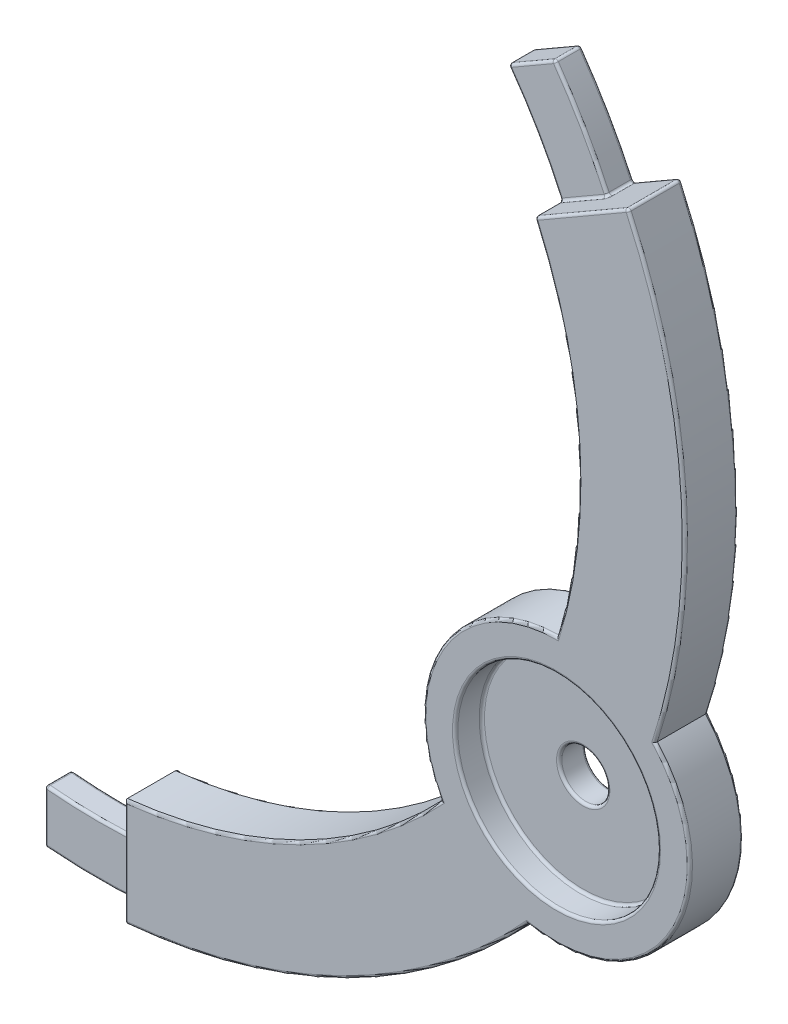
ISO-10303-21;
HEADER;
FILE_DESCRIPTION(('STEP AP214'),'2;1');
FILE_NAME('part.step','',(''),(''),'','','');
FILE_SCHEMA(('AUTOMOTIVE_DESIGN { 1 0 10303 214 1 1 1 1 }'));
ENDSEC;
DATA;
#1=APPLICATION_CONTEXT('core data for automotive mechanical design processes');
#2=APPLICATION_PROTOCOL_DEFINITION('international standard','automotive_design',2000,#1);
#3=PRODUCT_CONTEXT('',#1,'mechanical');
#4=PRODUCT('Part','Part','',(#3));
#5=PRODUCT_RELATED_PRODUCT_CATEGORY('part','',(#4));
#6=PRODUCT_DEFINITION_FORMATION('','',#4);
#7=PRODUCT_DEFINITION_CONTEXT('part definition',#1,'design');
#8=PRODUCT_DEFINITION('design','',#6,#7);
#9=PRODUCT_DEFINITION_SHAPE('','',#8);
#10=(LENGTH_UNIT() NAMED_UNIT(*) SI_UNIT(.MILLI.,.METRE.));
#11=(NAMED_UNIT(*) PLANE_ANGLE_UNIT() SI_UNIT($,.RADIAN.));
#12=(NAMED_UNIT(*) SI_UNIT($,.STERADIAN.) SOLID_ANGLE_UNIT());
#13=UNCERTAINTY_MEASURE_WITH_UNIT(LENGTH_MEASURE(1.E-05),#10,'distance_accuracy_value','');
#14=(GEOMETRIC_REPRESENTATION_CONTEXT(3) GLOBAL_UNCERTAINTY_ASSIGNED_CONTEXT((#13)) GLOBAL_UNIT_ASSIGNED_CONTEXT((#10,
#11,#12)) REPRESENTATION_CONTEXT('',''));
#15=CARTESIAN_POINT('',(0.,0.,0.));
#16=DIRECTION('',(0.,0.,1.));
#17=DIRECTION('',(1.,0.,0.));
#18=AXIS2_PLACEMENT_3D('',#15,#16,#17);
#19=CARTESIAN_POINT('',(90.9326673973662,-52.4999999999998,-5.));
#20=DIRECTION('',(0.,0.,1.));
#21=DIRECTION('',(1.,0.,0.));
#22=AXIS2_PLACEMENT_3D('',#19,#20,#21);
#23=PLANE('',#22);
#24=CARTESIAN_POINT('',(90.9326673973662,-52.4999999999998,-5.));
#25=DIRECTION('',(0.,0.,1.));
#26=DIRECTION('',(1.,0.,0.));
#27=AXIS2_PLACEMENT_3D('',#24,#25,#26);
#28=CIRCLE('',#27,5.00000000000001);
#29=CARTESIAN_POINT('',(95.9326673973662,-52.4999999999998,-5.));
#30=VERTEX_POINT('',#29);
#31=EDGE_CURVE('E960',#30,#30,#28,.T.);
#32=ORIENTED_EDGE('',*,*,#31,.T.);
#33=EDGE_LOOP('',(#32));
#34=FACE_BOUND('',#33,.T.);
#35=CARTESIAN_POINT('',(9.50000000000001,-104.067285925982,-5.));
#36=DIRECTION('',(0.,0.,1.));
#37=DIRECTION('',(1.,0.,0.));
#38=AXIS2_PLACEMENT_3D('',#35,#36,#37);
#39=CIRCLE('',#38,1.);
#40=CARTESIAN_POINT('',(10.5,-104.067285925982,-5.));
#41=VERTEX_POINT('',#40);
#42=CARTESIAN_POINT('',(9.5909090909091,-105.063145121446,-5.));
#43=VERTEX_POINT('',#42);
#44=EDGE_CURVE('E304',#41,#43,#39,.F.);
#45=ORIENTED_EDGE('',*,*,#44,.F.);
#46=DIRECTION('',(0.,-1.,0.));
#47=VECTOR('',#46,1.);
#48=CARTESIAN_POINT('',(10.5,-52.4999999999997,-5.));
#49=LINE('',#48,#47);
#50=CARTESIAN_POINT('',(10.5,-94.9210198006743,-5.));
#51=VERTEX_POINT('',#50);
#52=EDGE_CURVE('E991',#41,#51,#49,.F.);
#53=ORIENTED_EDGE('',*,*,#52,.T.);
#54=CARTESIAN_POINT('',(0.,0.,-5.));
#55=DIRECTION('',(0.,0.,1.));
#56=DIRECTION('',(1.,0.,0.));
#57=AXIS2_PLACEMENT_3D('',#54,#55,#56);
#58=CIRCLE('',#57,95.5);
#59=CARTESIAN_POINT('',(69.9022310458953,-65.0686414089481,-5.));
#60=VERTEX_POINT('',#59);
#61=EDGE_CURVE('E974',#51,#60,#58,.T.);
#62=ORIENTED_EDGE('',*,*,#61,.T.);
#63=CARTESIAN_POINT('',(90.9326673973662,-52.4999999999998,-5.));
#64=DIRECTION('',(0.,0.,1.));
#65=DIRECTION('',(1.,0.,0.));
#66=AXIS2_PLACEMENT_3D('',#63,#64,#65);
#67=CIRCLE('',#66,24.5);
#68=CARTESIAN_POINT('',(91.3022119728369,-28.0027871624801,-5.));
#69=VERTEX_POINT('',#68);
#70=EDGE_CURVE('E953',#60,#69,#67,.F.);
#71=ORIENTED_EDGE('',*,*,#70,.T.);
#72=CARTESIAN_POINT('',(0.,0.,-5.));
#73=DIRECTION('',(0.,0.,1.));
#74=DIRECTION('',(1.,0.,0.));
#75=AXIS2_PLACEMENT_3D('',#72,#73,#74);
#76=CIRCLE('',#75,95.5);
#77=CARTESIAN_POINT('',(77.5452003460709,55.740397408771,-5.));
#78=VERTEX_POINT('',#77);
#79=EDGE_CURVE('E968',#69,#78,#76,.T.);
#80=ORIENTED_EDGE('',*,*,#79,.T.);
#81=DIRECTION('',(-0.866025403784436,-0.500000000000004,0.));
#82=VECTOR('',#81,1.);
#83=CARTESIAN_POINT('',(40.7163336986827,34.4772413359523,-5.));
#84=LINE('',#83,#82);
#85=CARTESIAN_POINT('',(85.3749133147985,60.2608842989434,-5.));
#86=VERTEX_POINT('',#85);
#87=EDGE_CURVE('E970',#78,#86,#84,.F.);
#88=ORIENTED_EDGE('',*,*,#87,.T.);
#89=CARTESIAN_POINT('',(0.,0.,-5.));
#90=DIRECTION('',(0.,0.,1.));
#91=DIRECTION('',(1.,0.,0.));
#92=AXIS2_PLACEMENT_3D('',#89,#90,#91);
#93=CIRCLE('',#92,104.5);
#94=CARTESIAN_POINT('',(94.836974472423,43.8884753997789,-5.));
#95=VERTEX_POINT('',#94);
#96=EDGE_CURVE('E972',#86,#95,#93,.F.);
#97=ORIENTED_EDGE('',*,*,#96,.T.);
#98=CARTESIAN_POINT('',(95.7445053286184,44.3084608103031,-5.));
#99=DIRECTION('',(0.,0.,1.));
#100=DIRECTION('',(1.,0.,0.));
#101=AXIS2_PLACEMENT_3D('',#98,#99,#100);
#102=CIRCLE('',#101,1.);
#103=CARTESIAN_POINT('',(96.2445053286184,43.4424354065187,-5.));
#104=VERTEX_POINT('',#103);
#105=EDGE_CURVE('E976',#104,#95,#102,.F.);
#106=ORIENTED_EDGE('',*,*,#105,.F.);
#107=DIRECTION('',(-0.866025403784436,-0.500000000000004,0.));
#108=VECTOR('',#107,1.);
#109=CARTESIAN_POINT('',(50.7163336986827,17.1567332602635,-5.));
#110=LINE('',#109,#108);
#111=CARTESIAN_POINT('',(103.992088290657,47.9155045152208,-5.));
#112=VERTEX_POINT('',#111);
#113=EDGE_CURVE('E979',#104,#112,#110,.F.);
#114=ORIENTED_EDGE('',*,*,#113,.T.);
#115=CARTESIAN_POINT('',(0.,0.,-5.));
#116=DIRECTION('',(0.,0.,1.));
#117=DIRECTION('',(1.,0.,0.));
#118=AXIS2_PLACEMENT_3D('',#115,#116,#117);
#119=CIRCLE('',#118,114.5);
#120=CARTESIAN_POINT('',(108.785353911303,-35.7210970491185,-5.));
#121=VERTEX_POINT('',#120);
#122=EDGE_CURVE('E981',#112,#121,#119,.F.);
#123=ORIENTED_EDGE('',*,*,#122,.T.);
#124=CARTESIAN_POINT('',(90.9326673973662,-52.4999999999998,-5.));
#125=DIRECTION('',(0.,0.,1.));
#126=DIRECTION('',(1.,0.,0.));
#127=AXIS2_PLACEMENT_3D('',#124,#125,#126);
#128=CIRCLE('',#127,24.5);
#129=CARTESIAN_POINT('',(85.3280544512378,-76.3503315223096,-5.));
#130=VERTEX_POINT('',#129);
#131=EDGE_CURVE('E983',#121,#130,#128,.F.);
#132=ORIENTED_EDGE('',*,*,#131,.T.);
#133=CARTESIAN_POINT('',(0.,0.,-5.));
#134=DIRECTION('',(0.,0.,1.));
#135=DIRECTION('',(1.,0.,0.));
#136=AXIS2_PLACEMENT_3D('',#133,#134,#135);
#137=CIRCLE('',#136,114.5);
#138=CARTESIAN_POINT('',(-9.49999999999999,-114.105214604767,-5.));
#139=VERTEX_POINT('',#138);
#140=EDGE_CURVE('E985',#130,#139,#137,.F.);
#141=ORIENTED_EDGE('',*,*,#140,.T.);
#142=DIRECTION('',(0.,-1.,0.));
#143=VECTOR('',#142,1.);
#144=CARTESIAN_POINT('',(-9.50000000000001,-52.4999999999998,-5.));
#145=LINE('',#144,#143);
#146=CARTESIAN_POINT('',(-9.49999999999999,-105.07140429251,-5.));
#147=VERTEX_POINT('',#146);
#148=EDGE_CURVE('E987',#139,#147,#145,.F.);
#149=ORIENTED_EDGE('',*,*,#148,.T.);
#150=CARTESIAN_POINT('',(0.,0.,-5.));
#151=DIRECTION('',(0.,0.,1.));
#152=DIRECTION('',(1.,0.,0.));
#153=AXIS2_PLACEMENT_3D('',#150,#151,#152);
#154=CIRCLE('',#153,105.5);
#155=EDGE_CURVE('E989',#147,#43,#154,.T.);
#156=ORIENTED_EDGE('',*,*,#155,.T.);
#157=EDGE_LOOP('',(#45,#53,#62,#71,#80,#88,#97,#106,#114,#123,#132,#141,#149,#156));
#158=FACE_BOUND('',#157,.T.);
#159=ADVANCED_FACE('F31',(#34,#158),#23,.F.);
#160=CARTESIAN_POINT('',(95.5193349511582,43.6011083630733,5.));
#161=DIRECTION('',(0.500000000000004,-0.866025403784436,0.));
#162=DIRECTION('',(0.866025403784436,0.500000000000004,0.));
#163=AXIS2_PLACEMENT_3D('',#160,#161,#162);
#164=PLANE('',#163);
#165=CARTESIAN_POINT('',(95.9459084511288,43.8473906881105,-0.829621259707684));
#166=CARTESIAN_POINT('',(95.5009060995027,43.5904684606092,-0.649488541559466));
#167=CARTESIAN_POINT('',(95.267492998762,44.0821670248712,-0.664810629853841));
#168=CARTESIAN_POINT('',(95.9619980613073,43.8566800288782,-0.776770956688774));
#169=CARTESIAN_POINT('',(95.5074581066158,43.5942512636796,-0.625164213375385));
#170=CARTESIAN_POINT('',(95.2751895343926,44.0875643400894,-0.638385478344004));
#171=CARTESIAN_POINT('',(95.9741488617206,43.8636952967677,-0.722340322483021));
#172=CARTESIAN_POINT('',(95.5123755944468,43.5970903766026,-0.600407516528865));
#173=CARTESIAN_POINT('',(95.2810020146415,44.0916401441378,-0.611170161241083));
#174=CARTESIAN_POINT('',(95.9903979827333,43.8730767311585,-0.611939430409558));
#175=CARTESIAN_POINT('',(95.5189361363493,43.6008781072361,-0.550422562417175));
#176=CARTESIAN_POINT('',(95.2887750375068,44.0970905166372,-0.555969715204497));
#177=CARTESIAN_POINT('',(95.9945023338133,43.8754463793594,-0.555970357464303));
#178=CARTESIAN_POINT('',(95.5205756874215,43.6018247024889,-0.525216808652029));
#179=CARTESIAN_POINT('',(95.2907384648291,44.0984671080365,-0.52798517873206));
#180=CARTESIAN_POINT('',(95.9945083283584,43.8754498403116,-0.443937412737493));
#181=CARTESIAN_POINT('',(95.5205755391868,43.6018246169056,-0.474741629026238));
#182=CARTESIAN_POINT('',(95.2907413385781,44.0984691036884,-0.471968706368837));
#183=CARTESIAN_POINT('',(95.990396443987,43.8730758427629,-0.387873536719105));
#184=CARTESIAN_POINT('',(95.5189304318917,43.6008748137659,-0.449495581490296));
#185=CARTESIAN_POINT('',(95.2887743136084,44.0970899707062,-0.443936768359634));
#186=CARTESIAN_POINT('',(95.9740773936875,43.8636540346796,-0.277351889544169));
#187=CARTESIAN_POINT('',(95.5123518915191,43.5970766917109,-0.399450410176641));
#188=CARTESIAN_POINT('',(95.2809678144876,44.0916162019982,-0.388675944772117));
#189=CARTESIAN_POINT('',(95.9618717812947,43.856607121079,-0.222893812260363));
#190=CARTESIAN_POINT('',(95.5074250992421,43.5942322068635,-0.374673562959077));
#191=CARTESIAN_POINT('',(95.2751290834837,44.0875220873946,-0.361446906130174));
#192=CARTESIAN_POINT('',(95.9297287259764,43.8380493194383,-0.117151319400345));
#193=CARTESIAN_POINT('',(95.4943106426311,43.5866605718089,-0.326065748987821));
#194=CARTESIAN_POINT('',(95.2597534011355,44.0767393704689,-0.308575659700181));
#195=CARTESIAN_POINT('',(95.9097964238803,43.8265413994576,-0.0658648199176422));
#196=CARTESIAN_POINT('',(95.4861366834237,43.5819413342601,-0.302253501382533));
#197=CARTESIAN_POINT('',(95.2502189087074,44.0700524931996,-0.282932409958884));
#198=CARTESIAN_POINT('',(95.8627438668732,43.7993755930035,0.032195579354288));
#199=CARTESIAN_POINT('',(95.4665734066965,43.5706464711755,-0.256047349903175));
#200=CARTESIAN_POINT('',(95.2277124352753,44.0542653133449,-0.233902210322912));
#201=CARTESIAN_POINT('',(95.8356138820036,43.7837120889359,0.0789632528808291));
#202=CARTESIAN_POINT('',(95.4551958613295,43.5640776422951,-0.233669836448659));
#203=CARTESIAN_POINT('',(95.2147358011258,44.0451617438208,-0.21051837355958));
#204=CARTESIAN_POINT('',(95.7749244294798,43.7486730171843,0.166643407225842));
#205=CARTESIAN_POINT('',(95.4293333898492,43.5491459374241,-0.190906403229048));
#206=CARTESIAN_POINT('',(95.1857085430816,44.0247939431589,-0.166678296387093));
#207=CARTESIAN_POINT('',(95.7413578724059,43.7292933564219,0.207549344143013));
#208=CARTESIAN_POINT('',(95.4148643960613,43.5407922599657,-0.170530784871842));
#209=CARTESIAN_POINT('',(95.1696545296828,44.0135273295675,-0.14622532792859));
#210=CARTESIAN_POINT('',(95.6687735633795,43.6873867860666,0.282304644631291));
#211=CARTESIAN_POINT('',(95.3830267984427,43.5224108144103,-0.1323901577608));
#212=CARTESIAN_POINT('',(95.1349411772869,43.9891599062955,-0.108847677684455));
#213=CARTESIAN_POINT('',(95.6297556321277,43.6648597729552,0.316153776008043));
#214=CARTESIAN_POINT('',(95.3656788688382,43.5123949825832,-0.11462596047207));
#215=CARTESIAN_POINT('',(95.1162817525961,43.9760590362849,-0.0919231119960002));
#216=CARTESIAN_POINT('',(95.5471885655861,43.6171896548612,0.375993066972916));
#217=CARTESIAN_POINT('',(95.3283024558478,43.4908157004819,-0.0822328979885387));
#218=CARTESIAN_POINT('',(95.0767982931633,43.9483301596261,-0.0620034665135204));
#219=CARTESIAN_POINT('',(95.5036197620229,43.5920351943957,0.401947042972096));
#220=CARTESIAN_POINT('',(95.3082820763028,43.4792569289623,-0.0676111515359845));
#221=CARTESIAN_POINT('',(95.055964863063,43.9336955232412,-0.0490264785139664));
#222=CARTESIAN_POINT('',(95.4133958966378,43.5399444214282,0.445041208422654));
#223=CARTESIAN_POINT('',(95.2660735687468,43.4548878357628,-0.0421994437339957));
#224=CARTESIAN_POINT('',(95.012824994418,43.9033828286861,-0.0274793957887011));
#225=CARTESIAN_POINT('',(95.3667449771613,43.5130105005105,0.462192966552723));
#226=CARTESIAN_POINT('',(95.2439056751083,43.4420891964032,-0.0313901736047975));
#227=CARTESIAN_POINT('',(94.9905205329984,43.8877061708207,-0.0189035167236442));
#228=CARTESIAN_POINT('',(95.2714152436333,43.4579718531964,0.487316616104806));
#229=CARTESIAN_POINT('',(95.1978229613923,43.4154833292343,-0.0140505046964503));
#230=CARTESIAN_POINT('',(94.9449450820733,43.8556639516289,-0.00634169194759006));
#231=CARTESIAN_POINT('',(95.2227286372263,43.4298626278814,0.495249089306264));
#232=CARTESIAN_POINT('',(95.1739129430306,43.4016788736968,-0.00751790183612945));
#233=CARTESIAN_POINT('',(94.9216703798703,43.8392957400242,-0.00237545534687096));
#234=CARTESIAN_POINT('',(95.1248830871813,43.3733714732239,0.501587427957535));
#235=CARTESIAN_POINT('',(95.125086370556,43.373488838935,0.000788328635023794));
#236=CARTESIAN_POINT('',(94.8748983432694,43.8063927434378,0.00079371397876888));
#237=CARTESIAN_POINT('',(95.0757240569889,43.3449894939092,0.499991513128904));
#238=CARTESIAN_POINT('',(95.1001753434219,43.3591064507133,0.00258529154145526));
#239=CARTESIAN_POINT('',(94.8514009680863,43.789857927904,-4.24343553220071E-06));
#240=CARTESIAN_POINT('',(94.9782652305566,43.2887216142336,0.487289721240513));
#241=CARTESIAN_POINT('',(95.0500636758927,43.3301744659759,0.00113776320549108));
#242=CARTESIAN_POINT('',(94.8048200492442,43.757069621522,-0.00635513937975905));
#243=CARTESIAN_POINT('',(94.9299667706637,43.260836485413,0.476170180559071));
#244=CARTESIAN_POINT('',(95.0248608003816,43.3156235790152,-0.00208865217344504));
#245=CARTESIAN_POINT('',(94.7817371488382,43.7408165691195,-0.0119149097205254));
#246=CARTESIAN_POINT('',(94.8356255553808,43.2063685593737,0.444753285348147));
#247=CARTESIAN_POINT('',(94.9750175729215,43.2868465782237,-0.013650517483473));
#248=CARTESIAN_POINT('',(94.7366522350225,43.7090625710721,-0.0276233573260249));
#249=CARTESIAN_POINT('',(94.7895845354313,43.1797867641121,0.42444898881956));
#250=CARTESIAN_POINT('',(94.9503684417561,43.2726153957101,-0.0219667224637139));
#251=CARTESIAN_POINT('',(94.7146510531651,43.6935622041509,-0.03777550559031));
#252=CARTESIAN_POINT('',(94.7453722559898,43.1542607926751,0.399736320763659));
#253=CARTESIAN_POINT('',(94.9263538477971,43.2587505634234,-0.0328948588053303));
#254=CARTESIAN_POINT('',(94.6935251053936,43.6786741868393,-0.050131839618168));
#255=(BOUNDED_SURFACE() B_SPLINE_SURFACE(3,2,((#165,#166,#167),(#168,#169,#170),(#171,#172,
#173),(#174,#175,#176),(#177,#178,#179),(#180,#181,#182),(#183,#184,#185),(#186,#187,#188),
(#189,#190,#191),(#192,#193,#194),(#195,#196,#197),(#198,#199,#200),(#201,#202,#203),(#204,#205,
#206),(#207,#208,#209),(#210,#211,#212),(#213,#214,#215),(#216,#217,#218),(#219,#220,#221),
(#222,#223,#224),(#225,#226,#227),(#228,#229,#230),(#231,#232,#233),(#234,#235,#236),(#237,#238,
#239),(#240,#241,#242),(#243,#244,#245),(#246,#247,#248),(#249,#250,#251),(#252,#253,#254)),
.UNSPECIFIED.,.F.,.F.,.F.) B_SPLINE_SURFACE_WITH_KNOTS((4,2,2,2,2,2,2,2,2,2,2,2,2,2,4),(3,3),
(0.,0.167840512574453,0.335555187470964,0.503546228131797,0.67150503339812,0.839352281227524,
1.00742759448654,1.17568910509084,1.34395615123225,1.51298313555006,1.68178739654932,
1.85131077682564,2.02086583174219,2.19066455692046,2.36059183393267),(0.,1.),
.UNSPECIFIED.) GEOMETRIC_REPRESENTATION_ITEM() RATIONAL_B_SPLINE_SURFACE(((1.,0.676365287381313,
1.),(1.,0.675754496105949,1.),(1.,0.675292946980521,1.),(1.,0.674675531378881,1.),(1.,
0.674519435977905,1.),(1.,0.674519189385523,1.),(1.,0.674675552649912,1.),(1.,0.67529570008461,
1.),(1.,0.675759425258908,1.),(1.,0.676979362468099,1.),(1.,0.67773538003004,1.),(1.,
0.679517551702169,1.),(1.,0.680544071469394,1.),(1.,0.682836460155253,1.),(1.,0.684102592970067,
1.),(1.,0.686835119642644,1.),(1.,0.688301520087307,1.),(1.,0.691397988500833,1.),(1.,
0.693028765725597,1.),(1.,0.696398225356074,1.),(1.,0.698136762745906,1.),(1.,0.70168127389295,
1.),(1.,0.703487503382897,1.),(1.,0.707109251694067,1.),(1.,0.708924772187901,1.),(1.,
0.712516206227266,1.),(1.,0.714292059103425,1.),(1.,0.717753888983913,1.),(1.,0.719439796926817,
1.),(1.,0.72105554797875,1.))) REPRESENTATION_ITEM('') SURFACE());
#256=CARTESIAN_POINT('',(94.7453722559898,43.1542607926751,0.399736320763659));
#257=CARTESIAN_POINT('',(94.7895845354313,43.1797867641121,0.42444898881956));
#258=CARTESIAN_POINT('',(94.8356255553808,43.2063685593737,0.444753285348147));
#259=CARTESIAN_POINT('',(94.9299667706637,43.260836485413,0.476170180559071));
#260=CARTESIAN_POINT('',(94.9782652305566,43.2887216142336,0.487289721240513));
#261=CARTESIAN_POINT('',(95.0757240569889,43.3449894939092,0.499991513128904));
#262=CARTESIAN_POINT('',(95.1248830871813,43.3733714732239,0.501587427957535));
#263=CARTESIAN_POINT('',(95.2227286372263,43.4298626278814,0.495249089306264));
#264=CARTESIAN_POINT('',(95.2714152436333,43.4579718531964,0.487316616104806));
#265=CARTESIAN_POINT('',(95.3667449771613,43.5130105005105,0.462192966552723));
#266=CARTESIAN_POINT('',(95.4133958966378,43.5399444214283,0.445041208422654));
#267=CARTESIAN_POINT('',(95.5036197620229,43.5920351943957,0.401947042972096));
#268=CARTESIAN_POINT('',(95.5471885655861,43.6171896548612,0.375993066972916));
#269=CARTESIAN_POINT('',(95.6297556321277,43.6648597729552,0.316153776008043));
#270=CARTESIAN_POINT('',(95.6687735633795,43.6873867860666,0.282304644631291));
#271=CARTESIAN_POINT('',(95.7413578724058,43.7292933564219,0.207549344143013));
#272=CARTESIAN_POINT('',(95.7749244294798,43.7486730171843,0.166643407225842));
#273=CARTESIAN_POINT('',(95.8356138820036,43.7837120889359,0.078963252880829));
#274=CARTESIAN_POINT('',(95.8627438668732,43.7993755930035,0.032195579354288));
#275=CARTESIAN_POINT('',(95.9097964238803,43.8265413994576,-0.0658648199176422));
#276=CARTESIAN_POINT('',(95.9297287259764,43.8380493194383,-0.117151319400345));
#277=CARTESIAN_POINT('',(95.9618717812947,43.856607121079,-0.222893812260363));
#278=CARTESIAN_POINT('',(95.9740773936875,43.8636540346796,-0.277351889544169));
#279=CARTESIAN_POINT('',(95.9903964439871,43.8730758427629,-0.387873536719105));
#280=CARTESIAN_POINT('',(95.9945083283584,43.8754498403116,-0.443937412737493));
#281=CARTESIAN_POINT('',(95.9945023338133,43.8754463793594,-0.555970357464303));
#282=CARTESIAN_POINT('',(95.9903979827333,43.8730767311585,-0.611939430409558));
#283=CARTESIAN_POINT('',(95.9741488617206,43.8636952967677,-0.722340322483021));
#284=CARTESIAN_POINT('',(95.9619980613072,43.8566800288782,-0.776770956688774));
#285=CARTESIAN_POINT('',(95.9459084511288,43.8473906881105,-0.829621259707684));
#286=B_SPLINE_CURVE_WITH_KNOTS('',3,(#256,#257,#258,#259,#260,#261,#262,#263,#264,#265,#266,
#267,#268,#269,#270,#271,#272,#273,#274,#275,#276,#277,#278,#279,#280,#281,#282,#283,#284,#285),
.UNSPECIFIED.,.F.,.F.,(4,2,2,2,2,2,2,2,2,2,2,2,2,2,4),(0.,0.169927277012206,0.339726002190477,
0.509281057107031,0.678804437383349,0.847608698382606,1.01663568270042,1.18490272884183,
1.35316423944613,1.52123955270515,1.68908680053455,1.85704560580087,2.02503664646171,
2.19275132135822,2.36059183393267),.UNSPECIFIED.);
#287=CARTESIAN_POINT('',(95.1249133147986,43.3733889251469,0.5));
#288=VERTEX_POINT('',#287);
#289=CARTESIAN_POINT('',(95.9945053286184,43.8754481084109,-0.5));
#290=VERTEX_POINT('',#289);
#291=EDGE_CURVE('E770',#288,#290,#286,.T.);
#292=ORIENTED_EDGE('',*,*,#291,.F.);
#293=DIRECTION('',(0.866025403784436,0.500000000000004,0.));
#294=VECTOR('',#293,1.);
#295=CARTESIAN_POINT('',(95.5193349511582,43.6011083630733,0.5));
#296=LINE('',#295,#294);
#297=CARTESIAN_POINT('',(87.2040145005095,38.8002558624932,0.5));
#298=VERTEX_POINT('',#297);
#299=EDGE_CURVE('E778',#288,#298,#296,.F.);
#300=ORIENTED_EDGE('',*,*,#299,.T.);
#301=DIRECTION('',(0.,0.,-1.));
#302=VECTOR('',#301,1.);
#303=CARTESIAN_POINT('',(87.2040145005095,38.8002558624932,5.));
#304=LINE('',#303,#302);
#305=CARTESIAN_POINT('',(87.2040145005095,38.8002558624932,4.5));
#306=VERTEX_POINT('',#305);
#307=EDGE_CURVE('E828',#298,#306,#304,.F.);
#308=ORIENTED_EDGE('',*,*,#307,.T.);
#309=DIRECTION('',(-0.866025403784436,-0.500000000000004,0.));
#310=VECTOR('',#309,1.);
#311=CARTESIAN_POINT('',(104.215674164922,48.6219421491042,4.5));
#312=LINE('',#311,#310);
#313=CARTESIAN_POINT('',(103.742088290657,48.348517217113,4.5));
#314=VERTEX_POINT('',#313);
#315=EDGE_CURVE('E881',#306,#314,#312,.F.);
#316=ORIENTED_EDGE('',*,*,#315,.T.);
#317=DIRECTION('',(0.,0.,-1.));
#318=VECTOR('',#317,1.);
#319=CARTESIAN_POINT('',(103.742088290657,48.348517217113,5.));
#320=LINE('',#319,#318);
#321=CARTESIAN_POINT('',(103.742088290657,48.348517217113,-4.5));
#322=VERTEX_POINT('',#321);
#323=EDGE_CURVE('E884',#314,#322,#320,.T.);
#324=ORIENTED_EDGE('',*,*,#323,.T.);
#325=DIRECTION('',(-0.866025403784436,-0.500000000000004,0.));
#326=VECTOR('',#325,1.);
#327=CARTESIAN_POINT('',(95.5193349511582,43.6011083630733,-4.5));
#328=LINE('',#327,#326);
#329=CARTESIAN_POINT('',(95.9945053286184,43.8754481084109,-4.5));
#330=VERTEX_POINT('',#329);
#331=EDGE_CURVE('E887',#322,#330,#328,.T.);
#332=ORIENTED_EDGE('',*,*,#331,.T.);
#333=DIRECTION('',(0.,0.,1.));
#334=VECTOR('',#333,1.);
#335=CARTESIAN_POINT('',(95.9945053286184,43.8754481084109,0.));
#336=LINE('',#335,#334);
#337=EDGE_CURVE('E888',#330,#290,#336,.T.);
#338=ORIENTED_EDGE('',*,*,#337,.T.);
#339=EDGE_LOOP('',(#292,#300,#308,#316,#324,#332,#338));
#340=FACE_BOUND('',#339,.T.);
#341=ADVANCED_FACE('F728',(#340),#164,.F.);
#342=CARTESIAN_POINT('',(0.,0.,5.));
#343=DIRECTION('',(0.,0.,-1.));
#344=DIRECTION('',(-1.,0.,0.));
#345=AXIS2_PLACEMENT_3D('',#342,#343,#344);
#346=CYLINDRICAL_SURFACE('',#345,105.);
#347=DIRECTION('',(0.,0.,-1.));
#348=VECTOR('',#347,1.);
#349=CARTESIAN_POINT('',(95.2907399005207,44.098468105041,5.));
#350=LINE('',#349,#348);
#351=CARTESIAN_POINT('',(95.2907399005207,44.098468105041,-0.5));
#352=VERTEX_POINT('',#351);
#353=CARTESIAN_POINT('',(95.2907399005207,44.098468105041,-4.5));
#354=VERTEX_POINT('',#353);
#355=EDGE_CURVE('E874',#352,#354,#350,.T.);
#356=ORIENTED_EDGE('',*,*,#355,.T.);
#357=CARTESIAN_POINT('',(0.,0.,-4.5));
#358=DIRECTION('',(0.,0.,1.));
#359=DIRECTION('',(1.,0.,0.));
#360=AXIS2_PLACEMENT_3D('',#357,#358,#359);
#361=CIRCLE('',#360,105.);
#362=CARTESIAN_POINT('',(85.7834057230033,60.5492138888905,-4.5));
#363=VERTEX_POINT('',#362);
#364=EDGE_CURVE('E879',#354,#363,#361,.T.);
#365=ORIENTED_EDGE('',*,*,#364,.T.);
#366=DIRECTION('',(0.,0.,-1.));
#367=VECTOR('',#366,1.);
#368=CARTESIAN_POINT('',(85.7834057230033,60.5492138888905,5.));
#369=LINE('',#368,#367);
#370=CARTESIAN_POINT('',(85.7834057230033,60.5492138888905,-0.5));
#371=VERTEX_POINT('',#370);
#372=EDGE_CURVE('E876',#363,#371,#369,.F.);
#373=ORIENTED_EDGE('',*,*,#372,.T.);
#374=CARTESIAN_POINT('',(0.,0.,-0.5));
#375=DIRECTION('',(0.,0.,1.));
#376=DIRECTION('',(1.,0.,0.));
#377=AXIS2_PLACEMENT_3D('',#374,#375,#376);
#378=CIRCLE('',#377,105.);
#379=EDGE_CURVE('E872',#371,#352,#378,.F.);
#380=ORIENTED_EDGE('',*,*,#379,.T.);
#381=EDGE_LOOP('',(#356,#365,#373,#380));
#382=FACE_BOUND('',#381,.T.);
#383=ADVANCED_FACE('F734',(#382),#346,.T.);
#384=CARTESIAN_POINT('',(76.8153408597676,55.8963631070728,5.));
#385=DIRECTION('',(0.500000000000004,-0.866025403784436,0.));
#386=DIRECTION('',(0.866025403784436,0.500000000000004,0.));
#387=AXIS2_PLACEMENT_3D('',#384,#385,#386);
#388=PLANE('',#387);
#389=DIRECTION('',(0.,0.,-1.));
#390=VECTOR('',#389,1.);
#391=CARTESIAN_POINT('',(77.295200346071,56.1734101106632,5.));
#392=LINE('',#391,#390);
#393=CARTESIAN_POINT('',(77.295200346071,56.1734101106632,-4.5));
#394=VERTEX_POINT('',#393);
#395=CARTESIAN_POINT('',(77.295200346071,56.1734101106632,-0.5));
#396=VERTEX_POINT('',#395);
#397=EDGE_CURVE('E867',#394,#396,#392,.F.);
#398=ORIENTED_EDGE('',*,*,#397,.T.);
#399=DIRECTION('',(-0.866025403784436,-0.500000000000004,0.));
#400=VECTOR('',#399,1.);
#401=CARTESIAN_POINT('',(85.5193349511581,60.921616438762,-0.5));
#402=LINE('',#401,#400);
#403=CARTESIAN_POINT('',(85.1249133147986,60.6938970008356,-0.5));
#404=VERTEX_POINT('',#403);
#405=EDGE_CURVE('E870',#396,#404,#402,.F.);
#406=ORIENTED_EDGE('',*,*,#405,.T.);
#407=DIRECTION('',(0.,0.,-1.));
#408=VECTOR('',#407,1.);
#409=CARTESIAN_POINT('',(85.1249133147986,60.6938970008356,5.));
#410=LINE('',#409,#408);
#411=CARTESIAN_POINT('',(85.1249133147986,60.6938970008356,-4.5));
#412=VERTEX_POINT('',#411);
#413=EDGE_CURVE('E865',#404,#412,#410,.T.);
#414=ORIENTED_EDGE('',*,*,#413,.T.);
#415=DIRECTION('',(-0.866025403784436,-0.500000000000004,0.));
#416=VECTOR('',#415,1.);
#417=CARTESIAN_POINT('',(76.8153408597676,55.8963631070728,-4.5));
#418=LINE('',#417,#416);
#419=EDGE_CURVE('E863',#412,#394,#418,.T.);
#420=ORIENTED_EDGE('',*,*,#419,.T.);
#421=EDGE_LOOP('',(#398,#406,#414,#420));
#422=FACE_BOUND('',#421,.T.);
#423=ADVANCED_FACE('F748',(#422),#388,.F.);
#424=CARTESIAN_POINT('',(0.,0.,5.));
#425=DIRECTION('',(0.,0.,-1.));
#426=DIRECTION('',(-1.,0.,0.));
#427=AXIS2_PLACEMENT_3D('',#424,#425,#426);
#428=CYLINDRICAL_SURFACE('',#427,105.);
#429=DIRECTION('',(0.,0.,-1.));
#430=VECTOR('',#429,1.);
#431=CARTESIAN_POINT('',(-9.45497630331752,-104.573435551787,5.));
#432=LINE('',#431,#430);
#433=CARTESIAN_POINT('',(-9.45497630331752,-104.573435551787,-4.5));
#434=VERTEX_POINT('',#433);
#435=CARTESIAN_POINT('',(-9.45497630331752,-104.573435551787,-0.5));
#436=VERTEX_POINT('',#435);
#437=EDGE_CURVE('E317',#434,#436,#432,.F.);
#438=ORIENTED_EDGE('',*,*,#437,.T.);
#439=CARTESIAN_POINT('',(0.,0.,-0.5));
#440=DIRECTION('',(0.,0.,1.));
#441=DIRECTION('',(1.,0.,0.));
#442=AXIS2_PLACEMENT_3D('',#439,#440,#441);
#443=CIRCLE('',#442,105.);
#444=CARTESIAN_POINT('',(9.54545454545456,-104.565215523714,-0.5));
#445=VERTEX_POINT('',#444);
#446=EDGE_CURVE('E322',#436,#445,#443,.T.);
#447=ORIENTED_EDGE('',*,*,#446,.T.);
#448=DIRECTION('',(0.,0.,-1.));
#449=VECTOR('',#448,1.);
#450=CARTESIAN_POINT('',(9.54545454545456,-104.565215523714,5.));
#451=LINE('',#450,#449);
#452=CARTESIAN_POINT('',(9.54545454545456,-104.565215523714,-4.5));
#453=VERTEX_POINT('',#452);
#454=EDGE_CURVE('E292',#445,#453,#451,.T.);
#455=ORIENTED_EDGE('',*,*,#454,.T.);
#456=CARTESIAN_POINT('',(0.,0.,-4.5));
#457=DIRECTION('',(0.,0.,1.));
#458=DIRECTION('',(1.,0.,0.));
#459=AXIS2_PLACEMENT_3D('',#456,#457,#458);
#460=CIRCLE('',#459,105.);
#461=EDGE_CURVE('E311',#453,#434,#460,.F.);
#462=ORIENTED_EDGE('',*,*,#461,.T.);
#463=EDGE_LOOP('',(#438,#447,#455,#462));
#464=FACE_BOUND('',#463,.T.);
#465=ADVANCED_FACE('F320',(#464),#428,.F.);
#466=CARTESIAN_POINT('',(-9.99999999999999,-104.522724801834,5.));
#467=DIRECTION('',(1.,0.,0.));
#468=DIRECTION('',(0.,1.,0.));
#469=AXIS2_PLACEMENT_3D('',#466,#467,#468);
#470=PLANE('',#469);
#471=DIRECTION('',(0.,0.,-1.));
#472=VECTOR('',#471,1.);
#473=CARTESIAN_POINT('',(-9.99999999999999,-114.105214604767,5.));
#474=LINE('',#473,#472);
#475=CARTESIAN_POINT('',(-9.99999999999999,-114.105214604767,-4.5));
#476=VERTEX_POINT('',#475);
#477=CARTESIAN_POINT('',(-9.99999999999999,-114.105214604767,-0.5));
#478=VERTEX_POINT('',#477);
#479=EDGE_CURVE('E849',#476,#478,#474,.F.);
#480=ORIENTED_EDGE('',*,*,#479,.T.);
#481=DIRECTION('',(0.,-1.,0.));
#482=VECTOR('',#481,1.);
#483=CARTESIAN_POINT('',(-9.99999999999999,-104.522724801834,-0.5));
#484=LINE('',#483,#482);
#485=CARTESIAN_POINT('',(-9.99999999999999,-105.07140429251,-0.5));
#486=VERTEX_POINT('',#485);
#487=EDGE_CURVE('E852',#478,#486,#484,.F.);
#488=ORIENTED_EDGE('',*,*,#487,.T.);
#489=DIRECTION('',(0.,0.,-1.));
#490=VECTOR('',#489,1.);
#491=CARTESIAN_POINT('',(-9.99999999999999,-105.07140429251,5.));
#492=LINE('',#491,#490);
#493=CARTESIAN_POINT('',(-9.99999999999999,-105.07140429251,-4.5));
#494=VERTEX_POINT('',#493);
#495=EDGE_CURVE('E847',#486,#494,#492,.T.);
#496=ORIENTED_EDGE('',*,*,#495,.T.);
#497=DIRECTION('',(0.,-1.,0.));
#498=VECTOR('',#497,1.);
#499=CARTESIAN_POINT('',(-9.99999999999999,-104.522724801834,-4.5));
#500=LINE('',#499,#498);
#501=EDGE_CURVE('E843',#494,#476,#500,.T.);
#502=ORIENTED_EDGE('',*,*,#501,.T.);
#503=EDGE_LOOP('',(#480,#488,#496,#502));
#504=FACE_BOUND('',#503,.T.);
#505=ADVANCED_FACE('F793',(#504),#470,.F.);
#506=CARTESIAN_POINT('',(90.9326673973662,-52.4999999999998,5.));
#507=DIRECTION('',(0.,0.,1.));
#508=DIRECTION('',(1.,0.,0.));
#509=AXIS2_PLACEMENT_3D('',#506,#507,#508);
#510=PLANE('',#509);
#511=CARTESIAN_POINT('',(90.9326673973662,-52.4999999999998,5.));
#512=DIRECTION('',(0.,0.,1.));
#513=DIRECTION('',(1.,0.,0.));
#514=AXIS2_PLACEMENT_3D('',#511,#512,#513);
#515=CIRCLE('',#514,24.5);
#516=CARTESIAN_POINT('',(85.3280544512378,-76.3503315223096,5.));
#517=VERTEX_POINT('',#516);
#518=CARTESIAN_POINT('',(108.785353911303,-35.7210970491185,5.));
#519=VERTEX_POINT('',#518);
#520=EDGE_CURVE('E40',#517,#519,#515,.T.);
#521=ORIENTED_EDGE('',*,*,#520,.T.);
#522=CARTESIAN_POINT('',(0.,0.,5.));
#523=DIRECTION('',(0.,0.,1.));
#524=DIRECTION('',(1.,0.,0.));
#525=AXIS2_PLACEMENT_3D('',#522,#523,#524);
#526=CIRCLE('',#525,114.5);
#527=CARTESIAN_POINT('',(103.992088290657,47.9155045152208,5.));
#528=VERTEX_POINT('',#527);
#529=EDGE_CURVE('E11',#519,#528,#526,.T.);
#530=ORIENTED_EDGE('',*,*,#529,.T.);
#531=DIRECTION('',(-0.866025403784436,-0.500000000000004,0.));
#532=VECTOR('',#531,1.);
#533=CARTESIAN_POINT('',(87.0653408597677,38.1428423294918,5.));
#534=LINE('',#533,#532);
#535=CARTESIAN_POINT('',(87.4540145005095,38.367243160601,5.));
#536=VERTEX_POINT('',#535);
#537=EDGE_CURVE('E1021',#528,#536,#534,.T.);
#538=ORIENTED_EDGE('',*,*,#537,.T.);
#539=CARTESIAN_POINT('',(0.,0.,5.));
#540=DIRECTION('',(0.,0.,1.));
#541=DIRECTION('',(1.,0.,0.));
#542=AXIS2_PLACEMENT_3D('',#539,#540,#541);
#543=CIRCLE('',#542,95.5);
#544=CARTESIAN_POINT('',(91.3022119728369,-28.0027871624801,5.));
#545=VERTEX_POINT('',#544);
#546=EDGE_CURVE('E1023',#536,#545,#543,.F.);
#547=ORIENTED_EDGE('',*,*,#546,.T.);
#548=CARTESIAN_POINT('',(90.9326673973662,-52.4999999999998,5.));
#549=DIRECTION('',(0.,0.,1.));
#550=DIRECTION('',(1.,0.,0.));
#551=AXIS2_PLACEMENT_3D('',#548,#549,#550);
#552=CIRCLE('',#551,24.5);
#553=CARTESIAN_POINT('',(69.9022310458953,-65.0686414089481,5.));
#554=VERTEX_POINT('',#553);
#555=EDGE_CURVE('E1025',#545,#554,#552,.T.);
#556=ORIENTED_EDGE('',*,*,#555,.T.);
#557=CARTESIAN_POINT('',(0.,0.,5.));
#558=DIRECTION('',(0.,0.,1.));
#559=DIRECTION('',(1.,0.,0.));
#560=AXIS2_PLACEMENT_3D('',#557,#558,#559);
#561=CIRCLE('',#560,95.5);
#562=CARTESIAN_POINT('',(10.5,-94.9210198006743,5.));
#563=VERTEX_POINT('',#562);
#564=EDGE_CURVE('E1027',#554,#563,#561,.F.);
#565=ORIENTED_EDGE('',*,*,#564,.T.);
#566=DIRECTION('',(0.,-1.,0.));
#567=VECTOR('',#566,1.);
#568=CARTESIAN_POINT('',(10.5,-114.564392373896,5.));
#569=LINE('',#568,#567);
#570=CARTESIAN_POINT('',(10.5,-114.017542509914,5.));
#571=VERTEX_POINT('',#570);
#572=EDGE_CURVE('E1029',#563,#571,#569,.T.);
#573=ORIENTED_EDGE('',*,*,#572,.T.);
#574=CARTESIAN_POINT('',(0.,0.,5.));
#575=DIRECTION('',(0.,0.,1.));
#576=DIRECTION('',(1.,0.,0.));
#577=AXIS2_PLACEMENT_3D('',#574,#575,#576);
#578=CIRCLE('',#577,114.5);
#579=EDGE_CURVE('E51',#571,#517,#578,.T.);
#580=ORIENTED_EDGE('',*,*,#579,.T.);
#581=EDGE_LOOP('',(#521,#530,#538,#547,#556,#565,#573,#580));
#582=FACE_BOUND('',#581,.T.);
#583=CARTESIAN_POINT('',(90.9326673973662,-52.4999999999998,5.));
#584=DIRECTION('',(0.,0.,1.));
#585=DIRECTION('',(1.,0.,0.));
#586=AXIS2_PLACEMENT_3D('',#583,#584,#585);
#587=CIRCLE('',#586,19.5);
#588=CARTESIAN_POINT('',(110.432667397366,-52.4999999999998,5.));
#589=VERTEX_POINT('',#588);
#590=EDGE_CURVE('E1018',#589,#589,#587,.F.);
#591=ORIENTED_EDGE('',*,*,#590,.T.);
#592=EDGE_LOOP('',(#591));
#593=FACE_BOUND('',#592,.T.);
#594=ADVANCED_FACE('F739',(#582,#593),#510,.T.);
#595=CARTESIAN_POINT('',(90.9326673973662,-52.4999999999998,5.));
#596=DIRECTION('',(0.,0.,-1.));
#597=DIRECTION('',(-1.,0.,0.));
#598=AXIS2_PLACEMENT_3D('',#595,#596,#597);
#599=CYLINDRICAL_SURFACE('',#598,25.);
#600=DIRECTION('',(0.,0.,-1.));
#601=VECTOR('',#600,1.);
#602=CARTESIAN_POINT('',(90.9326673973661,-27.4999999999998,5.));
#603=LINE('',#602,#601);
#604=CARTESIAN_POINT('',(90.9326673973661,-27.4999999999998,4.5));
#605=VERTEX_POINT('',#604);
#606=CARTESIAN_POINT('',(90.9326673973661,-27.4999999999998,-4.5));
#607=VERTEX_POINT('',#606);
#608=EDGE_CURVE('E925',#605,#607,#603,.T.);
#609=ORIENTED_EDGE('',*,*,#608,.T.);
#610=CARTESIAN_POINT('',(90.9326673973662,-52.4999999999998,-4.5));
#611=DIRECTION('',(0.,0.,1.));
#612=DIRECTION('',(1.,0.,0.));
#613=AXIS2_PLACEMENT_3D('',#610,#611,#612);
#614=CIRCLE('',#613,25.);
#615=CARTESIAN_POINT('',(69.2820323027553,-64.9999999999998,-4.5));
#616=VERTEX_POINT('',#615);
#617=EDGE_CURVE('E929',#607,#616,#614,.T.);
#618=ORIENTED_EDGE('',*,*,#617,.T.);
#619=DIRECTION('',(0.,0.,-1.));
#620=VECTOR('',#619,1.);
#621=CARTESIAN_POINT('',(69.2820323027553,-64.9999999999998,5.));
#622=LINE('',#621,#620);
#623=CARTESIAN_POINT('',(69.2820323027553,-64.9999999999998,4.5));
#624=VERTEX_POINT('',#623);
#625=EDGE_CURVE('E318',#624,#616,#622,.T.);
#626=ORIENTED_EDGE('',*,*,#625,.F.);
#627=CARTESIAN_POINT('',(90.9326673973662,-52.4999999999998,4.5));
#628=DIRECTION('',(0.,0.,1.));
#629=DIRECTION('',(1.,0.,0.));
#630=AXIS2_PLACEMENT_3D('',#627,#628,#629);
#631=CIRCLE('',#630,25.);
#632=EDGE_CURVE('E932',#624,#605,#631,.F.);
#633=ORIENTED_EDGE('',*,*,#632,.T.);
#634=EDGE_LOOP('',(#609,#618,#626,#633));
#635=FACE_BOUND('',#634,.T.);
#636=ADVANCED_FACE('F927',(#635),#599,.T.);
#637=CARTESIAN_POINT('',(0.,0.,5.));
#638=DIRECTION('',(0.,0.,-1.));
#639=DIRECTION('',(-1.,0.,0.));
#640=AXIS2_PLACEMENT_3D('',#637,#638,#639);
#641=CYLINDRICAL_SURFACE('',#640,95.);
#642=ORIENTED_EDGE('',*,*,#625,.T.);
#643=CARTESIAN_POINT('',(0.,0.,-4.5));
#644=DIRECTION('',(0.,0.,1.));
#645=DIRECTION('',(1.,0.,0.));
#646=AXIS2_PLACEMENT_3D('',#643,#644,#645);
#647=CIRCLE('',#646,95.);
#648=CARTESIAN_POINT('',(10.,-94.4722181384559,-4.5));
#649=VERTEX_POINT('',#648);
#650=EDGE_CURVE('E949',#616,#649,#647,.F.);
#651=ORIENTED_EDGE('',*,*,#650,.T.);
#652=DIRECTION('',(0.,0.,-1.));
#653=VECTOR('',#652,1.);
#654=CARTESIAN_POINT('',(10.,-94.4722181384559,5.));
#655=LINE('',#654,#653);
#656=CARTESIAN_POINT('',(10.,-94.4722181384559,4.5));
#657=VERTEX_POINT('',#656);
#658=EDGE_CURVE('E942',#657,#649,#655,.T.);
#659=ORIENTED_EDGE('',*,*,#658,.F.);
#660=CARTESIAN_POINT('',(0.,0.,4.5));
#661=DIRECTION('',(0.,0.,1.));
#662=DIRECTION('',(1.,0.,0.));
#663=AXIS2_PLACEMENT_3D('',#660,#661,#662);
#664=CIRCLE('',#663,95.);
#665=EDGE_CURVE('E951',#657,#624,#664,.T.);
#666=ORIENTED_EDGE('',*,*,#665,.T.);
#667=EDGE_LOOP('',(#642,#651,#659,#666));
#668=FACE_BOUND('',#667,.T.);
#669=ADVANCED_FACE('F353',(#668),#641,.F.);
#670=CARTESIAN_POINT('',(10.,-94.4722181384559,5.));
#671=DIRECTION('',(1.,0.,0.));
#672=DIRECTION('',(0.,1.,0.));
#673=AXIS2_PLACEMENT_3D('',#670,#671,#672);
#674=PLANE('',#673);
#675=ORIENTED_EDGE('',*,*,#658,.T.);
#676=DIRECTION('',(0.,-1.,0.));
#677=VECTOR('',#676,1.);
#678=CARTESIAN_POINT('',(10.,-94.4722181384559,-4.5));
#679=LINE('',#678,#677);
#680=CARTESIAN_POINT('',(10.,-104.067285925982,-4.5));
#681=VERTEX_POINT('',#680);
#682=EDGE_CURVE('E1036',#649,#681,#679,.T.);
#683=ORIENTED_EDGE('',*,*,#682,.T.);
#684=DIRECTION('',(0.,0.,1.));
#685=VECTOR('',#684,1.);
#686=CARTESIAN_POINT('',(10.,-104.067285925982,0.));
#687=LINE('',#686,#685);
#688=CARTESIAN_POINT('',(10.,-104.067285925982,-0.5));
#689=VERTEX_POINT('',#688);
#690=EDGE_CURVE('E294',#681,#689,#687,.T.);
#691=ORIENTED_EDGE('',*,*,#690,.T.);
#692=CARTESIAN_POINT('',(10.,-104.123396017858,-0.829595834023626));
#693=CARTESIAN_POINT('',(10.,-104.55636306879,-0.67781794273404));
#694=CARTESIAN_POINT('',(9.54289170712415,-104.593504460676,-0.664797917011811));
#695=CARTESIAN_POINT('',(10.,-104.104819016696,-0.776749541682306));
#696=CARTESIAN_POINT('',(10.,-104.545585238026,-0.649572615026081));
#697=CARTESIAN_POINT('',(9.54373988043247,-104.584138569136,-0.638374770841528));
#698=CARTESIAN_POINT('',(10.,-104.090789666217,-0.722323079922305));
#699=CARTESIAN_POINT('',(10.,-104.537422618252,-0.620257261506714));
#700=CARTESIAN_POINT('',(9.54438066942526,-104.577065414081,-0.611161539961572));
#701=CARTESIAN_POINT('',(10.,-104.072028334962,-0.611930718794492));
#702=CARTESIAN_POINT('',(10.,-104.526498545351,-0.560638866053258));
#703=CARTESIAN_POINT('',(9.54523775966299,-104.567606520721,-0.555965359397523));
#704=CARTESIAN_POINT('',(10.,-104.067289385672,-0.555966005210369));
#705=CARTESIAN_POINT('',(10.,-104.523724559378,-0.53031419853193));
#706=CARTESIAN_POINT('',(9.54545437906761,-104.565217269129,-0.527983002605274));
#707=CARTESIAN_POINT('',(10.,-104.067282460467,-0.443939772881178));
#708=CARTESIAN_POINT('',(10.,-104.523718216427,-0.469634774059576));
#709=CARTESIAN_POINT('',(9.54545471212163,-104.565213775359,-0.4719698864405));
#710=CARTESIAN_POINT('',(10.,-104.072030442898,-0.3878782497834));
#711=CARTESIAN_POINT('',(10.,-104.526495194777,-0.439255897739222));
#712=CARTESIAN_POINT('',(9.54523769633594,-104.567607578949,-0.44393912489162));
#713=CARTESIAN_POINT('',(10.,-104.090873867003,-0.277361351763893));
#714=CARTESIAN_POINT('',(10.,-104.537476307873,-0.379574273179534));
#715=CARTESIAN_POINT('',(9.54437678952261,-104.577107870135,-0.38868067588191));
#716=CARTESIAN_POINT('',(10.,-104.104967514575,-0.222905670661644));
#717=CARTESIAN_POINT('',(10.,-104.545688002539,-0.35024873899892));
#718=CARTESIAN_POINT('',(9.54373298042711,-104.584213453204,-0.36145283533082));
#719=CARTESIAN_POINT('',(10.,-104.142082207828,-0.117168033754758));
#720=CARTESIAN_POINT('',(10.,-104.567204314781,-0.293678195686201));
#721=CARTESIAN_POINT('',(9.5420386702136,-104.602925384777,-0.308584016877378));
#722=CARTESIAN_POINT('',(10.,-104.165097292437,-0.0658839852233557));
#723=CARTESIAN_POINT('',(10.,-104.580521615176,-0.26641367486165));
#724=CARTESIAN_POINT('',(9.54098844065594,-104.614528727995,-0.282941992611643));
#725=CARTESIAN_POINT('',(10.,-104.219426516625,0.0321719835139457));
#726=CARTESIAN_POINT('',(10.,-104.611749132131,-0.214801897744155));
#727=CARTESIAN_POINT('',(9.53851150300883,-104.641919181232,-0.233914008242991));
#728=CARTESIAN_POINT('',(10.,-104.250751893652,0.0789376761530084));
#729=CARTESIAN_POINT('',(10.,-104.629687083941,-0.190447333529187));
#730=CARTESIAN_POINT('',(9.53708428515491,-104.657711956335,-0.210531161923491));
#731=CARTESIAN_POINT('',(10.,-104.32082771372,0.166617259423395));
#732=CARTESIAN_POINT('',(10.,-104.669484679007,-0.145433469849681));
#733=CARTESIAN_POINT('',(9.53389509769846,-104.693040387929,-0.166691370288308));
#734=CARTESIAN_POINT('',(10.,-104.359586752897,0.207524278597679));
#735=CARTESIAN_POINT('',(10.,-104.691373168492,-0.124775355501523));
#736=CARTESIAN_POINT('',(9.53213274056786,-104.712580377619,-0.146237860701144));
#737=CARTESIAN_POINT('',(10.,-104.443399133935,0.282282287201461));
#738=CARTESIAN_POINT('',(10.,-104.738243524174,-0.0877861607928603));
#739=CARTESIAN_POINT('',(9.52832674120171,-104.754832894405,-0.108858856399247));
#740=CARTESIAN_POINT('',(10.,-104.488452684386,0.316133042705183));
#741=CARTESIAN_POINT('',(10.,-104.763249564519,-0.0714606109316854));
#742=CARTESIAN_POINT('',(9.52628308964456,-104.777545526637,-0.0919334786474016));
#743=CARTESIAN_POINT('',(10.,-104.583794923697,0.375977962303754));
#744=CARTESIAN_POINT('',(10.,-104.815576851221,-0.0434849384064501));
#745=CARTESIAN_POINT('',(9.52196450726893,-104.825609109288,-0.0620110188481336));
#746=CARTESIAN_POINT('',(10.,-104.634106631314,0.40193545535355));
#747=CARTESIAN_POINT('',(10.,-104.842928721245,-0.0318702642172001));
#748=CARTESIAN_POINT('',(9.51968856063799,-104.850971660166,-0.0490322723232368));
#749=CARTESIAN_POINT('',(10.,-104.73829441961,0.445035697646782));
#750=CARTESIAN_POINT('',(10.,-104.898860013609,-0.0136572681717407));
#751=CARTESIAN_POINT('',(9.51498268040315,-104.903492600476,-0.0274821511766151));
#752=CARTESIAN_POINT('',(10.,-104.792165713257,0.462190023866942));
#753=CARTESIAN_POINT('',(10.,-104.927453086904,-0.00707204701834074));
#754=CARTESIAN_POINT('',(9.51255295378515,-104.930648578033,-0.0189049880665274));
#755=CARTESIAN_POINT('',(10.,-104.902247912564,0.487316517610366));
#756=CARTESIAN_POINT('',(10.,-104.985082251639,0.00109741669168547));
#757=CARTESIAN_POINT('',(9.50759589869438,-104.986138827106,-0.00634174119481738));
#758=CARTESIAN_POINT('',(10.,-104.958467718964,0.495249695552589));
#759=CARTESIAN_POINT('',(10.,-105.014126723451,0.0026365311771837));
#760=CARTESIAN_POINT('',(9.50506820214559,-105.01447758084,-0.00237515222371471));
#761=CARTESIAN_POINT('',(10.,-105.071452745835,0.501587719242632));
#762=CARTESIAN_POINT('',(10.,-105.07164275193,0.000808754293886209));
#763=CARTESIAN_POINT('',(9.49999647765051,-105.071428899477,0.000793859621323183));
#764=CARTESIAN_POINT('',(10.,-105.128218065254,0.499990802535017));
#765=CARTESIAN_POINT('',(10.,-105.100113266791,-0.00258399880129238));
#766=CARTESIAN_POINT('',(9.49745244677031,-105.100041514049,-4.59873245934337E-06));
#767=CARTESIAN_POINT('',(10.,-105.240747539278,0.487285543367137));
#768=CARTESIAN_POINT('',(10.,-105.155682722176,-0.0139756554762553));
#769=CARTESIAN_POINT('',(9.49241726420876,-105.156761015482,-0.00635722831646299));
#770=CARTESIAN_POINT('',(10.,-105.296510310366,0.476164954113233));
#771=CARTESIAN_POINT('',(10.,-105.182770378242,-0.0220035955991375));
#772=CARTESIAN_POINT('',(9.48992618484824,-105.184867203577,-0.011917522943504));
#773=CARTESIAN_POINT('',(10.,-105.40543095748,0.444746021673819));
#774=CARTESIAN_POINT('',(10.,-105.234880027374,-0.0422246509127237));
#775=CARTESIAN_POINT('',(9.48506759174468,-105.239765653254,-0.0276269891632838));
#776=CARTESIAN_POINT('',(10.,-105.458586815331,0.424440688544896));
#777=CARTESIAN_POINT('',(10.,-105.259884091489,-0.0544395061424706));
#778=CARTESIAN_POINT('',(9.4827001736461,-105.266556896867,-0.0377796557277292));
#779=CARTESIAN_POINT('',(10.,-105.509630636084,0.39972686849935));
#780=CARTESIAN_POINT('',(10.,-105.283429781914,-0.0684612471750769));
#781=CARTESIAN_POINT('',(9.48043021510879,-105.292283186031,-0.0501365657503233));
#782=(BOUNDED_SURFACE() B_SPLINE_SURFACE(3,2,((#692,#693,#694),(#695,#696,#697),(#698,#699,
#700),(#701,#702,#703),(#704,#705,#706),(#707,#708,#709),(#710,#711,#712),(#713,#714,#715),
(#716,#717,#718),(#719,#720,#721),(#722,#723,#724),(#725,#726,#727),(#728,#729,#730),(#731,#732,
#733),(#734,#735,#736),(#737,#738,#739),(#740,#741,#742),(#743,#744,#745),(#746,#747,#748),
(#749,#750,#751),(#752,#753,#754),(#755,#756,#757),(#758,#759,#760),(#761,#762,#763),(#764,#765,
#766),(#767,#768,#769),(#770,#771,#772),(#773,#774,#775),(#776,#777,#778),(#779,#780,#781)),
.UNSPECIFIED.,.F.,.F.,.F.) B_SPLINE_SURFACE_WITH_KNOTS((4,2,2,2,2,2,2,2,2,2,2,2,2,2,4),(3,3),
(0.,0.16782756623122,0.335529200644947,0.503513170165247,0.671464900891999,0.839304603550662,
1.00737243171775,1.17563579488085,1.3439047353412,1.5129438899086,1.68176016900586,
1.85128768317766,2.02084655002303,2.19062378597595,2.36053044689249),(0.,1.),
.UNSPECIFIED.) GEOMETRIC_REPRESENTATION_ITEM() RATIONAL_B_SPLINE_SURFACE(((1.,0.736811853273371,
1.),(1.,0.737387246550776,1.),(1.,0.737821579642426,1.),(1.,0.738402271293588,1.),(1.,
0.738548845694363,1.),(1.,0.738549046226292,1.),(1.,0.73840217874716,1.),(1.,0.737819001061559,
1.),(1.,0.737382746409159,1.),(1.,0.736232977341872,1.),(1.,0.735519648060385,1.),(1.,
0.733833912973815,1.),(1.,0.732861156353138,1.),(1.,0.730682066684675,1.),(1.,0.729475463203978,
1.),(1.,0.726862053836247,1.),(1.,0.725455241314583,1.),(1.,0.722472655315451,1.),(1.,
0.720896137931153,1.),(1.,0.717624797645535,1.),(1.,0.715930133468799,1.),(1.,0.712459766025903,
1.),(1.,0.710683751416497,1.),(1.,0.707106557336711,1.),(1.,0.705305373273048,1.),(1.,
0.701726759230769,1.),(1.,0.699949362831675,1.),(1.,0.696470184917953,1.),(1.,0.69476846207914,
1.),(1.,0.693130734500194,1.))) REPRESENTATION_ITEM('') SURFACE());
#783=CARTESIAN_POINT('',(10.,-105.509630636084,0.39972686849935));
#784=CARTESIAN_POINT('',(10.,-105.45858681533,0.424440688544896));
#785=CARTESIAN_POINT('',(10.,-105.40543095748,0.444746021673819));
#786=CARTESIAN_POINT('',(10.,-105.296510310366,0.476164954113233));
#787=CARTESIAN_POINT('',(10.,-105.240747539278,0.487285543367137));
#788=CARTESIAN_POINT('',(10.,-105.128218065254,0.499990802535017));
#789=CARTESIAN_POINT('',(10.,-105.071452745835,0.501587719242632));
#790=CARTESIAN_POINT('',(10.,-104.958467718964,0.495249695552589));
#791=CARTESIAN_POINT('',(10.,-104.902247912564,0.487316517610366));
#792=CARTESIAN_POINT('',(10.,-104.792165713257,0.462190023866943));
#793=CARTESIAN_POINT('',(10.,-104.73829441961,0.445035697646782));
#794=CARTESIAN_POINT('',(10.,-104.634106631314,0.40193545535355));
#795=CARTESIAN_POINT('',(10.,-104.583794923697,0.375977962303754));
#796=CARTESIAN_POINT('',(10.,-104.488452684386,0.316133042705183));
#797=CARTESIAN_POINT('',(10.,-104.443399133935,0.282282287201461));
#798=CARTESIAN_POINT('',(10.,-104.359586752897,0.207524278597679));
#799=CARTESIAN_POINT('',(10.,-104.32082771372,0.166617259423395));
#800=CARTESIAN_POINT('',(10.,-104.250751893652,0.0789376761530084));
#801=CARTESIAN_POINT('',(10.,-104.219426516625,0.0321719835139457));
#802=CARTESIAN_POINT('',(10.,-104.165097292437,-0.0658839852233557));
#803=CARTESIAN_POINT('',(10.,-104.142082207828,-0.117168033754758));
#804=CARTESIAN_POINT('',(10.,-104.104967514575,-0.222905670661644));
#805=CARTESIAN_POINT('',(10.,-104.090873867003,-0.277361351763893));
#806=CARTESIAN_POINT('',(10.,-104.072030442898,-0.3878782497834));
#807=CARTESIAN_POINT('',(10.,-104.067282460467,-0.443939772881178));
#808=CARTESIAN_POINT('',(10.,-104.067289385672,-0.555966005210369));
#809=CARTESIAN_POINT('',(10.,-104.072028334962,-0.611930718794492));
#810=CARTESIAN_POINT('',(10.,-104.090789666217,-0.722323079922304));
#811=CARTESIAN_POINT('',(10.,-104.104819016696,-0.776749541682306));
#812=CARTESIAN_POINT('',(10.,-104.123396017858,-0.829595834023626));
#813=B_SPLINE_CURVE_WITH_KNOTS('',3,(#783,#784,#785,#786,#787,#788,#789,#790,#791,#792,#793,
#794,#795,#796,#797,#798,#799,#800,#801,#802,#803,#804,#805,#806,#807,#808,#809,#810,#811,#812),
.UNSPECIFIED.,.F.,.F.,(4,2,2,2,2,2,2,2,2,2,2,2,2,2,4),(0.,0.169906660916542,0.339683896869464,
0.509242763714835,0.678770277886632,0.847586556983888,1.01662571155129,1.18489465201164,
1.35315801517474,1.52122584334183,1.68906554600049,1.85701727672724,2.02500124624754,
2.19270288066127,2.36053044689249),.UNSPECIFIED.);
#814=CARTESIAN_POINT('',(10.,-105.07140429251,0.5));
#815=VERTEX_POINT('',#814);
#816=EDGE_CURVE('E334',#815,#689,#813,.T.);
#817=ORIENTED_EDGE('',*,*,#816,.F.);
#818=DIRECTION('',(0.,1.,0.));
#819=VECTOR('',#818,1.);
#820=CARTESIAN_POINT('',(10.,-94.4722181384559,0.5));
#821=LINE('',#820,#819);
#822=CARTESIAN_POINT('',(10.,-114.017542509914,0.5));
#823=VERTEX_POINT('',#822);
#824=EDGE_CURVE('E332',#815,#823,#821,.F.);
#825=ORIENTED_EDGE('',*,*,#824,.T.);
#826=DIRECTION('',(0.,0.,-1.));
#827=VECTOR('',#826,1.);
#828=CARTESIAN_POINT('',(10.,-114.017542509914,5.));
#829=LINE('',#828,#827);
#830=CARTESIAN_POINT('',(10.,-114.017542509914,4.5));
#831=VERTEX_POINT('',#830);
#832=EDGE_CURVE('E330',#823,#831,#829,.F.);
#833=ORIENTED_EDGE('',*,*,#832,.T.);
#834=DIRECTION('',(0.,-1.,0.));
#835=VECTOR('',#834,1.);
#836=CARTESIAN_POINT('',(10.,-94.4722181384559,4.5));
#837=LINE('',#836,#835);
#838=EDGE_CURVE('E325',#831,#657,#837,.F.);
#839=ORIENTED_EDGE('',*,*,#838,.T.);
#840=EDGE_LOOP('',(#675,#683,#691,#817,#825,#833,#839));
#841=FACE_BOUND('',#840,.T.);
#842=ADVANCED_FACE('F347',(#841),#674,.F.);
#843=CARTESIAN_POINT('',(0.,0.,5.));
#844=DIRECTION('',(0.,0.,-1.));
#845=DIRECTION('',(-1.,0.,0.));
#846=AXIS2_PLACEMENT_3D('',#843,#844,#845);
#847=CYLINDRICAL_SURFACE('',#846,115.);
#848=DIRECTION('',(0.,0.,-1.));
#849=VECTOR('',#848,1.);
#850=CARTESIAN_POINT('',(-9.54148471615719,-114.603490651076,5.));
#851=LINE('',#850,#849);
#852=CARTESIAN_POINT('',(-9.54148471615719,-114.603490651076,-0.5));
#853=VERTEX_POINT('',#852);
#854=CARTESIAN_POINT('',(-9.54148471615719,-114.603490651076,-4.5));
#855=VERTEX_POINT('',#854);
#856=EDGE_CURVE('E806',#853,#855,#851,.T.);
#857=ORIENTED_EDGE('',*,*,#856,.T.);
#858=CARTESIAN_POINT('',(0.,0.,-4.5));
#859=DIRECTION('',(0.,0.,1.));
#860=DIRECTION('',(1.,0.,0.));
#861=AXIS2_PLACEMENT_3D('',#858,#859,#860);
#862=CIRCLE('',#861,115.);
#863=CARTESIAN_POINT('',(85.5036179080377,-76.9033895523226,-4.5));
#864=VERTEX_POINT('',#863);
#865=EDGE_CURVE('E808',#855,#864,#862,.T.);
#866=ORIENTED_EDGE('',*,*,#865,.T.);
#867=DIRECTION('',(0.,0.,-1.));
#868=VECTOR('',#867,1.);
#869=CARTESIAN_POINT('',(85.5036179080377,-76.9033895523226,5.));
#870=LINE('',#869,#868);
#871=CARTESIAN_POINT('',(85.5036179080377,-76.9033895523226,4.5));
#872=VERTEX_POINT('',#871);
#873=EDGE_CURVE('E936',#872,#864,#870,.T.);
#874=ORIENTED_EDGE('',*,*,#873,.F.);
#875=CARTESIAN_POINT('',(0.,0.,4.5));
#876=DIRECTION('',(0.,0.,1.));
#877=DIRECTION('',(1.,0.,0.));
#878=AXIS2_PLACEMENT_3D('',#875,#876,#877);
#879=CIRCLE('',#878,115.);
#880=CARTESIAN_POINT('',(10.5458515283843,-114.515435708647,4.5));
#881=VERTEX_POINT('',#880);
#882=EDGE_CURVE('E1109',#872,#881,#879,.F.);
#883=ORIENTED_EDGE('',*,*,#882,.T.);
#884=DIRECTION('',(0.,0.,-1.));
#885=VECTOR('',#884,1.);
#886=CARTESIAN_POINT('',(10.5458515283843,-114.515435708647,5.));
#887=LINE('',#886,#885);
#888=CARTESIAN_POINT('',(10.5458515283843,-114.515435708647,0.5));
#889=VERTEX_POINT('',#888);
#890=EDGE_CURVE('E803',#881,#889,#887,.T.);
#891=ORIENTED_EDGE('',*,*,#890,.T.);
#892=CARTESIAN_POINT('',(9.97206439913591,-114.022673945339,0.664788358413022));
#893=CARTESIAN_POINT('',(9.97748515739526,-114.567510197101,0.649259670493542));
#894=CARTESIAN_POINT('',(10.4897363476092,-114.520589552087,0.829576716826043));
#895=CARTESIAN_POINT('',(9.9813133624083,-114.020978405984,0.638366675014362));
#896=CARTESIAN_POINT('',(9.98499485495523,-114.566906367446,0.624928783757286));
#897=CARTESIAN_POINT('',(10.5083150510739,-114.518886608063,0.776733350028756));
#898=CARTESIAN_POINT('',(9.98829817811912,-114.019695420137,0.611154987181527));
#899=CARTESIAN_POINT('',(9.99062364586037,-114.566454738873,0.600201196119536));
#900=CARTESIAN_POINT('',(10.5223456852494,-114.51759801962,0.72230997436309));
#901=CARTESIAN_POINT('',(9.99763889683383,-114.017977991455,0.555962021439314));
#902=CARTESIAN_POINT('',(9.99812880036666,-114.565853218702,0.55030309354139));
#903=CARTESIAN_POINT('',(10.5411087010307,-114.515873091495,0.611924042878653));
#904=CARTESIAN_POINT('',(9.99999827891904,-114.017542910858,0.527981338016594));
#905=CARTESIAN_POINT('',(10.0000003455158,-114.565703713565,0.52515762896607));
#906=CARTESIAN_POINT('',(10.5458480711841,-114.515436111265,0.555962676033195));
#907=CARTESIAN_POINT('',(10.0000017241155,-114.017542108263,0.471969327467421));
#908=CARTESIAN_POINT('',(9.9999996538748,-114.5657038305,0.474797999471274));
#909=CARTESIAN_POINT('',(10.54585499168,-114.515435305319,0.443938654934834));
#910=CARTESIAN_POINT('',(9.99763746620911,-114.017977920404,0.443937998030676));
#911=CARTESIAN_POINT('',(9.99812081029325,-114.565853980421,0.449610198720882));
#912=CARTESIAN_POINT('',(10.5411058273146,-114.515873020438,0.387875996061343));
#913=CARTESIAN_POINT('',(9.98825440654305,-114.019703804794,0.388678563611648));
#914=CARTESIAN_POINT('',(9.99059541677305,-114.566456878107,0.399644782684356));
#915=CARTESIAN_POINT('',(10.5222577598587,-114.517606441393,0.277357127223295));
#916=CARTESIAN_POINT('',(9.98123649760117,-114.020993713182,0.361450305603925));
#917=CARTESIAN_POINT('',(9.98495731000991,-114.566908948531,0.374892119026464));
#918=CARTESIAN_POINT('',(10.5081606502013,-114.518901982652,0.222900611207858));
#919=CARTESIAN_POINT('',(9.9627553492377,-114.024379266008,0.308580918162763));
#920=CARTESIAN_POINT('',(9.9699166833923,-114.568119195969,0.326276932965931));
#921=CARTESIAN_POINT('',(10.4710369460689,-114.522302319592,0.117161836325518));
#922=CARTESIAN_POINT('',(9.95129510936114,-114.026474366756,0.28293873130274));
#923=CARTESIAN_POINT('',(9.96053134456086,-114.568875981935,0.302434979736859));
#924=CARTESIAN_POINT('',(10.4480163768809,-114.524406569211,0.0658774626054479));
#925=CARTESIAN_POINT('',(9.92424184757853,-114.031397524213,0.233910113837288));
#926=CARTESIAN_POINT('',(9.93801392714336,-114.570699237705,0.256116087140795));
#927=CARTESIAN_POINT('',(10.393673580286,-114.529351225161,-0.0321797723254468));
#928=CARTESIAN_POINT('',(9.90864322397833,-114.034226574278,0.210526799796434));
#929=CARTESIAN_POINT('',(9.92489677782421,-114.571764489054,0.233656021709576));
#930=CARTESIAN_POINT('',(10.3623401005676,-114.532192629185,-0.0789464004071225));
#931=CARTESIAN_POINT('',(9.87374537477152,-114.04051981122,0.166682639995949));
#932=CARTESIAN_POINT('',(9.89500977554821,-114.574201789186,0.190695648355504));
#933=CARTESIAN_POINT('',(10.2922396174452,-114.538513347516,-0.166634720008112));
#934=CARTESIAN_POINT('',(9.85444140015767,-114.043984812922,0.146225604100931));
#935=CARTESIAN_POINT('',(9.87825841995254,-114.575572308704,0.17020511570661));
#936=CARTESIAN_POINT('',(10.2534630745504,-114.541993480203,-0.207548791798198));
#937=CARTESIAN_POINT('',(9.8126961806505,-114.051427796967,0.108839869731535));
#938=CARTESIAN_POINT('',(9.84133482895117,-114.578604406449,0.131848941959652));
#939=CARTESIAN_POINT('',(10.1696080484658,-114.549468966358,-0.282320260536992));
#940=CARTESIAN_POINT('',(9.79025483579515,-114.055405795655,0.0919112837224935));
#941=CARTESIAN_POINT('',(9.82118609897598,-114.58026401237,0.113982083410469));
#942=CARTESIAN_POINT('',(10.1245293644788,-114.553464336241,-0.316177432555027));
#943=CARTESIAN_POINT('',(9.74276121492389,-114.063761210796,0.0619835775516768));
#944=CARTESIAN_POINT('',(9.77773311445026,-114.583853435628,0.0814412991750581));
#945=CARTESIAN_POINT('',(10.0291273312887,-114.561856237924,-0.376032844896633));
#946=CARTESIAN_POINT('',(9.71769746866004,-114.068140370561,0.0490027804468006));
#947=CARTESIAN_POINT('',(9.75443567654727,-114.585782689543,0.0667722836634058));
#948=CARTESIAN_POINT('',(9.97878094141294,-114.566254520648,-0.401994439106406));
#949=CARTESIAN_POINT('',(9.66579041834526,-114.077134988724,0.0274513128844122));
#950=CARTESIAN_POINT('',(9.70531539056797,-114.589858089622,0.0413609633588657));
#951=CARTESIAN_POINT('',(9.87451350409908,-114.575288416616,-0.445097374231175));
#952=CARTESIAN_POINT('',(9.63894951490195,-114.081750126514,0.0188748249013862));
#953=CARTESIAN_POINT('',(9.67951205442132,-114.592002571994,0.0305968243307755));
#954=CARTESIAN_POINT('',(9.82059727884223,-114.579923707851,-0.462250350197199));
#955=CARTESIAN_POINT('',(9.58411141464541,-114.09109739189,0.00632066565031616));
#956=CARTESIAN_POINT('',(9.6259293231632,-114.596459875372,0.0134613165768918));
#957=CARTESIAN_POINT('',(9.71044214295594,-114.589311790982,-0.487358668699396));
#958=CARTESIAN_POINT('',(9.55611027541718,-114.095829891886,0.00236028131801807));
#959=CARTESIAN_POINT('',(9.59815127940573,-114.598772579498,0.00708471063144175));
#960=CARTESIAN_POINT('',(9.65419531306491,-114.594064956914,-0.495279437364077));
#961=CARTESIAN_POINT('',(9.49983381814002,-114.105256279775,-0.000794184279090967));
#962=CARTESIAN_POINT('',(9.54151431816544,-114.603488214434,-0.000816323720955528));
#963=CARTESIAN_POINT('',(9.54115090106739,-114.603532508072,-0.501588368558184));
#964=CARTESIAN_POINT('',(9.47155845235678,-114.109950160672,1.25796936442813E-05));
#965=CARTESIAN_POINT('',(9.51265585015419,-114.605891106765,-0.00236344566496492));
#966=CARTESIAN_POINT('',(9.48435322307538,-114.608246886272,-0.499974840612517));
#967=CARTESIAN_POINT('',(9.41552726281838,-114.119168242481,0.00638268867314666));
#968=CARTESIAN_POINT('',(9.45475568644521,-114.610708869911,-0.000359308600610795));
#969=CARTESIAN_POINT('',(9.37180148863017,-114.617505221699,-0.487234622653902));
#970=CARTESIAN_POINT('',(9.38777171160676,-114.123692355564,0.0119484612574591));
#971=CARTESIAN_POINT('',(9.42570647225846,-114.6131243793,0.0031719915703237));
#972=CARTESIAN_POINT('',(9.31604797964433,-114.622049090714,-0.476103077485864));
#973=CARTESIAN_POINT('',(9.33355637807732,-114.132454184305,0.027665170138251));
#974=CARTESIAN_POINT('',(9.36839120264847,-114.617884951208,0.0153355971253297));
#975=CARTESIAN_POINT('',(9.20714381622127,-114.630849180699,-0.44466965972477));
#976=CARTESIAN_POINT('',(9.30709762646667,-114.136691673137,0.0378196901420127));
#977=CARTESIAN_POINT('',(9.34011160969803,-114.620231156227,0.0239531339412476));
#978=CARTESIAN_POINT('',(9.1539952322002,-114.635105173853,-0.42436061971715));
#979=CARTESIAN_POINT('',(9.28169060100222,-114.140725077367,0.0501766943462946));
#980=CARTESIAN_POINT('',(9.31265356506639,-114.622505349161,0.0351496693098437));
#981=CARTESIAN_POINT('',(9.10295928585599,-114.639156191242,-0.399646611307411));
#982=(BOUNDED_SURFACE() B_SPLINE_SURFACE(3,2,((#892,#893,#894),(#895,#896,#897),(#898,#899,
#900),(#901,#902,#903),(#904,#905,#906),(#907,#908,#909),(#910,#911,#912),(#913,#914,#915),
(#916,#917,#918),(#919,#920,#921),(#922,#923,#924),(#925,#926,#927),(#928,#929,#930),(#931,#932,
#933),(#934,#935,#936),(#937,#938,#939),(#940,#941,#942),(#943,#944,#945),(#946,#947,#948),
(#949,#950,#951),(#952,#953,#954),(#955,#956,#957),(#958,#959,#960),(#961,#962,#963),(#964,#965,
#966),(#967,#968,#969),(#970,#971,#972),(#973,#974,#975),(#976,#977,#978),(#979,#980,#981)),
.UNSPECIFIED.,.F.,.F.,.F.) B_SPLINE_SURFACE_WITH_KNOTS((4,2,2,2,2,2,2,2,2,2,2,2,2,2,4),(3,3),
(0.,0.16781793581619,0.335509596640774,0.503496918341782,0.671452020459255,0.839293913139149,
1.00736416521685,1.17565128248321,1.34394376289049,1.51300582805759,1.68184400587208,
1.85131245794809,2.02081095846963,2.19039597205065,2.36011365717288),(0.,1.),
.UNSPECIFIED.) GEOMETRIC_REPRESENTATION_ITEM() RATIONAL_B_SPLINE_SURFACE(((1.,0.67597381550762,
1.),(1.,0.675292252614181,1.),(1.,0.674775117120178,1.),(1.,0.67408191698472,1.),(1.,
0.673905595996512,1.),(1.,0.673905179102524,1.),(1.,0.674081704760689,1.),(1.,0.674778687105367,
1.),(1.,0.675299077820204,1.),(1.,0.676658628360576,1.),(1.,0.677497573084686,1.),(1.,
0.679456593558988,1.),(1.,0.680577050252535,1.),(1.,0.683050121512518,1.),(1.,0.684403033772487,
1.),(1.,0.68728270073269,1.),(1.,0.688809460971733,1.),(1.,0.691983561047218,1.),(1.,
0.693631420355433,1.),(1.,0.696978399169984,1.),(1.,0.698677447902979,1.),(1.,0.702078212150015,
1.),(1.,0.703779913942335,1.),(1.,0.707128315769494,1.),(1.,0.708775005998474,1.),(1.,
0.711969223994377,1.),(1.,0.713516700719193,1.),(1.,0.716478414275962,1.),(1.,0.717892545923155,
1.),(1.,0.719222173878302,1.))) REPRESENTATION_ITEM('') SURFACE());
#983=CARTESIAN_POINT('',(9.10295928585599,-114.639156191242,-0.399646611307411));
#984=CARTESIAN_POINT('',(9.1539952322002,-114.635105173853,-0.42436061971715));
#985=CARTESIAN_POINT('',(9.20714381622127,-114.630849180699,-0.44466965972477));
#986=CARTESIAN_POINT('',(9.31604797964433,-114.622049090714,-0.476103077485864));
#987=CARTESIAN_POINT('',(9.37180148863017,-114.617505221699,-0.487234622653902));
#988=CARTESIAN_POINT('',(9.48435322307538,-114.608246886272,-0.499974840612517));
#989=CARTESIAN_POINT('',(9.54115090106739,-114.603532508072,-0.501588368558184));
#990=CARTESIAN_POINT('',(9.65419531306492,-114.594064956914,-0.495279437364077));
#991=CARTESIAN_POINT('',(9.71044214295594,-114.589311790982,-0.487358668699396));
#992=CARTESIAN_POINT('',(9.82059727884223,-114.579923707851,-0.462250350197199));
#993=CARTESIAN_POINT('',(9.87451350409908,-114.575288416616,-0.445097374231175));
#994=CARTESIAN_POINT('',(9.97878094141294,-114.566254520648,-0.401994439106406));
#995=CARTESIAN_POINT('',(10.0291273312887,-114.561856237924,-0.376032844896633));
#996=CARTESIAN_POINT('',(10.1245293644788,-114.553464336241,-0.316177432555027));
#997=CARTESIAN_POINT('',(10.1696080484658,-114.549468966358,-0.282320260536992));
#998=CARTESIAN_POINT('',(10.2534630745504,-114.541993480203,-0.207548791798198));
#999=CARTESIAN_POINT('',(10.2922396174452,-114.538513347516,-0.166634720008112));
#1000=CARTESIAN_POINT('',(10.3623401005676,-114.532192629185,-0.0789464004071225));
#1001=CARTESIAN_POINT('',(10.393673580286,-114.529351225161,-0.0321797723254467));
#1002=CARTESIAN_POINT('',(10.4480163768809,-114.524406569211,0.0658774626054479));
#1003=CARTESIAN_POINT('',(10.4710369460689,-114.522302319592,0.117161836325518));
#1004=CARTESIAN_POINT('',(10.5081606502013,-114.518901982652,0.222900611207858));
#1005=CARTESIAN_POINT('',(10.5222577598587,-114.517606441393,0.277357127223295));
#1006=CARTESIAN_POINT('',(10.5411058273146,-114.515873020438,0.387875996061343));
#1007=CARTESIAN_POINT('',(10.54585499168,-114.515435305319,0.443938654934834));
#1008=CARTESIAN_POINT('',(10.5458480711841,-114.515436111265,0.555962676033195));
#1009=CARTESIAN_POINT('',(10.5411087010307,-114.515873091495,0.611924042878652));
#1010=CARTESIAN_POINT('',(10.5223456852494,-114.51759801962,0.72230997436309));
#1011=CARTESIAN_POINT('',(10.5083150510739,-114.518886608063,0.776733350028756));
#1012=CARTESIAN_POINT('',(10.4897363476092,-114.520589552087,0.829576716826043));
#1013=B_SPLINE_CURVE_WITH_KNOTS('',3,(#983,#984,#985,#986,#987,#988,#989,#990,#991,#992,#993,
#994,#995,#996,#997,#998,#999,#1000,#1001,#1002,#1003,#1004,#1005,#1006,#1007,#1008,#1009,#1010,
#1011,#1012),.UNSPECIFIED.,.F.,.F.,(4,2,2,2,2,2,2,2,2,2,2,2,2,2,4),(0.,0.169717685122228,
0.339302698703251,0.508801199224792,0.678269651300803,0.847107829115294,1.0161698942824,
1.18446237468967,1.35274949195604,1.52081974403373,1.68866163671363,1.8566167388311,
2.02460406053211,2.19229572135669,2.36011365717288),.UNSPECIFIED.);
#1014=CARTESIAN_POINT('',(9.54148471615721,-114.603490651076,-0.5));
#1015=VERTEX_POINT('',#1014);
#1016=EDGE_CURVE('E796',#1015,#889,#1013,.T.);
#1017=ORIENTED_EDGE('',*,*,#1016,.F.);
#1018=CARTESIAN_POINT('',(0.,0.,-0.5));
#1019=DIRECTION('',(0.,0.,1.));
#1020=DIRECTION('',(1.,0.,0.));
#1021=AXIS2_PLACEMENT_3D('',#1018,#1019,#1020);
#1022=CIRCLE('',#1021,115.);
#1023=EDGE_CURVE('E802',#1015,#853,#1022,.F.);
#1024=ORIENTED_EDGE('',*,*,#1023,.T.);
#1025=EDGE_LOOP('',(#857,#866,#874,#883,#891,#1017,#1024));
#1026=FACE_BOUND('',#1025,.T.);
#1027=ADVANCED_FACE('F352',(#1026),#847,.T.);
#1028=CARTESIAN_POINT('',(90.9326673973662,-52.4999999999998,5.));
#1029=DIRECTION('',(0.,0.,-1.));
#1030=DIRECTION('',(-1.,0.,0.));
#1031=AXIS2_PLACEMENT_3D('',#1028,#1029,#1030);
#1032=CYLINDRICAL_SURFACE('',#1031,25.);
#1033=ORIENTED_EDGE('',*,*,#873,.T.);
#1034=CARTESIAN_POINT('',(90.9326673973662,-52.4999999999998,-4.5));
#1035=DIRECTION('',(0.,0.,1.));
#1036=DIRECTION('',(1.,0.,0.));
#1037=AXIS2_PLACEMENT_3D('',#1034,#1035,#1036);
#1038=CIRCLE('',#1037,25.);
#1039=CARTESIAN_POINT('',(109.352097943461,-35.596610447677,-4.5));
#1040=VERTEX_POINT('',#1039);
#1041=EDGE_CURVE('E996',#864,#1040,#1038,.T.);
#1042=ORIENTED_EDGE('',*,*,#1041,.T.);
#1043=DIRECTION('',(0.,0.,-1.));
#1044=VECTOR('',#1043,1.);
#1045=CARTESIAN_POINT('',(109.352097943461,-35.596610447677,5.));
#1046=LINE('',#1045,#1044);
#1047=CARTESIAN_POINT('',(109.352097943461,-35.596610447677,4.5));
#1048=VERTEX_POINT('',#1047);
#1049=EDGE_CURVE('E933',#1048,#1040,#1046,.T.);
#1050=ORIENTED_EDGE('',*,*,#1049,.F.);
#1051=CARTESIAN_POINT('',(90.9326673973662,-52.4999999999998,4.5));
#1052=DIRECTION('',(0.,0.,1.));
#1053=DIRECTION('',(1.,0.,0.));
#1054=AXIS2_PLACEMENT_3D('',#1051,#1052,#1053);
#1055=CIRCLE('',#1054,25.);
#1056=EDGE_CURVE('E994',#1048,#872,#1055,.F.);
#1057=ORIENTED_EDGE('',*,*,#1056,.T.);
#1058=EDGE_LOOP('',(#1033,#1042,#1050,#1057));
#1059=FACE_BOUND('',#1058,.T.);
#1060=ADVANCED_FACE('F786',(#1059),#1032,.T.);
#1061=CARTESIAN_POINT('',(0.,0.,5.));
#1062=DIRECTION('',(0.,0.,-1.));
#1063=DIRECTION('',(-1.,0.,0.));
#1064=AXIS2_PLACEMENT_3D('',#1061,#1062,#1063);
#1065=CYLINDRICAL_SURFACE('',#1064,115.);
#1066=ORIENTED_EDGE('',*,*,#1049,.T.);
#1067=CARTESIAN_POINT('',(0.,0.,-4.5));
#1068=DIRECTION('',(0.,0.,1.));
#1069=DIRECTION('',(1.,0.,0.));
#1070=AXIS2_PLACEMENT_3D('',#1067,#1068,#1069);
#1071=CIRCLE('',#1070,115.);
#1072=CARTESIAN_POINT('',(104.446202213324,48.1247425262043,-4.5));
#1073=VERTEX_POINT('',#1072);
#1074=EDGE_CURVE('E963',#1040,#1073,#1071,.T.);
#1075=ORIENTED_EDGE('',*,*,#1074,.T.);
#1076=DIRECTION('',(0.,0.,-1.));
#1077=VECTOR('',#1076,1.);
#1078=CARTESIAN_POINT('',(104.446202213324,48.1247425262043,5.));
#1079=LINE('',#1078,#1077);
#1080=CARTESIAN_POINT('',(104.446202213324,48.1247425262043,4.5));
#1081=VERTEX_POINT('',#1080);
#1082=EDGE_CURVE('E1631',#1073,#1081,#1079,.F.);
#1083=ORIENTED_EDGE('',*,*,#1082,.T.);
#1084=CARTESIAN_POINT('',(0.,0.,4.5));
#1085=DIRECTION('',(0.,0.,1.));
#1086=DIRECTION('',(1.,0.,0.));
#1087=AXIS2_PLACEMENT_3D('',#1084,#1085,#1086);
#1088=CIRCLE('',#1087,115.);
#1089=EDGE_CURVE('E777',#1081,#1048,#1088,.F.);
#1090=ORIENTED_EDGE('',*,*,#1089,.T.);
#1091=EDGE_LOOP('',(#1066,#1075,#1083,#1090));
#1092=FACE_BOUND('',#1091,.T.);
#1093=ADVANCED_FACE('F746',(#1092),#1065,.T.);
#1094=CARTESIAN_POINT('',(0.,0.,5.));
#1095=DIRECTION('',(0.,0.,-1.));
#1096=DIRECTION('',(-1.,0.,0.));
#1097=AXIS2_PLACEMENT_3D('',#1094,#1095,#1096);
#1098=CYLINDRICAL_SURFACE('',#1097,95.);
#1099=DIRECTION('',(0.,0.,-1.));
#1100=VECTOR('',#1099,1.);
#1101=CARTESIAN_POINT('',(77.1392045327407,55.4485628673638,5.));
#1102=LINE('',#1101,#1100);
#1103=CARTESIAN_POINT('',(77.1392045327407,55.4485628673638,-0.5));
#1104=VERTEX_POINT('',#1103);
#1105=CARTESIAN_POINT('',(77.1392045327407,55.4485628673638,-4.5));
#1106=VERTEX_POINT('',#1105);
#1107=EDGE_CURVE('E839',#1104,#1106,#1102,.T.);
#1108=ORIENTED_EDGE('',*,*,#1107,.T.);
#1109=CARTESIAN_POINT('',(0.,0.,-4.5));
#1110=DIRECTION('',(0.,0.,1.));
#1111=DIRECTION('',(1.,0.,0.));
#1112=AXIS2_PLACEMENT_3D('',#1109,#1110,#1111);
#1113=CIRCLE('',#1112,95.);
#1114=EDGE_CURVE('E840',#1106,#607,#1113,.F.);
#1115=ORIENTED_EDGE('',*,*,#1114,.T.);
#1116=ORIENTED_EDGE('',*,*,#608,.F.);
#1117=CARTESIAN_POINT('',(0.,0.,4.5));
#1118=DIRECTION('',(0.,0.,1.));
#1119=DIRECTION('',(1.,0.,0.));
#1120=AXIS2_PLACEMENT_3D('',#1117,#1118,#1119);
#1121=CIRCLE('',#1120,95.);
#1122=CARTESIAN_POINT('',(86.9961400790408,38.1663675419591,4.5));
#1123=VERTEX_POINT('',#1122);
#1124=EDGE_CURVE('E818',#605,#1123,#1121,.T.);
#1125=ORIENTED_EDGE('',*,*,#1124,.T.);
#1126=DIRECTION('',(0.,0.,-1.));
#1127=VECTOR('',#1126,1.);
#1128=CARTESIAN_POINT('',(86.9961400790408,38.1663675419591,5.));
#1129=LINE('',#1128,#1127);
#1130=CARTESIAN_POINT('',(86.9961400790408,38.1663675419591,0.5));
#1131=VERTEX_POINT('',#1130);
#1132=EDGE_CURVE('E761',#1123,#1131,#1129,.T.);
#1133=ORIENTED_EDGE('',*,*,#1132,.T.);
#1134=CARTESIAN_POINT('',(87.1954182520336,38.8274246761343,0.664476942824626));
#1135=CARTESIAN_POINT('',(86.802612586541,38.6068312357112,0.679873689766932));
#1136=CARTESIAN_POINT('',(86.9737481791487,38.217366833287,0.828953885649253));
#1137=CARTESIAN_POINT('',(87.1982676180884,38.8184322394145,0.638104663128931));
#1138=CARTESIAN_POINT('',(86.8071154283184,38.5967883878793,0.651367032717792));
#1139=CARTESIAN_POINT('',(86.9811646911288,38.2004851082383,0.776209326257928));
#1140=CARTESIAN_POINT('',(87.2004170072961,38.8116391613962,0.610944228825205));
#1141=CARTESIAN_POINT('',(86.8105282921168,38.5891745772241,0.621723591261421));
#1142=CARTESIAN_POINT('',(86.9867634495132,38.1877336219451,0.721888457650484));
#1143=CARTESIAN_POINT('',(87.2032896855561,38.8025535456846,0.555855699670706));
#1144=CARTESIAN_POINT('',(86.8150965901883,38.5789817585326,0.561400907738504));
#1145=CARTESIAN_POINT('',(86.9942490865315,38.1706796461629,0.611711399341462));
#1146=CARTESIAN_POINT('',(87.2040140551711,38.8002575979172,0.52792820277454));
#1147=CARTESIAN_POINT('',(86.8162582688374,38.576388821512,0.53069362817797));
#1148=CARTESIAN_POINT('',(86.996138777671,38.1663707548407,0.555856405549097));
#1149=CARTESIAN_POINT('',(87.2040149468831,38.8002541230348,0.472006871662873));
#1150=CARTESIAN_POINT('',(86.8162611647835,38.5763822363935,0.469235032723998));
#1151=CARTESIAN_POINT('',(86.996141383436,38.1663643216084,0.444013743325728));
#1152=CARTESIAN_POINT('',(87.2032880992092,38.8025572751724,0.444013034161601));
#1153=CARTESIAN_POINT('',(86.8150969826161,38.5789806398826,0.438452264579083));
#1154=CARTESIAN_POINT('',(86.9942455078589,38.1706868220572,0.388026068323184));
#1155=CARTESIAN_POINT('',(87.200399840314,38.8116947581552,0.388828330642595));
#1156=CARTESIAN_POINT('',(86.8104980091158,38.5892423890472,0.378030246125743));
#1157=CARTESIAN_POINT('',(86.9867181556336,38.187837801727,0.277656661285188));
#1158=CARTESIAN_POINT('',(87.1982387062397,38.8185282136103,0.36163731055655));
#1159=CARTESIAN_POINT('',(86.8070590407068,38.5969150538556,0.348361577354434));
#1160=CARTESIAN_POINT('',(86.9810874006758,38.2006646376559,0.223274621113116));
#1161=CARTESIAN_POINT('',(87.1925366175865,38.8365141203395,0.308841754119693));
#1162=CARTESIAN_POINT('',(86.7980606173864,38.6169827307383,0.291220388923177));
#1163=CARTESIAN_POINT('',(86.9662497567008,38.234431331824,0.11768350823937));
#1164=CARTESIAN_POINT('',(87.1889966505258,38.8476634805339,0.28323609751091));
#1165=CARTESIAN_POINT('',(86.7924941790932,38.6293933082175,0.263723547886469));
#1166=CARTESIAN_POINT('',(86.9570454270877,38.2553653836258,0.0664721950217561));
#1167=CARTESIAN_POINT('',(87.1806179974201,38.8739653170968,0.234275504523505));
#1168=CARTESIAN_POINT('',(86.7794637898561,38.6584289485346,0.211786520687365));
#1169=CARTESIAN_POINT('',(86.9352975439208,38.3047616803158,-0.0314489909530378));
#1170=CARTESIAN_POINT('',(87.1757775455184,38.8891232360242,0.210923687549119));
#1171=CARTESIAN_POINT('',(86.7719861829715,38.6750843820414,0.187337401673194));
#1172=CARTESIAN_POINT('',(86.9227494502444,38.3332341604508,-0.0781526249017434));
#1173=CARTESIAN_POINT('',(87.1649078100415,38.9230233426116,0.167113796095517));
#1174=CARTESIAN_POINT('',(86.7554206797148,38.7119588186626,0.142253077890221));
#1175=CARTESIAN_POINT('',(86.8946310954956,38.3969308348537,-0.165772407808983));
#1176=CARTESIAN_POINT('',(87.1588759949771,38.941773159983,0.146662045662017));
#1177=CARTESIAN_POINT('',(86.746317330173,38.7322120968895,0.121624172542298));
#1178=CARTESIAN_POINT('',(86.8790544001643,38.4321694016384,-0.206675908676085));
#1179=CARTESIAN_POINT('',(87.1457806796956,38.9822878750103,0.109277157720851));
#1180=CARTESIAN_POINT('',(86.7268651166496,38.7754618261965,0.0848198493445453));
#1181=CARTESIAN_POINT('',(86.8453194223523,38.5083396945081,-0.281445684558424));
#1182=CARTESIAN_POINT('',(87.1387171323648,39.0040529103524,0.0923441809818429));
#1183=CARTESIAN_POINT('',(86.7165049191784,38.798483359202,0.0686534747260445));
#1184=CARTESIAN_POINT('',(86.8271610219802,38.5492716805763,-0.315311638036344));
#1185=CARTESIAN_POINT('',(87.123689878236,39.050115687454,0.0623675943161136));
#1186=CARTESIAN_POINT('',(86.6948546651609,38.8465640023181,0.041057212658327));
#1187=CARTESIAN_POINT('',(86.7886339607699,38.6359324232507,-0.375264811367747));
#1188=CARTESIAN_POINT('',(87.1157207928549,39.0744284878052,0.0493490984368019));
#1189=CARTESIAN_POINT('',(86.6835504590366,38.8716542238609,0.0296765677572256));
#1190=CARTESIAN_POINT('',(86.7682521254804,38.6816897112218,-0.40130180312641));
#1191=CARTESIAN_POINT('',(87.0991377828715,39.1247393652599,0.0277190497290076));
#1192=CARTESIAN_POINT('',(86.6604854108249,38.9228232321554,0.0119776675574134));
#1193=CARTESIAN_POINT('',(86.7259607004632,38.7764158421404,-0.444561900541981));
#1194=CARTESIAN_POINT('',(87.0905247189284,39.1507351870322,0.0191017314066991));
#1195=CARTESIAN_POINT('',(86.6487196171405,38.9489129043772,0.00567762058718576));
#1196=CARTESIAN_POINT('',(86.7040531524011,38.825380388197,-0.461796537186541));
#1197=CARTESIAN_POINT('',(87.0728280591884,39.2038402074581,0.00645265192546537));
#1198=CARTESIAN_POINT('',(86.6250440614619,39.0013948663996,-0.0019346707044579));
#1199=CARTESIAN_POINT('',(86.6591733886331,38.9254503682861,-0.487094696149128));
#1200=CARTESIAN_POINT('',(87.0637422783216,39.2309544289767,0.00244461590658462));
#1201=CARTESIAN_POINT('',(86.6131328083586,39.0277902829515,-0.00319296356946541));
#1202=CARTESIAN_POINT('',(86.6361962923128,38.9765654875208,-0.495110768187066));
#1203=CARTESIAN_POINT('',(87.0453904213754,39.2854046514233,-0.000795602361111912));
#1204=CARTESIAN_POINT('',(86.5895888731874,39.0799584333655,-0.000854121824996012));
#1205=CARTESIAN_POINT('',(86.5899223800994,39.0792594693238,-0.501591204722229));
#1206=CARTESIAN_POINT('',(87.0361243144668,39.3127406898,-2.69606893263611E-05));
#1207=CARTESIAN_POINT('',(86.5779589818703,39.1057249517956,0.00277127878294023));
#1208=CARTESIAN_POINT('',(86.5666255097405,39.1308384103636,-0.50005392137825));
#1209=CARTESIAN_POINT('',(87.0176681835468,39.3668804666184,0.00627986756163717));
#1210=CARTESIAN_POINT('',(86.5552961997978,39.1559425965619,0.0145429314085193));
#1211=CARTESIAN_POINT('',(86.5203556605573,39.2330368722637,-0.487440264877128));
#1212=CARTESIAN_POINT('',(87.0084782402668,39.393683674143,0.011822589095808));
#1213=CARTESIAN_POINT('',(86.544270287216,39.180378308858,0.0227169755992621));
#1214=CARTESIAN_POINT('',(86.4973830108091,39.2836554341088,-0.47635482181));
#1215=CARTESIAN_POINT('',(86.9904461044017,39.4460007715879,0.0275116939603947));
#1216=CARTESIAN_POINT('',(86.5230789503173,39.2273597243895,0.043143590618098));
#1217=CARTESIAN_POINT('',(86.4524254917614,39.3824982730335,-0.444976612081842));
#1218=CARTESIAN_POINT('',(86.9816041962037,39.4715136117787,0.0376617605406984));
#1219=CARTESIAN_POINT('',(86.5129231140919,39.2498842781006,0.0554166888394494));
#1220=CARTESIAN_POINT('',(86.4304414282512,39.4307206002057,-0.424676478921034));
#1221=CARTESIAN_POINT('',(86.9730753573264,39.4959937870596,0.0500248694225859));
#1222=CARTESIAN_POINT('',(86.5033630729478,39.2711016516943,0.0694488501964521));
#1223=CARTESIAN_POINT('',(86.4092914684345,39.4770103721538,-0.399950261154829));
#1224=(BOUNDED_SURFACE() B_SPLINE_SURFACE(3,2,((#1134,#1135,#1136),(#1137,#1138,#1139),(#1140,
#1141,#1142),(#1143,#1144,#1145),(#1146,#1147,#1148),(#1149,#1150,#1151),(#1152,#1153,#1154),
(#1155,#1156,#1157),(#1158,#1159,#1160),(#1161,#1162,#1163),(#1164,#1165,#1166),(#1167,#1168,
#1169),(#1170,#1171,#1172),(#1173,#1174,#1175),(#1176,#1177,#1178),(#1179,#1180,#1181),(#1182,
#1183,#1184),(#1185,#1186,#1187),(#1188,#1189,#1190),(#1191,#1192,#1193),(#1194,#1195,#1196),
(#1197,#1198,#1199),(#1200,#1201,#1202),(#1203,#1204,#1205),(#1206,#1207,#1208),(#1209,#1210,
#1211),(#1212,#1213,#1214),(#1215,#1216,#1217),(#1218,#1219,#1220),(#1221,#1222,#1223)),
.UNSPECIFIED.,.F.,.F.,.F.) B_SPLINE_SURFACE_WITH_KNOTS((4,2,2,2,2,2,2,2,2,2,2,2,2,2,4),(3,3),
(0.,0.167500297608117,0.334873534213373,0.502635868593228,0.670365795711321,0.837975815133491,
1.00581458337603,1.17401389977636,1.34222089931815,1.51148510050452,1.68052699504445,
1.85043515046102,2.02037261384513,2.19047168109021,2.36070697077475),(0.,1.),
.UNSPECIFIED.) GEOMETRIC_REPRESENTATION_ITEM() RATIONAL_B_SPLINE_SURFACE(((1.,0.742724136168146,
1.),(1.,0.743464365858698,1.),(1.,0.744024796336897,1.),(1.,0.74477520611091,1.),(1.,
0.744965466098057,1.),(1.,0.744965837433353,1.),(1.,0.744775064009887,1.),(1.,0.744020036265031,
1.),(1.,0.743455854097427,1.),(1.,0.741976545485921,1.),(1.,0.741061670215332,1.),(1.,
0.738914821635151,1.),(1.,0.737682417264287,1.),(1.,0.734944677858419,1.),(1.,0.733438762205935,
1.),(1.,0.730211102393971,1.),(1.,0.728489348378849,1.),(1.,0.724879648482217,1.),(1.,
0.722990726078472,1.),(1.,0.719123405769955,1.),(1.,0.717145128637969,1.),(1.,0.7131507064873,
1.),(1.,0.711134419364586,1.),(1.,0.707135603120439,1.),(1.,0.705153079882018,1.),(1.,
0.701277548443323,1.),(1.,0.699384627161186,1.),(1.,0.695737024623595,1.),(1.,0.693982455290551,
1.),(1.,0.692321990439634,1.))) REPRESENTATION_ITEM('') SURFACE());
#1225=CARTESIAN_POINT('',(86.4092914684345,39.4770103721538,-0.399950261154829));
#1226=CARTESIAN_POINT('',(86.4304414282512,39.4307206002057,-0.424676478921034));
#1227=CARTESIAN_POINT('',(86.4524254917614,39.3824982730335,-0.444976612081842));
#1228=CARTESIAN_POINT('',(86.4973830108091,39.2836554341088,-0.47635482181));
#1229=CARTESIAN_POINT('',(86.5203556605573,39.2330368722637,-0.487440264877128));
#1230=CARTESIAN_POINT('',(86.5666255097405,39.1308384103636,-0.50005392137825));
#1231=CARTESIAN_POINT('',(86.5899223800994,39.0792594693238,-0.501591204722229));
#1232=CARTESIAN_POINT('',(86.6361962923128,38.9765654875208,-0.495110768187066));
#1233=CARTESIAN_POINT('',(86.6591733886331,38.9254503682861,-0.487094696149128));
#1234=CARTESIAN_POINT('',(86.7040531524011,38.825380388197,-0.461796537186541));
#1235=CARTESIAN_POINT('',(86.7259607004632,38.7764158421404,-0.444561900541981));
#1236=CARTESIAN_POINT('',(86.7682521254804,38.6816897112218,-0.40130180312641));
#1237=CARTESIAN_POINT('',(86.7886339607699,38.6359324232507,-0.375264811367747));
#1238=CARTESIAN_POINT('',(86.8271610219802,38.5492716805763,-0.315311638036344));
#1239=CARTESIAN_POINT('',(86.8453194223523,38.5083396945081,-0.281445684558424));
#1240=CARTESIAN_POINT('',(86.8790544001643,38.4321694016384,-0.206675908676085));
#1241=CARTESIAN_POINT('',(86.8946310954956,38.3969308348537,-0.165772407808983));
#1242=CARTESIAN_POINT('',(86.9227494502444,38.3332341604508,-0.0781526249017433));
#1243=CARTESIAN_POINT('',(86.9352975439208,38.3047616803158,-0.0314489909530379));
#1244=CARTESIAN_POINT('',(86.9570454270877,38.2553653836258,0.0664721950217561));
#1245=CARTESIAN_POINT('',(86.9662497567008,38.234431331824,0.11768350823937));
#1246=CARTESIAN_POINT('',(86.9810874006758,38.2006646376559,0.223274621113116));
#1247=CARTESIAN_POINT('',(86.9867181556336,38.187837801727,0.277656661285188));
#1248=CARTESIAN_POINT('',(86.9942455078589,38.1706868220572,0.388026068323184));
#1249=CARTESIAN_POINT('',(86.996141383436,38.1663643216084,0.444013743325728));
#1250=CARTESIAN_POINT('',(86.996138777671,38.1663707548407,0.555856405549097));
#1251=CARTESIAN_POINT('',(86.9942490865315,38.1706796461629,0.611711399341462));
#1252=CARTESIAN_POINT('',(86.9867634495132,38.1877336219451,0.721888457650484));
#1253=CARTESIAN_POINT('',(86.9811646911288,38.2004851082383,0.776209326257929));
#1254=CARTESIAN_POINT('',(86.9737481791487,38.217366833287,0.828953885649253));
#1255=B_SPLINE_CURVE_WITH_KNOTS('',3,(#1225,#1226,#1227,#1228,#1229,#1230,#1231,#1232,#1233,
#1234,#1235,#1236,#1237,#1238,#1239,#1240,#1241,#1242,#1243,#1244,#1245,#1246,#1247,#1248,#1249,
#1250,#1251,#1252,#1253,#1254),.UNSPECIFIED.,.F.,.F.,(4,2,2,2,2,2,2,2,2,2,2,2,2,2,4),(0.,
0.170235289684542,0.340334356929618,0.51027182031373,0.6801799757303,0.849221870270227,
1.0184860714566,1.18669307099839,1.35489238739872,1.52273115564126,1.69034117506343,
1.85807110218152,2.02583343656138,2.19320667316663,2.36070697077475),.UNSPECIFIED.);
#1256=CARTESIAN_POINT('',(86.5894663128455,39.0802293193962,-0.5));
#1257=VERTEX_POINT('',#1256);
#1258=EDGE_CURVE('E752',#1257,#1131,#1255,.T.);
#1259=ORIENTED_EDGE('',*,*,#1258,.F.);
#1260=CARTESIAN_POINT('',(0.,0.,-0.5));
#1261=DIRECTION('',(0.,0.,1.));
#1262=DIRECTION('',(1.,0.,0.));
#1263=AXIS2_PLACEMENT_3D('',#1260,#1261,#1262);
#1264=CIRCLE('',#1263,95.);
#1265=EDGE_CURVE('E760',#1257,#1104,#1264,.T.);
#1266=ORIENTED_EDGE('',*,*,#1265,.T.);
#1267=EDGE_LOOP('',(#1108,#1115,#1116,#1125,#1133,#1259,#1266));
#1268=FACE_BOUND('',#1267,.T.);
#1269=ADVANCED_FACE('F741',(#1268),#1098,.F.);
#1270=CARTESIAN_POINT('',(0.,0.,0.));
#1271=DIRECTION('',(0.,0.,1.));
#1272=DIRECTION('',(1.,0.,0.));
#1273=AXIS2_PLACEMENT_3D('',#1270,#1271,#1272);
#1274=PLANE('',#1273);
#1275=CARTESIAN_POINT('',(0.,0.,0.));
#1276=DIRECTION('',(0.,0.,1.));
#1277=DIRECTION('',(1.,0.,0.));
#1278=AXIS2_PLACEMENT_3D('',#1275,#1276,#1277);
#1279=CIRCLE('',#1278,105.5);
#1280=CARTESIAN_POINT('',(9.50000000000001,-105.07140429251,0.));
#1281=VERTEX_POINT('',#1280);
#1282=CARTESIAN_POINT('',(-9.49999999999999,-105.07140429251,0.));
#1283=VERTEX_POINT('',#1282);
#1284=EDGE_CURVE('E858',#1281,#1283,#1279,.F.);
#1285=ORIENTED_EDGE('',*,*,#1284,.T.);
#1286=DIRECTION('',(0.,-1.,0.));
#1287=VECTOR('',#1286,1.);
#1288=CARTESIAN_POINT('',(-9.49999999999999,-114.564392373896,0.));
#1289=LINE('',#1288,#1287);
#1290=CARTESIAN_POINT('',(-9.49999999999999,-114.105214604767,0.));
#1291=VERTEX_POINT('',#1290);
#1292=EDGE_CURVE('E860',#1283,#1291,#1289,.T.);
#1293=ORIENTED_EDGE('',*,*,#1292,.T.);
#1294=CARTESIAN_POINT('',(0.,0.,0.));
#1295=DIRECTION('',(0.,0.,1.));
#1296=DIRECTION('',(1.,0.,0.));
#1297=AXIS2_PLACEMENT_3D('',#1294,#1295,#1296);
#1298=CIRCLE('',#1297,114.5);
#1299=CARTESIAN_POINT('',(9.50000000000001,-114.105214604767,0.));
#1300=VERTEX_POINT('',#1299);
#1301=EDGE_CURVE('E854',#1291,#1300,#1298,.T.);
#1302=ORIENTED_EDGE('',*,*,#1301,.T.);
#1303=DIRECTION('',(0.,1.,0.));
#1304=VECTOR('',#1303,1.);
#1305=CARTESIAN_POINT('',(9.50000000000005,0.,0.));
#1306=LINE('',#1305,#1304);
#1307=EDGE_CURVE('E856',#1300,#1281,#1306,.T.);
#1308=ORIENTED_EDGE('',*,*,#1307,.T.);
#1309=EDGE_LOOP('',(#1285,#1293,#1302,#1308));
#1310=FACE_BOUND('',#1309,.T.);
#1311=ADVANCED_FACE('F745',(#1310),#1274,.T.);
#1312=CARTESIAN_POINT('',(0.,0.,0.));
#1313=DIRECTION('',(0.,0.,1.));
#1314=DIRECTION('',(1.,0.,0.));
#1315=AXIS2_PLACEMENT_3D('',#1312,#1313,#1314);
#1316=PLANE('',#1315);
#1317=DIRECTION('',(-0.866025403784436,-0.500000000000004,0.));
#1318=VECTOR('',#1317,1.);
#1319=CARTESIAN_POINT('',(77.0653408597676,55.4633504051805,0.));
#1320=LINE('',#1319,#1318);
#1321=CARTESIAN_POINT('',(85.3749133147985,60.2608842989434,0.));
#1322=VERTEX_POINT('',#1321);
#1323=CARTESIAN_POINT('',(77.5452003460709,55.740397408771,0.));
#1324=VERTEX_POINT('',#1323);
#1325=EDGE_CURVE('E814',#1322,#1324,#1320,.T.);
#1326=ORIENTED_EDGE('',*,*,#1325,.T.);
#1327=CARTESIAN_POINT('',(0.,0.,0.));
#1328=DIRECTION('',(0.,0.,1.));
#1329=DIRECTION('',(1.,0.,0.));
#1330=AXIS2_PLACEMENT_3D('',#1327,#1328,#1329);
#1331=CIRCLE('',#1330,95.5);
#1332=CARTESIAN_POINT('',(87.045200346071,39.2859147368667,0.));
#1333=VERTEX_POINT('',#1332);
#1334=EDGE_CURVE('E816',#1324,#1333,#1331,.F.);
#1335=ORIENTED_EDGE('',*,*,#1334,.T.);
#1336=DIRECTION('',(0.866025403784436,0.500000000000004,0.));
#1337=VECTOR('',#1336,1.);
#1338=CARTESIAN_POINT('',(4.75000000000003,-8.22724133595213,0.));
#1339=LINE('',#1338,#1337);
#1340=CARTESIAN_POINT('',(94.8749133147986,43.8064016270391,0.));
#1341=VERTEX_POINT('',#1340);
#1342=EDGE_CURVE('E812',#1333,#1341,#1339,.T.);
#1343=ORIENTED_EDGE('',*,*,#1342,.T.);
#1344=CARTESIAN_POINT('',(0.,0.,0.));
#1345=DIRECTION('',(0.,0.,1.));
#1346=DIRECTION('',(1.,0.,0.));
#1347=AXIS2_PLACEMENT_3D('',#1344,#1345,#1346);
#1348=CIRCLE('',#1347,104.5);
#1349=EDGE_CURVE('E810',#1341,#1322,#1348,.T.);
#1350=ORIENTED_EDGE('',*,*,#1349,.T.);
#1351=EDGE_LOOP('',(#1326,#1335,#1343,#1350));
#1352=FACE_BOUND('',#1351,.T.);
#1353=ADVANCED_FACE('F895',(#1352),#1316,.T.);
#1354=CARTESIAN_POINT('',(90.9326673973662,-52.4999999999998,0.));
#1355=DIRECTION('',(0.,0.,1.));
#1356=DIRECTION('',(1.,0.,0.));
#1357=AXIS2_PLACEMENT_3D('',#1354,#1355,#1356);
#1358=CYLINDRICAL_SURFACE('',#1357,19.);
#1359=CARTESIAN_POINT('',(90.9326673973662,-52.4999999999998,0.5));
#1360=DIRECTION('',(0.,0.,1.));
#1361=DIRECTION('',(1.,0.,0.));
#1362=AXIS2_PLACEMENT_3D('',#1359,#1360,#1361);
#1363=CIRCLE('',#1362,19.);
#1364=CARTESIAN_POINT('',(109.932667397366,-52.4999999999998,0.5));
#1365=VERTEX_POINT('',#1364);
#1366=EDGE_CURVE('E1015',#1365,#1365,#1363,.F.);
#1367=ORIENTED_EDGE('',*,*,#1366,.T.);
#1368=EDGE_LOOP('',(#1367));
#1369=FACE_BOUND('',#1368,.T.);
#1370=CARTESIAN_POINT('',(90.9326673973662,-52.4999999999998,4.5));
#1371=DIRECTION('',(0.,0.,1.));
#1372=DIRECTION('',(1.,0.,0.));
#1373=AXIS2_PLACEMENT_3D('',#1370,#1371,#1372);
#1374=CIRCLE('',#1373,19.);
#1375=CARTESIAN_POINT('',(109.932667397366,-52.4999999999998,4.5));
#1376=VERTEX_POINT('',#1375);
#1377=EDGE_CURVE('E1012',#1376,#1376,#1374,.T.);
#1378=ORIENTED_EDGE('',*,*,#1377,.T.);
#1379=EDGE_LOOP('',(#1378));
#1380=FACE_BOUND('',#1379,.T.);
#1381=ADVANCED_FACE('F1186',(#1369,#1380),#1358,.F.);
#1382=CARTESIAN_POINT('',(90.9326673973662,-52.4999999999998,0.));
#1383=DIRECTION('',(0.,0.,1.));
#1384=DIRECTION('',(1.,0.,0.));
#1385=AXIS2_PLACEMENT_3D('',#1382,#1383,#1384);
#1386=PLANE('',#1385);
#1387=CARTESIAN_POINT('',(90.9326673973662,-52.4999999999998,0.));
#1388=DIRECTION('',(0.,0.,1.));
#1389=DIRECTION('',(1.,0.,0.));
#1390=AXIS2_PLACEMENT_3D('',#1387,#1388,#1389);
#1391=CIRCLE('',#1390,18.5);
#1392=CARTESIAN_POINT('',(109.432667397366,-52.4999999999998,0.));
#1393=VERTEX_POINT('',#1392);
#1394=EDGE_CURVE('E1009',#1393,#1393,#1391,.T.);
#1395=ORIENTED_EDGE('',*,*,#1394,.T.);
#1396=EDGE_LOOP('',(#1395));
#1397=FACE_BOUND('',#1396,.T.);
#1398=CARTESIAN_POINT('',(90.9326673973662,-52.4999999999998,0.));
#1399=DIRECTION('',(0.,0.,1.));
#1400=DIRECTION('',(1.,0.,0.));
#1401=AXIS2_PLACEMENT_3D('',#1398,#1399,#1400);
#1402=CIRCLE('',#1401,5.00000000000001);
#1403=CARTESIAN_POINT('',(95.9326673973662,-52.4999999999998,0.));
#1404=VERTEX_POINT('',#1403);
#1405=EDGE_CURVE('E1006',#1404,#1404,#1402,.F.);
#1406=ORIENTED_EDGE('',*,*,#1405,.T.);
#1407=EDGE_LOOP('',(#1406));
#1408=FACE_BOUND('',#1407,.T.);
#1409=ADVANCED_FACE('F1188',(#1397,#1408),#1386,.T.);
#1410=CARTESIAN_POINT('',(90.9326673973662,-52.4999999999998,3.));
#1411=DIRECTION('',(0.,0.,-1.));
#1412=DIRECTION('',(-1.,0.,0.));
#1413=AXIS2_PLACEMENT_3D('',#1410,#1411,#1412);
#1414=CYLINDRICAL_SURFACE('',#1413,4.50000000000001);
#1415=CARTESIAN_POINT('',(90.9326673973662,-52.4999999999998,-4.5));
#1416=DIRECTION('',(0.,0.,1.));
#1417=DIRECTION('',(1.,0.,0.));
#1418=AXIS2_PLACEMENT_3D('',#1415,#1416,#1417);
#1419=CIRCLE('',#1418,4.50000000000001);
#1420=CARTESIAN_POINT('',(95.4326673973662,-52.4999999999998,-4.5));
#1421=VERTEX_POINT('',#1420);
#1422=EDGE_CURVE('E1003',#1421,#1421,#1419,.F.);
#1423=ORIENTED_EDGE('',*,*,#1422,.T.);
#1424=EDGE_LOOP('',(#1423));
#1425=FACE_BOUND('',#1424,.T.);
#1426=CARTESIAN_POINT('',(90.9326673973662,-52.4999999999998,-0.5));
#1427=DIRECTION('',(0.,0.,1.));
#1428=DIRECTION('',(1.,0.,0.));
#1429=AXIS2_PLACEMENT_3D('',#1426,#1427,#1428);
#1430=CIRCLE('',#1429,4.50000000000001);
#1431=CARTESIAN_POINT('',(95.4326673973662,-52.4999999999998,-0.5));
#1432=VERTEX_POINT('',#1431);
#1433=EDGE_CURVE('E1000',#1432,#1432,#1430,.T.);
#1434=ORIENTED_EDGE('',*,*,#1433,.T.);
#1435=EDGE_LOOP('',(#1434));
#1436=FACE_BOUND('',#1435,.T.);
#1437=ADVANCED_FACE('F1195',(#1425,#1436),#1414,.F.);
#1438=CARTESIAN_POINT('',(94.8749133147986,43.8064016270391,0.5));
#1439=DIRECTION('',(-0.866025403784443,-0.499999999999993,0.));
#1440=DIRECTION('',(0.499999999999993,-0.866025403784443,0.));
#1441=AXIS2_PLACEMENT_3D('',#1438,#1439,#1440);
#1442=CIRCLE('',#1441,0.5);
#1443=EDGE_CURVE('E692',#288,#1341,#1442,.F.);
#1444=ORIENTED_EDGE('',*,*,#1443,.F.);
#1445=ORIENTED_EDGE('',*,*,#291,.T.);
#1446=CARTESIAN_POINT('',(95.7445053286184,44.3084608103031,-0.5));
#1447=DIRECTION('',(0.,0.,-1.));
#1448=DIRECTION('',(-1.,0.,0.));
#1449=AXIS2_PLACEMENT_3D('',#1446,#1447,#1448);
#1450=CIRCLE('',#1449,0.5);
#1451=EDGE_CURVE('E35',#352,#290,#1450,.F.);
#1452=ORIENTED_EDGE('',*,*,#1451,.F.);
#1453=CARTESIAN_POINT('',(95.267492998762,44.0821670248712,-0.664810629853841));
#1454=CARTESIAN_POINT('',(95.2751895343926,44.0875643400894,-0.638385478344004));
#1455=CARTESIAN_POINT('',(95.2810020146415,44.0916401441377,-0.611170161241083));
#1456=CARTESIAN_POINT('',(95.2887750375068,44.0970905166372,-0.555969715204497));
#1457=CARTESIAN_POINT('',(95.2907384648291,44.0984671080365,-0.52798517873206));
#1458=CARTESIAN_POINT('',(95.2907413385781,44.0984691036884,-0.471968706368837));
#1459=CARTESIAN_POINT('',(95.2887743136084,44.0970899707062,-0.443936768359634));
#1460=CARTESIAN_POINT('',(95.2809678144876,44.0916162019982,-0.388675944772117));
#1461=CARTESIAN_POINT('',(95.2751290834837,44.0875220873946,-0.361446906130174));
#1462=CARTESIAN_POINT('',(95.2597534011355,44.0767393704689,-0.308575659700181));
#1463=CARTESIAN_POINT('',(95.2502189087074,44.0700524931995,-0.282932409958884));
#1464=CARTESIAN_POINT('',(95.2277124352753,44.0542653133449,-0.233902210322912));
#1465=CARTESIAN_POINT('',(95.2147358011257,44.0451617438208,-0.21051837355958));
#1466=CARTESIAN_POINT('',(95.1857085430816,44.0247939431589,-0.166678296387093));
#1467=CARTESIAN_POINT('',(95.1696545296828,44.0135273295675,-0.14622532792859));
#1468=CARTESIAN_POINT('',(95.1349411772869,43.9891599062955,-0.108847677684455));
#1469=CARTESIAN_POINT('',(95.1162817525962,43.9760590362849,-0.0919231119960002));
#1470=CARTESIAN_POINT('',(95.0767982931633,43.9483301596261,-0.0620034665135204));
#1471=CARTESIAN_POINT('',(95.055964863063,43.9336955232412,-0.0490264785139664));
#1472=CARTESIAN_POINT('',(95.012824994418,43.9033828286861,-0.0274793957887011));
#1473=CARTESIAN_POINT('',(94.9905205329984,43.8877061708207,-0.0189035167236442));
#1474=CARTESIAN_POINT('',(94.9449450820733,43.8556639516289,-0.00634169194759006));
#1475=CARTESIAN_POINT('',(94.9216703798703,43.8392957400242,-0.00237545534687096));
#1476=CARTESIAN_POINT('',(94.8748983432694,43.8063927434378,0.000793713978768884));
#1477=CARTESIAN_POINT('',(94.8514009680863,43.789857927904,-4.24343553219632E-06));
#1478=CARTESIAN_POINT('',(94.8048200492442,43.757069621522,-0.00635513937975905));
#1479=CARTESIAN_POINT('',(94.7817371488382,43.7408165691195,-0.0119149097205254));
#1480=CARTESIAN_POINT('',(94.7366522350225,43.7090625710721,-0.0276233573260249));
#1481=CARTESIAN_POINT('',(94.7146510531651,43.6935622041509,-0.03777550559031));
#1482=CARTESIAN_POINT('',(94.6935251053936,43.6786741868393,-0.050131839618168));
#1483=B_SPLINE_CURVE_WITH_KNOTS('',3,(#1453,#1454,#1455,#1456,#1457,#1458,#1459,#1460,#1461,
#1462,#1463,#1464,#1465,#1466,#1467,#1468,#1469,#1470,#1471,#1472,#1473,#1474,#1475,#1476,#1477,
#1478,#1479,#1480,#1481,#1482),.UNSPECIFIED.,.F.,.F.,(4,2,2,2,2,2,2,2,2,2,2,2,2,2,4),(0.,
0.167840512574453,0.335555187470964,0.503546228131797,0.67150503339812,0.839352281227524,
1.00742759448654,1.17568910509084,1.34395615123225,1.51298313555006,1.68178739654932,
1.85131077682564,2.02086583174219,2.19066455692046,2.36059183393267),.UNSPECIFIED.);
#1484=EDGE_CURVE('E686',#1341,#352,#1483,.F.);
#1485=ORIENTED_EDGE('',*,*,#1484,.F.);
#1486=EDGE_LOOP('',(#1444,#1445,#1452,#1485));
#1487=FACE_BOUND('',#1486,.T.);
#1488=ADVANCED_FACE('F681',(#1487),#255,.F.);
#1489=CARTESIAN_POINT('',(95.7445053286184,44.3084608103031,5.));
#1490=DIRECTION('',(0.,0.,-1.));
#1491=DIRECTION('',(-1.,0.,0.));
#1492=AXIS2_PLACEMENT_3D('',#1489,#1490,#1491);
#1493=CYLINDRICAL_SURFACE('',#1492,0.5);
#1494=ORIENTED_EDGE('',*,*,#1451,.T.);
#1495=ORIENTED_EDGE('',*,*,#337,.F.);
#1496=CARTESIAN_POINT('',(95.7445053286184,44.3084608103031,-4.5));
#1497=DIRECTION('',(0.,0.,1.));
#1498=DIRECTION('',(1.,0.,0.));
#1499=AXIS2_PLACEMENT_3D('',#1496,#1497,#1498);
#1500=CIRCLE('',#1499,0.5);
#1501=EDGE_CURVE('E1640',#354,#330,#1500,.T.);
#1502=ORIENTED_EDGE('',*,*,#1501,.F.);
#1503=ORIENTED_EDGE('',*,*,#355,.F.);
#1504=EDGE_LOOP('',(#1494,#1495,#1502,#1503));
#1505=FACE_BOUND('',#1504,.T.);
#1506=ADVANCED_FACE('F702',(#1505),#1493,.F.);
#1507=CARTESIAN_POINT('',(0.,0.,-0.5));
#1508=DIRECTION('',(0.,0.,1.));
#1509=DIRECTION('',(1.,0.,0.));
#1510=AXIS2_PLACEMENT_3D('',#1507,#1508,#1509);
#1511=TOROIDAL_SURFACE('',#1510,104.5,0.5);
#1512=ORIENTED_EDGE('',*,*,#1484,.T.);
#1513=ORIENTED_EDGE('',*,*,#379,.F.);
#1514=CARTESIAN_POINT('',(85.3749133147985,60.2608842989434,-0.5));
#1515=DIRECTION('',(-0.576659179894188,0.81698481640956,0.));
#1516=DIRECTION('',(-0.81698481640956,-0.576659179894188,0.));
#1517=AXIS2_PLACEMENT_3D('',#1514,#1515,#1516);
#1518=CIRCLE('',#1517,0.5);
#1519=EDGE_CURVE('E632',#1322,#371,#1518,.T.);
#1520=ORIENTED_EDGE('',*,*,#1519,.F.);
#1521=ORIENTED_EDGE('',*,*,#1349,.F.);
#1522=EDGE_LOOP('',(#1512,#1513,#1520,#1521));
#1523=FACE_BOUND('',#1522,.T.);
#1524=ADVANCED_FACE('F646',(#1523),#1511,.T.);
#1525=CARTESIAN_POINT('',(4.75000000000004,-8.22724133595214,0.5));
#1526=DIRECTION('',(0.866025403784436,0.500000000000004,0.));
#1527=DIRECTION('',(-0.500000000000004,0.866025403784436,0.));
#1528=AXIS2_PLACEMENT_3D('',#1525,#1526,#1527);
#1529=CYLINDRICAL_SURFACE('',#1528,0.5);
#1530=ORIENTED_EDGE('',*,*,#1443,.T.);
#1531=ORIENTED_EDGE('',*,*,#1342,.F.);
#1532=CARTESIAN_POINT('',(87.1954182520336,38.8274246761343,0.664476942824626));
#1533=CARTESIAN_POINT('',(87.1982676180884,38.8184322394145,0.638104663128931));
#1534=CARTESIAN_POINT('',(87.2004170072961,38.8116391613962,0.610944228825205));
#1535=CARTESIAN_POINT('',(87.2032896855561,38.8025535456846,0.555855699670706));
#1536=CARTESIAN_POINT('',(87.2040140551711,38.8002575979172,0.52792820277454));
#1537=CARTESIAN_POINT('',(87.2040149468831,38.8002541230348,0.472006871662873));
#1538=CARTESIAN_POINT('',(87.2032880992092,38.8025572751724,0.444013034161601));
#1539=CARTESIAN_POINT('',(87.200399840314,38.8116947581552,0.388828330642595));
#1540=CARTESIAN_POINT('',(87.1982387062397,38.8185282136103,0.36163731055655));
#1541=CARTESIAN_POINT('',(87.1925366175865,38.8365141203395,0.308841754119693));
#1542=CARTESIAN_POINT('',(87.1889966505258,38.8476634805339,0.28323609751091));
#1543=CARTESIAN_POINT('',(87.1806179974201,38.8739653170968,0.234275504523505));
#1544=CARTESIAN_POINT('',(87.1757775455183,38.8891232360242,0.210923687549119));
#1545=CARTESIAN_POINT('',(87.1649078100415,38.9230233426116,0.167113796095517));
#1546=CARTESIAN_POINT('',(87.1588759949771,38.9417731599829,0.146662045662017));
#1547=CARTESIAN_POINT('',(87.1457806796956,38.9822878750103,0.109277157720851));
#1548=CARTESIAN_POINT('',(87.1387171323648,39.0040529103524,0.0923441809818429));
#1549=CARTESIAN_POINT('',(87.123689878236,39.050115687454,0.0623675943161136));
#1550=CARTESIAN_POINT('',(87.1157207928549,39.0744284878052,0.0493490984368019));
#1551=CARTESIAN_POINT('',(87.0991377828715,39.1247393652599,0.0277190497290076));
#1552=CARTESIAN_POINT('',(87.0905247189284,39.1507351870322,0.0191017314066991));
#1553=CARTESIAN_POINT('',(87.0728280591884,39.2038402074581,0.00645265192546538));
#1554=CARTESIAN_POINT('',(87.0637422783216,39.2309544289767,0.00244461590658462));
#1555=CARTESIAN_POINT('',(87.0453904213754,39.2854046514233,-0.00079560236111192));
#1556=CARTESIAN_POINT('',(87.0361243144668,39.3127406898,-2.6960689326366E-05));
#1557=CARTESIAN_POINT('',(87.0176681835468,39.3668804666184,0.00627986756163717));
#1558=CARTESIAN_POINT('',(87.0084782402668,39.393683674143,0.011822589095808));
#1559=CARTESIAN_POINT('',(86.9904461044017,39.4460007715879,0.0275116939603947));
#1560=CARTESIAN_POINT('',(86.9816041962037,39.4715136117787,0.0376617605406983));
#1561=CARTESIAN_POINT('',(86.9730753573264,39.4959937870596,0.0500248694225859));
#1562=B_SPLINE_CURVE_WITH_KNOTS('',3,(#1532,#1533,#1534,#1535,#1536,#1537,#1538,#1539,#1540,
#1541,#1542,#1543,#1544,#1545,#1546,#1547,#1548,#1549,#1550,#1551,#1552,#1553,#1554,#1555,#1556,
#1557,#1558,#1559,#1560,#1561),.UNSPECIFIED.,.F.,.F.,(4,2,2,2,2,2,2,2,2,2,2,2,2,2,4),(0.,
0.167500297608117,0.334873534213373,0.502635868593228,0.670365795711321,0.837975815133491,
1.00581458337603,1.17401389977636,1.34222089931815,1.51148510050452,1.68052699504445,
1.85043515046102,2.02037261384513,2.19047168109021,2.36070697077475),.UNSPECIFIED.);
#1563=EDGE_CURVE('E626',#298,#1333,#1562,.T.);
#1564=ORIENTED_EDGE('',*,*,#1563,.F.);
#1565=ORIENTED_EDGE('',*,*,#299,.F.);
#1566=EDGE_LOOP('',(#1530,#1531,#1564,#1565));
#1567=FACE_BOUND('',#1566,.T.);
#1568=ADVANCED_FACE('F642',(#1567),#1529,.F.);
#1569=CARTESIAN_POINT('',(87.4540145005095,38.367243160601,5.));
#1570=DIRECTION('',(0.,0.,-1.));
#1571=DIRECTION('',(-1.,0.,0.));
#1572=AXIS2_PLACEMENT_3D('',#1569,#1570,#1571);
#1573=CYLINDRICAL_SURFACE('',#1572,0.5);
#1574=CARTESIAN_POINT('',(87.4540145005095,38.367243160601,4.5));
#1575=DIRECTION('',(0.,0.,1.));
#1576=DIRECTION('',(1.,0.,0.));
#1577=AXIS2_PLACEMENT_3D('',#1574,#1575,#1576);
#1578=CIRCLE('',#1577,0.5);
#1579=EDGE_CURVE('E1648',#306,#1123,#1578,.T.);
#1580=ORIENTED_EDGE('',*,*,#1579,.F.);
#1581=ORIENTED_EDGE('',*,*,#307,.F.);
#1582=CARTESIAN_POINT('',(87.4540145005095,38.367243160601,0.5));
#1583=DIRECTION('',(0.,0.,-1.));
#1584=DIRECTION('',(-1.,0.,0.));
#1585=AXIS2_PLACEMENT_3D('',#1582,#1583,#1584);
#1586=CIRCLE('',#1585,0.5);
#1587=EDGE_CURVE('E633',#1131,#298,#1586,.T.);
#1588=ORIENTED_EDGE('',*,*,#1587,.F.);
#1589=ORIENTED_EDGE('',*,*,#1132,.F.);
#1590=EDGE_LOOP('',(#1580,#1581,#1588,#1589));
#1591=FACE_BOUND('',#1590,.T.);
#1592=ADVANCED_FACE('F645',(#1591),#1573,.T.);
#1593=CARTESIAN_POINT('',(87.4540145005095,38.367243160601,4.5));
#1594=DIRECTION('',(0.,0.,1.));
#1595=DIRECTION('',(1.,0.,0.));
#1596=AXIS2_PLACEMENT_3D('',#1593,#1594,#1595);
#1597=SPHERICAL_SURFACE('',#1596,0.5);
#1598=CARTESIAN_POINT('',(87.4540145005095,38.367243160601,4.5));
#1599=DIRECTION('',(-0.401751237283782,0.915748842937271,0.));
#1600=DIRECTION('',(-0.915748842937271,-0.401751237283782,0.));
#1601=AXIS2_PLACEMENT_3D('',#1598,#1599,#1600);
#1602=CIRCLE('',#1601,0.5);
#1603=EDGE_CURVE('E831',#536,#1123,#1602,.F.);
#1604=ORIENTED_EDGE('',*,*,#1603,.F.);
#1605=CARTESIAN_POINT('',(87.4540145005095,38.367243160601,4.5));
#1606=DIRECTION('',(-0.866025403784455,-0.499999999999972,0.));
#1607=DIRECTION('',(0.499999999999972,-0.866025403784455,0.));
#1608=AXIS2_PLACEMENT_3D('',#1605,#1606,#1607);
#1609=CIRCLE('',#1608,0.5);
#1610=EDGE_CURVE('E1179',#306,#536,#1609,.F.);
#1611=ORIENTED_EDGE('',*,*,#1610,.F.);
#1612=ORIENTED_EDGE('',*,*,#1579,.T.);
#1613=EDGE_LOOP('',(#1604,#1611,#1612));
#1614=FACE_BOUND('',#1613,.T.);
#1615=ADVANCED_FACE('F671',(#1614),#1597,.T.);
#1616=CARTESIAN_POINT('',(50.7163336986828,17.1567332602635,4.5));
#1617=DIRECTION('',(0.866025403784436,0.500000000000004,0.));
#1618=DIRECTION('',(-0.500000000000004,0.866025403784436,0.));
#1619=AXIS2_PLACEMENT_3D('',#1616,#1617,#1618);
#1620=CYLINDRICAL_SURFACE('',#1619,0.5);
#1621=ORIENTED_EDGE('',*,*,#1610,.T.);
#1622=ORIENTED_EDGE('',*,*,#537,.F.);
#1623=CARTESIAN_POINT('',(103.992088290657,47.9155045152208,4.5));
#1624=DIRECTION('',(0.86602540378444,0.499999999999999,0.));
#1625=DIRECTION('',(-0.499999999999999,0.86602540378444,0.));
#1626=AXIS2_PLACEMENT_3D('',#1623,#1624,#1625);
#1627=CIRCLE('',#1626,0.5);
#1628=EDGE_CURVE('E1122',#314,#528,#1627,.T.);
#1629=ORIENTED_EDGE('',*,*,#1628,.F.);
#1630=ORIENTED_EDGE('',*,*,#315,.F.);
#1631=EDGE_LOOP('',(#1621,#1622,#1629,#1630));
#1632=FACE_BOUND('',#1631,.T.);
#1633=ADVANCED_FACE('F667',(#1632),#1620,.T.);
#1634=CARTESIAN_POINT('',(103.992088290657,47.9155045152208,5.));
#1635=DIRECTION('',(0.,0.,-1.));
#1636=DIRECTION('',(-1.,0.,0.));
#1637=AXIS2_PLACEMENT_3D('',#1634,#1635,#1636);
#1638=CYLINDRICAL_SURFACE('',#1637,0.5);
#1639=CARTESIAN_POINT('',(103.992088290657,47.9155045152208,-4.5));
#1640=DIRECTION('',(0.,0.,-1.));
#1641=DIRECTION('',(-1.,0.,0.));
#1642=AXIS2_PLACEMENT_3D('',#1639,#1640,#1641);
#1643=CIRCLE('',#1642,0.5);
#1644=EDGE_CURVE('E1129',#322,#1073,#1643,.T.);
#1645=ORIENTED_EDGE('',*,*,#1644,.F.);
#1646=ORIENTED_EDGE('',*,*,#323,.F.);
#1647=CARTESIAN_POINT('',(103.992088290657,47.9155045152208,4.5));
#1648=DIRECTION('',(0.,0.,1.));
#1649=DIRECTION('',(1.,0.,0.));
#1650=AXIS2_PLACEMENT_3D('',#1647,#1648,#1649);
#1651=CIRCLE('',#1650,0.5);
#1652=EDGE_CURVE('E1124',#1081,#314,#1651,.T.);
#1653=ORIENTED_EDGE('',*,*,#1652,.F.);
#1654=ORIENTED_EDGE('',*,*,#1082,.F.);
#1655=EDGE_LOOP('',(#1645,#1646,#1653,#1654));
#1656=FACE_BOUND('',#1655,.T.);
#1657=ADVANCED_FACE('F663',(#1656),#1638,.T.);
#1658=CARTESIAN_POINT('',(95.7693349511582,43.1680956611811,-4.5));
#1659=DIRECTION('',(-0.866025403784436,-0.500000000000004,0.));
#1660=DIRECTION('',(0.500000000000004,-0.866025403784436,0.));
#1661=AXIS2_PLACEMENT_3D('',#1658,#1659,#1660);
#1662=CYLINDRICAL_SURFACE('',#1661,0.5);
#1663=CARTESIAN_POINT('',(103.992088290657,47.9155045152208,-4.5));
#1664=DIRECTION('',(0.866025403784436,0.500000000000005,0.));
#1665=DIRECTION('',(-0.500000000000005,0.866025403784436,0.));
#1666=AXIS2_PLACEMENT_3D('',#1663,#1664,#1665);
#1667=CIRCLE('',#1666,0.5);
#1668=EDGE_CURVE('E1132',#112,#322,#1667,.T.);
#1669=ORIENTED_EDGE('',*,*,#1668,.F.);
#1670=ORIENTED_EDGE('',*,*,#113,.F.);
#1671=CARTESIAN_POINT('',(96.2445053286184,43.4424354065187,-4.5));
#1672=DIRECTION('',(-0.866025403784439,-0.499999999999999,0.));
#1673=DIRECTION('',(0.499999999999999,-0.866025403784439,0.));
#1674=AXIS2_PLACEMENT_3D('',#1671,#1672,#1673);
#1675=CIRCLE('',#1674,0.5);
#1676=EDGE_CURVE('E1644',#330,#104,#1675,.T.);
#1677=ORIENTED_EDGE('',*,*,#1676,.F.);
#1678=ORIENTED_EDGE('',*,*,#331,.F.);
#1679=EDGE_LOOP('',(#1669,#1670,#1677,#1678));
#1680=FACE_BOUND('',#1679,.T.);
#1681=ADVANCED_FACE('F659',(#1680),#1662,.T.);
#1682=CARTESIAN_POINT('',(95.7445053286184,44.3084608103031,-4.5));
#1683=DIRECTION('',(0.,0.,1.));
#1684=DIRECTION('',(1.,0.,0.));
#1685=AXIS2_PLACEMENT_3D('',#1682,#1683,#1684);
#1686=TOROIDAL_SURFACE('',#1685,1.,0.5);
#1687=ORIENTED_EDGE('',*,*,#1676,.T.);
#1688=ORIENTED_EDGE('',*,*,#105,.T.);
#1689=CARTESIAN_POINT('',(94.836974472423,43.8884753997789,-4.5));
#1690=DIRECTION('',(0.419985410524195,-0.907530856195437,0.));
#1691=DIRECTION('',(0.907530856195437,0.419985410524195,0.));
#1692=AXIS2_PLACEMENT_3D('',#1689,#1690,#1691);
#1693=CIRCLE('',#1692,0.5);
#1694=EDGE_CURVE('E1134',#354,#95,#1693,.F.);
#1695=ORIENTED_EDGE('',*,*,#1694,.F.);
#1696=ORIENTED_EDGE('',*,*,#1501,.T.);
#1697=EDGE_LOOP('',(#1687,#1688,#1695,#1696));
#1698=FACE_BOUND('',#1697,.T.);
#1699=ADVANCED_FACE('F655',(#1698),#1686,.T.);
#1700=CARTESIAN_POINT('',(85.3749133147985,60.2608842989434,-0.5));
#1701=DIRECTION('',(0.,0.,1.));
#1702=DIRECTION('',(1.,0.,0.));
#1703=AXIS2_PLACEMENT_3D('',#1700,#1701,#1702);
#1704=SPHERICAL_SURFACE('',#1703,0.5);
#1705=CARTESIAN_POINT('',(85.3749133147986,60.2608842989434,-0.5));
#1706=DIRECTION('',(0.86602540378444,0.499999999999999,0.));
#1707=DIRECTION('',(-0.499999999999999,0.866025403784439,0.));
#1708=AXIS2_PLACEMENT_3D('',#1705,#1706,#1707);
#1709=CIRCLE('',#1708,0.5);
#1710=EDGE_CURVE('E835',#1322,#404,#1709,.F.);
#1711=ORIENTED_EDGE('',*,*,#1710,.F.);
#1712=ORIENTED_EDGE('',*,*,#1519,.T.);
#1713=CARTESIAN_POINT('',(85.3749133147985,60.2608842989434,-0.5));
#1714=DIRECTION('',(0.,0.,1.));
#1715=DIRECTION('',(0.,-1.,0.));
#1716=AXIS2_PLACEMENT_3D('',#1713,#1714,#1715);
#1717=CIRCLE('',#1716,0.5);
#1718=EDGE_CURVE('E1137',#404,#371,#1717,.F.);
#1719=ORIENTED_EDGE('',*,*,#1718,.F.);
#1720=EDGE_LOOP('',(#1711,#1712,#1719));
#1721=FACE_BOUND('',#1720,.T.);
#1722=ADVANCED_FACE('F652',(#1721),#1704,.T.);
#1723=ORIENTED_EDGE('',*,*,#1587,.T.);
#1724=ORIENTED_EDGE('',*,*,#1563,.T.);
#1725=CARTESIAN_POINT('',(87.045200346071,39.2859147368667,-0.5));
#1726=DIRECTION('',(0.411370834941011,-0.911468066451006,0.));
#1727=DIRECTION('',(0.911468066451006,0.411370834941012,0.));
#1728=AXIS2_PLACEMENT_3D('',#1725,#1726,#1727);
#1729=CIRCLE('',#1728,0.5);
#1730=EDGE_CURVE('E585',#1257,#1333,#1729,.F.);
#1731=ORIENTED_EDGE('',*,*,#1730,.F.);
#1732=ORIENTED_EDGE('',*,*,#1258,.T.);
#1733=EDGE_LOOP('',(#1723,#1724,#1731,#1732));
#1734=FACE_BOUND('',#1733,.T.);
#1735=ADVANCED_FACE('F594',(#1734),#1224,.T.);
#1736=CARTESIAN_POINT('',(0.,0.,4.5));
#1737=DIRECTION('',(0.,0.,1.));
#1738=DIRECTION('',(1.,0.,0.));
#1739=AXIS2_PLACEMENT_3D('',#1736,#1737,#1738);
#1740=TOROIDAL_SURFACE('',#1739,95.5,0.5);
#1741=ORIENTED_EDGE('',*,*,#1603,.T.);
#1742=ORIENTED_EDGE('',*,*,#1124,.F.);
#1743=CARTESIAN_POINT('',(90.9326673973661,-27.4999999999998,4.5));
#1744=CARTESIAN_POINT('',(90.9326406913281,-27.4999646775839,4.52421634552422));
#1745=CARTESIAN_POINT('',(90.9339714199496,-27.5017567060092,4.54839380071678));
#1746=CARTESIAN_POINT('',(90.9391256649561,-27.5087013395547,4.59584788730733));
#1747=CARTESIAN_POINT('',(90.9429344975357,-27.5138341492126,4.6191289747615));
#1748=CARTESIAN_POINT('',(90.9528199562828,-27.5271621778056,4.66423330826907));
#1749=CARTESIAN_POINT('',(90.958893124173,-27.5353527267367,4.68605871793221));
#1750=CARTESIAN_POINT('',(90.972991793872,-27.5543791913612,4.72786306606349));
#1751=CARTESIAN_POINT('',(90.981019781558,-27.5652184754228,4.74783960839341));
#1752=CARTESIAN_POINT('',(90.9993055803,-27.589926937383,4.78694918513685));
#1753=CARTESIAN_POINT('',(91.0096796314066,-27.6039543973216,4.80592695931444));
#1754=CARTESIAN_POINT('',(91.0318865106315,-27.6340105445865,4.84124139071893));
#1755=CARTESIAN_POINT('',(91.0437196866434,-27.6500397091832,4.85757741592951));
#1756=CARTESIAN_POINT('',(91.0708410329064,-27.686816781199,4.89037227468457));
#1757=CARTESIAN_POINT('',(91.0863608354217,-27.7078857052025,4.90627879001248));
#1758=CARTESIAN_POINT('',(91.1185340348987,-27.7516216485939,4.93432124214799));
#1759=CARTESIAN_POINT('',(91.1351887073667,-27.7742904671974,4.94645284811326));
#1760=CARTESIAN_POINT('',(91.1726588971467,-27.8253641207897,4.96905705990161));
#1761=CARTESIAN_POINT('',(91.1936401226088,-27.854009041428,4.97871188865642));
#1762=CARTESIAN_POINT('',(91.2361267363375,-27.9121176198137,4.99277125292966));
#1763=CARTESIAN_POINT('',(91.2576313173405,-27.9415800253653,4.99718340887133));
#1764=CARTESIAN_POINT('',(91.2859514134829,-27.9804494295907,4.99959694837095));
#1765=CARTESIAN_POINT('',(91.2927398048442,-27.9897717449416,4.99991938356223));
#1766=CARTESIAN_POINT('',(91.300421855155,-28.0003271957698,4.99999555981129));
#1767=CARTESIAN_POINT('',(91.3013169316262,-28.0015571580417,4.99999999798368));
#1768=CARTESIAN_POINT('',(91.3022119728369,-28.0027871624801,5.));
#1769=B_SPLINE_CURVE_WITH_KNOTS('',3,(#1743,#1744,#1745,#1746,#1747,#1748,#1749,#1750,#1751,
#1752,#1753,#1754,#1755,#1756,#1757,#1758,#1759,#1760,#1761,#1762,#1763,#1764,#1765,#1766,#1767,
#1768),.UNSPECIFIED.,.F.,.F.,(4,2,2,2,2,2,2,2,2,2,2,2,4),(0.,0.0724849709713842,
0.144544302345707,0.216494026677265,0.28853572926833,0.365587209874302,0.44265709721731,
0.534190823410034,0.625829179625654,0.73580523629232,0.845621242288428,0.880223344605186,
0.88478686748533),.UNSPECIFIED.);
#1770=EDGE_CURVE('E577',#545,#605,#1769,.F.);
#1771=ORIENTED_EDGE('',*,*,#1770,.F.);
#1772=ORIENTED_EDGE('',*,*,#546,.F.);
#1773=EDGE_LOOP('',(#1741,#1742,#1771,#1772));
#1774=FACE_BOUND('',#1773,.T.);
#1775=ADVANCED_FACE('F589',(#1774),#1740,.T.);
#1776=CARTESIAN_POINT('',(103.992088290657,47.9155045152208,4.5));
#1777=DIRECTION('',(0.,0.,1.));
#1778=DIRECTION('',(1.,0.,0.));
#1779=AXIS2_PLACEMENT_3D('',#1776,#1777,#1778);
#1780=SPHERICAL_SURFACE('',#1779,0.5);
#1781=ORIENTED_EDGE('',*,*,#1652,.T.);
#1782=ORIENTED_EDGE('',*,*,#1628,.T.);
#1783=CARTESIAN_POINT('',(103.992088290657,47.9155045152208,4.5));
#1784=DIRECTION('',(-0.418476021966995,0.908227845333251,0.));
#1785=DIRECTION('',(-0.908227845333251,-0.418476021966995,0.));
#1786=AXIS2_PLACEMENT_3D('',#1783,#1784,#1785);
#1787=CIRCLE('',#1786,0.5);
#1788=EDGE_CURVE('E586',#1081,#528,#1787,.F.);
#1789=ORIENTED_EDGE('',*,*,#1788,.F.);
#1790=EDGE_LOOP('',(#1781,#1782,#1789));
#1791=FACE_BOUND('',#1790,.T.);
#1792=ADVANCED_FACE('F593',(#1791),#1780,.T.);
#1793=CARTESIAN_POINT('',(103.992088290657,47.9155045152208,-4.5));
#1794=DIRECTION('',(0.,0.,1.));
#1795=DIRECTION('',(1.,0.,0.));
#1796=AXIS2_PLACEMENT_3D('',#1793,#1794,#1795);
#1797=SPHERICAL_SURFACE('',#1796,0.5);
#1798=ORIENTED_EDGE('',*,*,#1668,.T.);
#1799=ORIENTED_EDGE('',*,*,#1644,.T.);
#1800=CARTESIAN_POINT('',(103.992088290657,47.9155045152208,-4.5));
#1801=DIRECTION('',(-0.418476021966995,0.908227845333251,0.));
#1802=DIRECTION('',(-0.908227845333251,-0.418476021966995,0.));
#1803=AXIS2_PLACEMENT_3D('',#1800,#1801,#1802);
#1804=CIRCLE('',#1803,0.5);
#1805=EDGE_CURVE('E1161',#112,#1073,#1804,.F.);
#1806=ORIENTED_EDGE('',*,*,#1805,.F.);
#1807=EDGE_LOOP('',(#1798,#1799,#1806));
#1808=FACE_BOUND('',#1807,.T.);
#1809=ADVANCED_FACE('F611',(#1808),#1797,.T.);
#1810=CARTESIAN_POINT('',(0.,0.,-4.5));
#1811=DIRECTION('',(0.,0.,1.));
#1812=DIRECTION('',(1.,0.,0.));
#1813=AXIS2_PLACEMENT_3D('',#1810,#1811,#1812);
#1814=TOROIDAL_SURFACE('',#1813,104.5,0.5);
#1815=ORIENTED_EDGE('',*,*,#1694,.T.);
#1816=ORIENTED_EDGE('',*,*,#96,.F.);
#1817=CARTESIAN_POINT('',(85.3749133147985,60.2608842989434,-4.5));
#1818=DIRECTION('',(-0.576659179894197,0.816984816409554,0.));
#1819=DIRECTION('',(-0.816984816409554,-0.576659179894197,0.));
#1820=AXIS2_PLACEMENT_3D('',#1817,#1818,#1819);
#1821=CIRCLE('',#1820,0.5);
#1822=EDGE_CURVE('E1158',#363,#86,#1821,.T.);
#1823=ORIENTED_EDGE('',*,*,#1822,.F.);
#1824=ORIENTED_EDGE('',*,*,#364,.F.);
#1825=EDGE_LOOP('',(#1815,#1816,#1823,#1824));
#1826=FACE_BOUND('',#1825,.T.);
#1827=ADVANCED_FACE('F607',(#1826),#1814,.T.);
#1828=CARTESIAN_POINT('',(85.3749133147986,60.2608842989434,5.));
#1829=DIRECTION('',(0.,0.,-1.));
#1830=DIRECTION('',(-1.,0.,0.));
#1831=AXIS2_PLACEMENT_3D('',#1828,#1829,#1830);
#1832=CYLINDRICAL_SURFACE('',#1831,0.5);
#1833=ORIENTED_EDGE('',*,*,#1718,.T.);
#1834=ORIENTED_EDGE('',*,*,#372,.F.);
#1835=CARTESIAN_POINT('',(85.3749133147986,60.2608842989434,-4.5));
#1836=DIRECTION('',(0.,0.,-1.));
#1837=DIRECTION('',(-1.,0.,0.));
#1838=AXIS2_PLACEMENT_3D('',#1835,#1836,#1837);
#1839=CIRCLE('',#1838,0.5);
#1840=EDGE_CURVE('E903',#412,#363,#1839,.T.);
#1841=ORIENTED_EDGE('',*,*,#1840,.F.);
#1842=ORIENTED_EDGE('',*,*,#413,.F.);
#1843=EDGE_LOOP('',(#1833,#1834,#1841,#1842));
#1844=FACE_BOUND('',#1843,.T.);
#1845=ADVANCED_FACE('F603',(#1844),#1832,.T.);
#1846=CARTESIAN_POINT('',(-4.75000000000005,8.22724133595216,-0.5));
#1847=DIRECTION('',(0.866025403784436,0.500000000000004,0.));
#1848=DIRECTION('',(-0.500000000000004,0.866025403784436,0.));
#1849=AXIS2_PLACEMENT_3D('',#1846,#1847,#1848);
#1850=CYLINDRICAL_SURFACE('',#1849,0.5);
#1851=ORIENTED_EDGE('',*,*,#1710,.T.);
#1852=ORIENTED_EDGE('',*,*,#405,.F.);
#1853=CARTESIAN_POINT('',(77.5452003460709,55.740397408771,-0.5));
#1854=DIRECTION('',(-0.866025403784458,-0.499999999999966,0.));
#1855=DIRECTION('',(0.499999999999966,-0.866025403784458,0.));
#1856=AXIS2_PLACEMENT_3D('',#1853,#1854,#1855);
#1857=CIRCLE('',#1856,0.5);
#1858=EDGE_CURVE('E900',#1324,#396,#1857,.T.);
#1859=ORIENTED_EDGE('',*,*,#1858,.F.);
#1860=ORIENTED_EDGE('',*,*,#1325,.F.);
#1861=EDGE_LOOP('',(#1851,#1852,#1859,#1860));
#1862=FACE_BOUND('',#1861,.T.);
#1863=ADVANCED_FACE('F599',(#1862),#1850,.T.);
#1864=CARTESIAN_POINT('',(0.,0.,-0.5));
#1865=DIRECTION('',(0.,0.,1.));
#1866=DIRECTION('',(1.,0.,0.));
#1867=AXIS2_PLACEMENT_3D('',#1864,#1865,#1866);
#1868=TOROIDAL_SURFACE('',#1867,95.5,0.5);
#1869=ORIENTED_EDGE('',*,*,#1730,.T.);
#1870=ORIENTED_EDGE('',*,*,#1334,.F.);
#1871=CARTESIAN_POINT('',(77.5452003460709,55.740397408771,-0.5));
#1872=DIRECTION('',(-0.583669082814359,0.811991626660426,0.));
#1873=DIRECTION('',(-0.811991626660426,-0.583669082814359,0.));
#1874=AXIS2_PLACEMENT_3D('',#1871,#1872,#1873);
#1875=CIRCLE('',#1874,0.5);
#1876=EDGE_CURVE('E557',#1104,#1324,#1875,.T.);
#1877=ORIENTED_EDGE('',*,*,#1876,.F.);
#1878=ORIENTED_EDGE('',*,*,#1265,.F.);
#1879=EDGE_LOOP('',(#1869,#1870,#1877,#1878));
#1880=FACE_BOUND('',#1879,.T.);
#1881=ADVANCED_FACE('F570',(#1880),#1868,.T.);
#1882=CARTESIAN_POINT('',(90.9326673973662,-52.4999999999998,4.5));
#1883=DIRECTION('',(0.,0.,1.));
#1884=DIRECTION('',(1.,0.,0.));
#1885=AXIS2_PLACEMENT_3D('',#1882,#1883,#1884);
#1886=TOROIDAL_SURFACE('',#1885,24.5,0.5);
#1887=ORIENTED_EDGE('',*,*,#1770,.T.);
#1888=ORIENTED_EDGE('',*,*,#632,.F.);
#1889=CARTESIAN_POINT('',(69.2820323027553,-64.9999999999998,4.5));
#1890=CARTESIAN_POINT('',(69.2819883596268,-64.9999945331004,4.52421634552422));
#1891=CARTESIAN_POINT('',(69.2842056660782,-65.0002509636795,4.54839380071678));
#1892=CARTESIAN_POINT('',(69.2927970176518,-65.0012423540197,4.59584788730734));
#1893=CARTESIAN_POINT('',(69.2991465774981,-65.0019744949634,4.6191289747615));
#1894=CARTESIAN_POINT('',(69.3156317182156,-65.00387153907,4.66423330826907));
#1895=CARTESIAN_POINT('',(69.3257615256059,-65.0050357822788,4.68605871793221));
#1896=CARTESIAN_POINT('',(69.3492882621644,-65.0077323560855,4.7278630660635));
#1897=CARTESIAN_POINT('',(69.3626893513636,-65.009265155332,4.74783960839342));
#1898=CARTESIAN_POINT('',(69.3932304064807,-65.0127468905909,4.78694918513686));
#1899=CARTESIAN_POINT('',(69.4105655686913,-65.0147173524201,4.80592695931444));
#1900=CARTESIAN_POINT('',(69.4476983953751,-65.0189210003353,4.84124139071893));
#1901=CARTESIAN_POINT('',(69.4674966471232,-65.0211542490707,4.85757741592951));
#1902=CARTESIAN_POINT('',(69.5129071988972,-65.0262534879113,4.89037227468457));
#1903=CARTESIAN_POINT('',(69.5389133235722,-65.0291595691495,4.90627879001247));
#1904=CARTESIAN_POINT('',(69.5928763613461,-65.0351544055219,4.93432124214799));
#1905=CARTESIAN_POINT('',(69.6208354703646,-65.0382433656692,4.94645284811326));
#1906=CARTESIAN_POINT('',(69.6838016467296,-65.0451566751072,4.96905705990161));
#1907=CARTESIAN_POINT('',(69.7190994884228,-65.0490044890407,4.97871188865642));
#1908=CARTESIAN_POINT('',(69.790666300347,-65.0567446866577,4.99277125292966));
#1909=CARTESIAN_POINT('',(69.8269337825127,-65.0606369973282,4.99718340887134));
#1910=CARTESIAN_POINT('',(69.8747557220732,-65.0657282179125,4.99959694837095));
#1911=CARTESIAN_POINT('',(69.8862232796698,-65.0669459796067,4.99991938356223));
#1912=CARTESIAN_POINT('',(69.8992055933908,-65.0683211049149,4.99999555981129));
#1913=CARTESIAN_POINT('',(69.9007183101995,-65.0684812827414,4.99999999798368));
#1914=CARTESIAN_POINT('',(69.9022310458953,-65.0686414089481,5.));
#1915=B_SPLINE_CURVE_WITH_KNOTS('',3,(#1889,#1890,#1891,#1892,#1893,#1894,#1895,#1896,#1897,
#1898,#1899,#1900,#1901,#1902,#1903,#1904,#1905,#1906,#1907,#1908,#1909,#1910,#1911,#1912,#1913,
#1914),.UNSPECIFIED.,.F.,.F.,(4,2,2,2,2,2,2,2,2,2,2,2,4),(0.,0.0724849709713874,
0.144544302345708,0.216494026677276,0.288535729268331,0.3655872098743,0.442657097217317,
0.534190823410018,0.625829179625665,0.735805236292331,0.845621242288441,0.880223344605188,
0.884786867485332),.UNSPECIFIED.);
#1916=EDGE_CURVE('E549',#554,#624,#1915,.F.);
#1917=ORIENTED_EDGE('',*,*,#1916,.F.);
#1918=ORIENTED_EDGE('',*,*,#555,.F.);
#1919=EDGE_LOOP('',(#1887,#1888,#1917,#1918));
#1920=FACE_BOUND('',#1919,.T.);
#1921=ADVANCED_FACE('F565',(#1920),#1886,.T.);
#1922=CARTESIAN_POINT('',(0.,0.,4.5));
#1923=DIRECTION('',(0.,0.,1.));
#1924=DIRECTION('',(1.,0.,0.));
#1925=AXIS2_PLACEMENT_3D('',#1922,#1923,#1924);
#1926=TOROIDAL_SURFACE('',#1925,114.5,0.5);
#1927=ORIENTED_EDGE('',*,*,#1788,.T.);
#1928=ORIENTED_EDGE('',*,*,#529,.F.);
#1929=CARTESIAN_POINT('',(109.352097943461,-35.596610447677,4.5));
#1930=CARTESIAN_POINT('',(109.352135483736,-35.5966025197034,4.52538619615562));
#1931=CARTESIAN_POINT('',(109.34991270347,-35.5970851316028,4.55074344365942));
#1932=CARTESIAN_POINT('',(109.341250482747,-35.5989671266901,4.60058312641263));
#1933=CARTESIAN_POINT('',(109.334829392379,-35.6003625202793,4.62506888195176));
#1934=CARTESIAN_POINT('',(109.31807712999,-35.6040051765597,4.67256070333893));
#1935=CARTESIAN_POINT('',(109.307749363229,-35.6062516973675,4.69556803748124));
#1936=CARTESIAN_POINT('',(109.283647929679,-35.6114986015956,4.73961646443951));
#1937=CARTESIAN_POINT('',(109.269871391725,-35.6144996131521,4.76065589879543));
#1938=CARTESIAN_POINT('',(109.238602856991,-35.6213177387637,4.80140318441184));
#1939=CARTESIAN_POINT('',(109.22095517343,-35.6251691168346,4.82098531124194));
#1940=CARTESIAN_POINT('',(109.183036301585,-35.6334543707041,4.85725942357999));
#1941=CARTESIAN_POINT('',(109.162764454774,-35.6378883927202,4.87395068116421));
#1942=CARTESIAN_POINT('',(109.117401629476,-35.6478236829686,4.90625633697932));
#1943=CARTESIAN_POINT('',(109.092026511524,-35.6533888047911,4.92145168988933));
#1944=CARTESIAN_POINT('',(109.039363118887,-35.6649573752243,4.94786953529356));
#1945=CARTESIAN_POINT('',(109.012072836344,-35.6709612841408,4.95908778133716));
#1946=CARTESIAN_POINT('',(108.952813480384,-35.6840206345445,4.97863868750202));
#1947=CARTESIAN_POINT('',(108.92068104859,-35.6911147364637,4.98644876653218));
#1948=CARTESIAN_POINT('',(108.855690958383,-35.7054913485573,4.99699704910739));
#1949=CARTESIAN_POINT('',(108.822834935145,-35.7127734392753,4.99974569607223));
#1950=CARTESIAN_POINT('',(108.788459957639,-35.7204071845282,4.99999439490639));
#1951=CARTESIAN_POINT('',(108.786906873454,-35.7207521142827,5.00000000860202));
#1952=CARTESIAN_POINT('',(108.785353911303,-35.7210970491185,5.));
#1953=B_SPLINE_CURVE_WITH_KNOTS('',3,(#1929,#1930,#1931,#1932,#1933,#1934,#1935,#1936,#1937,
#1938,#1939,#1940,#1941,#1942,#1943,#1944,#1945,#1946,#1947,#1948,#1949,#1950,#1951,#1952),
.UNSPECIFIED.,.F.,.F.,(4,2,2,2,2,2,2,2,2,2,2,4),(0.,0.0760114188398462,0.151692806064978,
0.227308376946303,0.302987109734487,0.382592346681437,0.462217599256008,0.552149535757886,
0.642177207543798,0.743245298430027,0.84410461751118,0.848877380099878),.UNSPECIFIED.);
#1954=EDGE_CURVE('E558',#1048,#519,#1953,.T.);
#1955=ORIENTED_EDGE('',*,*,#1954,.F.);
#1956=ORIENTED_EDGE('',*,*,#1089,.F.);
#1957=EDGE_LOOP('',(#1927,#1928,#1955,#1956));
#1958=FACE_BOUND('',#1957,.T.);
#1959=ADVANCED_FACE('F569',(#1958),#1926,.T.);
#1960=CARTESIAN_POINT('',(0.,0.,-4.5));
#1961=DIRECTION('',(0.,0.,1.));
#1962=DIRECTION('',(1.,0.,0.));
#1963=AXIS2_PLACEMENT_3D('',#1960,#1961,#1962);
#1964=TOROIDAL_SURFACE('',#1963,114.5,0.5);
#1965=ORIENTED_EDGE('',*,*,#1805,.T.);
#1966=ORIENTED_EDGE('',*,*,#1074,.F.);
#1967=CARTESIAN_POINT('',(109.352097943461,-35.596610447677,-4.5));
#1968=CARTESIAN_POINT('',(109.352135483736,-35.5966025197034,-4.52538619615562));
#1969=CARTESIAN_POINT('',(109.34991270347,-35.5970851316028,-4.55074344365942));
#1970=CARTESIAN_POINT('',(109.341250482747,-35.5989671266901,-4.60058312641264));
#1971=CARTESIAN_POINT('',(109.334829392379,-35.6003625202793,-4.62506888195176));
#1972=CARTESIAN_POINT('',(109.31807712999,-35.6040051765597,-4.67256070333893));
#1973=CARTESIAN_POINT('',(109.307749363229,-35.6062516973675,-4.69556803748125));
#1974=CARTESIAN_POINT('',(109.283647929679,-35.6114986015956,-4.73961646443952));
#1975=CARTESIAN_POINT('',(109.269871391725,-35.6144996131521,-4.76065589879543));
#1976=CARTESIAN_POINT('',(109.238602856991,-35.6213177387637,-4.80140318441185));
#1977=CARTESIAN_POINT('',(109.220955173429,-35.6251691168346,-4.82098531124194));
#1978=CARTESIAN_POINT('',(109.183036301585,-35.6334543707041,-4.85725942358));
#1979=CARTESIAN_POINT('',(109.162764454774,-35.6378883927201,-4.87395068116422));
#1980=CARTESIAN_POINT('',(109.117401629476,-35.6478236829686,-4.90625633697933));
#1981=CARTESIAN_POINT('',(109.092026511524,-35.6533888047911,-4.92145168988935));
#1982=CARTESIAN_POINT('',(109.039363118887,-35.6649573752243,-4.94786953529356));
#1983=CARTESIAN_POINT('',(109.012072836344,-35.6709612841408,-4.95908778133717));
#1984=CARTESIAN_POINT('',(108.952813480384,-35.6840206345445,-4.97863868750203));
#1985=CARTESIAN_POINT('',(108.92068104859,-35.6911147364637,-4.98644876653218));
#1986=CARTESIAN_POINT('',(108.855690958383,-35.7054913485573,-4.99699704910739));
#1987=CARTESIAN_POINT('',(108.822834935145,-35.7127734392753,-4.99974569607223));
#1988=CARTESIAN_POINT('',(108.788459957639,-35.7204071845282,-4.99999439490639));
#1989=CARTESIAN_POINT('',(108.786906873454,-35.7207521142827,-5.00000000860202));
#1990=CARTESIAN_POINT('',(108.785353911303,-35.7210970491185,-5.));
#1991=B_SPLINE_CURVE_WITH_KNOTS('',3,(#1967,#1968,#1969,#1970,#1971,#1972,#1973,#1974,#1975,
#1976,#1977,#1978,#1979,#1980,#1981,#1982,#1983,#1984,#1985,#1986,#1987,#1988,#1989,#1990),
.UNSPECIFIED.,.F.,.F.,(4,2,2,2,2,2,2,2,2,2,2,4),(0.,0.0760114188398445,0.151692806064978,
0.227308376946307,0.302987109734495,0.382592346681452,0.46221759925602,0.552149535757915,
0.64217720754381,0.743245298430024,0.844104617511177,0.848877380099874),.UNSPECIFIED.);
#1992=EDGE_CURVE('E1624',#121,#1040,#1991,.F.);
#1993=ORIENTED_EDGE('',*,*,#1992,.F.);
#1994=ORIENTED_EDGE('',*,*,#122,.F.);
#1995=EDGE_LOOP('',(#1965,#1966,#1993,#1994));
#1996=FACE_BOUND('',#1995,.T.);
#1997=ADVANCED_FACE('F1361',(#1996),#1964,.T.);
#1998=CARTESIAN_POINT('',(85.3749133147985,60.2608842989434,-4.5));
#1999=DIRECTION('',(0.,0.,1.));
#2000=DIRECTION('',(1.,0.,0.));
#2001=AXIS2_PLACEMENT_3D('',#1998,#1999,#2000);
#2002=SPHERICAL_SURFACE('',#2001,0.5);
#2003=ORIENTED_EDGE('',*,*,#1840,.T.);
#2004=ORIENTED_EDGE('',*,*,#1822,.T.);
#2005=CARTESIAN_POINT('',(85.3749133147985,60.2608842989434,-4.5));
#2006=DIRECTION('',(0.86602540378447,0.499999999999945,0.));
#2007=DIRECTION('',(-0.499999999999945,0.866025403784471,0.));
#2008=AXIS2_PLACEMENT_3D('',#2005,#2006,#2007);
#2009=CIRCLE('',#2008,0.5);
#2010=EDGE_CURVE('E907',#412,#86,#2009,.F.);
#2011=ORIENTED_EDGE('',*,*,#2010,.F.);
#2012=EDGE_LOOP('',(#2003,#2004,#2011));
#2013=FACE_BOUND('',#2012,.T.);
#2014=ADVANCED_FACE('F596',(#2013),#2002,.T.);
#2015=CARTESIAN_POINT('',(77.5452003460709,55.740397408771,-0.5));
#2016=DIRECTION('',(0.,0.,1.));
#2017=DIRECTION('',(1.,0.,0.));
#2018=AXIS2_PLACEMENT_3D('',#2015,#2016,#2017);
#2019=SPHERICAL_SURFACE('',#2018,0.5);
#2020=ORIENTED_EDGE('',*,*,#1876,.T.);
#2021=ORIENTED_EDGE('',*,*,#1858,.T.);
#2022=CARTESIAN_POINT('',(77.545200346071,55.740397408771,-0.5));
#2023=DIRECTION('',(0.,0.,1.));
#2024=DIRECTION('',(1.,0.,0.));
#2025=AXIS2_PLACEMENT_3D('',#2022,#2023,#2024);
#2026=CIRCLE('',#2025,0.5);
#2027=EDGE_CURVE('E904',#1104,#396,#2026,.F.);
#2028=ORIENTED_EDGE('',*,*,#2027,.F.);
#2029=EDGE_LOOP('',(#2020,#2021,#2028));
#2030=FACE_BOUND('',#2029,.T.);
#2031=ADVANCED_FACE('F543',(#2030),#2019,.T.);
#2032=CARTESIAN_POINT('',(0.,0.,4.5));
#2033=DIRECTION('',(0.,0.,1.));
#2034=DIRECTION('',(1.,0.,0.));
#2035=AXIS2_PLACEMENT_3D('',#2032,#2033,#2034);
#2036=TOROIDAL_SURFACE('',#2035,95.5,0.5);
#2037=ORIENTED_EDGE('',*,*,#1916,.T.);
#2038=ORIENTED_EDGE('',*,*,#665,.F.);
#2039=CARTESIAN_POINT('',(10.,-94.4722181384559,4.5));
#2040=CARTESIAN_POINT('',(9.99996283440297,-94.4721845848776,4.52311411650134));
#2041=CARTESIAN_POINT('',(10.0016001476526,-94.4736578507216,4.54617812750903));
#2042=CARTESIAN_POINT('',(10.0079044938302,-94.4793298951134,4.59136872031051));
#2043=CARTESIAN_POINT('',(10.0125481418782,-94.4835076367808,4.61350114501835));
#2044=CARTESIAN_POINT('',(10.0245409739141,-94.4942960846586,4.65631845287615));
#2045=CARTESIAN_POINT('',(10.0318840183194,-94.500901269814,4.67700649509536));
#2046=CARTESIAN_POINT('',(10.0488541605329,-94.5161640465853,4.71664018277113));
#2047=CARTESIAN_POINT('',(10.0584857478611,-94.5248256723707,4.73558230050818));
#2048=CARTESIAN_POINT('',(10.083408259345,-94.54723459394,4.77794494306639));
#2049=CARTESIAN_POINT('',(10.099488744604,-94.5616905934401,4.80052605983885));
#2050=CARTESIAN_POINT('',(10.1341557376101,-94.5928470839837,4.84189065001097));
#2051=CARTESIAN_POINT('',(10.1527466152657,-94.609551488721,4.86066735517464));
#2052=CARTESIAN_POINT('',(10.1979909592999,-94.6501927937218,4.89994244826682));
#2053=CARTESIAN_POINT('',(10.2253133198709,-94.6747268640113,4.91904921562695));
#2054=CARTESIAN_POINT('',(10.2818859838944,-94.7255048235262,4.9510930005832));
#2055=CARTESIAN_POINT('',(10.3111379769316,-94.7517502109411,4.96402452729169));
#2056=CARTESIAN_POINT('',(10.3663825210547,-94.801295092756,4.98256300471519));
#2057=CARTESIAN_POINT('',(10.3922304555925,-94.8244679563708,4.98896164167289));
#2058=CARTESIAN_POINT('',(10.4442765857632,-94.8711102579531,4.99758286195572));
#2059=CARTESIAN_POINT('',(10.4704739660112,-94.8945790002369,4.99981387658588));
#2060=CARTESIAN_POINT('',(10.4977722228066,-94.9190248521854,4.99999627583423));
#2061=CARTESIAN_POINT('',(10.4988861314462,-94.920022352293,4.99999999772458));
#2062=CARTESIAN_POINT('',(10.5,-94.9210198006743,5.));
#2063=B_SPLINE_CURVE_WITH_KNOTS('',3,(#2039,#2040,#2041,#2042,#2043,#2044,#2045,#2046,#2047,
#2048,#2049,#2050,#2051,#2052,#2053,#2054,#2055,#2056,#2057,#2058,#2059,#2060,#2061,#2062),
.UNSPECIFIED.,.F.,.F.,(4,2,2,2,2,2,2,2,2,2,2,4),(0.,0.0691582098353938,0.1377848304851,
0.206256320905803,0.274863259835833,0.368144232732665,0.46158972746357,0.585117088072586,
0.708754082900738,0.814411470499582,0.919854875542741,0.924340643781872),.UNSPECIFIED.);
#2064=EDGE_CURVE('E526',#563,#657,#2063,.F.);
#2065=ORIENTED_EDGE('',*,*,#2064,.F.);
#2066=ORIENTED_EDGE('',*,*,#564,.F.);
#2067=EDGE_LOOP('',(#2037,#2038,#2065,#2066));
#2068=FACE_BOUND('',#2067,.T.);
#2069=ADVANCED_FACE('F540',(#2068),#2036,.T.);
#2070=CARTESIAN_POINT('',(90.9326673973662,-52.4999999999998,4.5));
#2071=DIRECTION('',(0.,0.,1.));
#2072=DIRECTION('',(1.,0.,0.));
#2073=AXIS2_PLACEMENT_3D('',#2070,#2071,#2072);
#2074=TOROIDAL_SURFACE('',#2073,24.5,0.5);
#2075=ORIENTED_EDGE('',*,*,#1954,.T.);
#2076=ORIENTED_EDGE('',*,*,#520,.F.);
#2077=CARTESIAN_POINT('',(85.5036179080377,-76.9033895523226,4.5));
#2078=CARTESIAN_POINT('',(85.5036298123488,-76.9034260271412,4.52538619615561));
#2079=CARTESIAN_POINT('',(85.5029363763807,-76.9012597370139,4.55074344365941));
#2080=CARTESIAN_POINT('',(85.5002351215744,-76.8928170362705,4.60058312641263));
#2081=CARTESIAN_POINT('',(85.4982330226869,-76.8865585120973,4.62506888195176));
#2082=CARTESIAN_POINT('',(85.4930115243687,-76.8702292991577,4.67256070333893));
#2083=CARTESIAN_POINT('',(85.4897931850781,-76.8601619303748,4.69556803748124));
#2084=CARTESIAN_POINT('',(85.4822864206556,-76.8366660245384,4.73961646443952));
#2085=CARTESIAN_POINT('',(85.4779971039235,-76.8232346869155,4.76065589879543));
#2086=CARTESIAN_POINT('',(85.4682675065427,-76.7927462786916,4.80140318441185));
#2087=CARTESIAN_POINT('',(85.4627790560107,-76.7755372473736,4.82098531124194));
#2088=CARTESIAN_POINT('',(85.4509948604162,-76.7385559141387,4.85725942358));
#2089=CARTESIAN_POINT('',(85.4446989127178,-76.7187829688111,4.87395068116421));
#2090=CARTESIAN_POINT('',(85.4306217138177,-76.674529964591,4.90625633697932));
#2091=CARTESIAN_POINT('',(85.4227536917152,-76.6497719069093,4.92145168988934));
#2092=CARTESIAN_POINT('',(85.4064406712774,-76.5983797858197,4.94786953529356));
#2093=CARTESIAN_POINT('',(85.3979950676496,-76.5717437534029,4.95908778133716));
#2094=CARTESIAN_POINT('',(85.3796751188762,-76.5138939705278,4.97863868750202));
#2095=CARTESIAN_POINT('',(85.3697525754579,-76.4825194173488,4.98644876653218));
#2096=CARTESIAN_POINT('',(85.349708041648,-76.4190480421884,4.99699704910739));
#2097=CARTESIAN_POINT('',(85.3395865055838,-76.3869528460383,4.99974569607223));
#2098=CARTESIAN_POINT('',(85.3290100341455,-76.353366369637,4.99999439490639));
#2099=CARTESIAN_POINT('',(85.3285322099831,-76.3518488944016,5.00000000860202));
#2100=CARTESIAN_POINT('',(85.3280544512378,-76.3503315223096,5.));
#2101=B_SPLINE_CURVE_WITH_KNOTS('',3,(#2077,#2078,#2079,#2080,#2081,#2082,#2083,#2084,#2085,
#2086,#2087,#2088,#2089,#2090,#2091,#2092,#2093,#2094,#2095,#2096,#2097,#2098,#2099,#2100),
.UNSPECIFIED.,.F.,.F.,(4,2,2,2,2,2,2,2,2,2,2,4),(0.,0.0760114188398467,0.151692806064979,
0.2273083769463,0.302987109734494,0.382592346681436,0.46221759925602,0.552149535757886,
0.642177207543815,0.743245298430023,0.844104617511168,0.848877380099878),.UNSPECIFIED.);
#2102=EDGE_CURVE('E516',#872,#517,#2101,.T.);
#2103=ORIENTED_EDGE('',*,*,#2102,.F.);
#2104=ORIENTED_EDGE('',*,*,#1056,.F.);
#2105=EDGE_LOOP('',(#2075,#2076,#2103,#2104));
#2106=FACE_BOUND('',#2105,.T.);
#2107=ADVANCED_FACE('F533',(#2106),#2074,.T.);
#2108=CARTESIAN_POINT('',(90.9326673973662,-52.4999999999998,-4.5));
#2109=DIRECTION('',(0.,0.,1.));
#2110=DIRECTION('',(1.,0.,0.));
#2111=AXIS2_PLACEMENT_3D('',#2108,#2109,#2110);
#2112=TOROIDAL_SURFACE('',#2111,24.5,0.5);
#2113=ORIENTED_EDGE('',*,*,#1992,.T.);
#2114=ORIENTED_EDGE('',*,*,#1041,.F.);
#2115=CARTESIAN_POINT('',(85.5036179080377,-76.9033895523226,-4.5));
#2116=CARTESIAN_POINT('',(85.5036298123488,-76.9034260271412,-4.52538619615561));
#2117=CARTESIAN_POINT('',(85.5029363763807,-76.9012597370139,-4.55074344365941));
#2118=CARTESIAN_POINT('',(85.5002351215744,-76.8928170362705,-4.60058312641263));
#2119=CARTESIAN_POINT('',(85.4982330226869,-76.8865585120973,-4.62506888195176));
#2120=CARTESIAN_POINT('',(85.4930115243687,-76.8702292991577,-4.67256070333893));
#2121=CARTESIAN_POINT('',(85.4897931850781,-76.8601619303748,-4.69556803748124));
#2122=CARTESIAN_POINT('',(85.4822864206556,-76.8366660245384,-4.73961646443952));
#2123=CARTESIAN_POINT('',(85.4779971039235,-76.8232346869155,-4.76065589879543));
#2124=CARTESIAN_POINT('',(85.4682675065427,-76.7927462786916,-4.80140318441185));
#2125=CARTESIAN_POINT('',(85.4627790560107,-76.7755372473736,-4.82098531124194));
#2126=CARTESIAN_POINT('',(85.4509948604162,-76.7385559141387,-4.85725942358));
#2127=CARTESIAN_POINT('',(85.4446989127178,-76.7187829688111,-4.87395068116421));
#2128=CARTESIAN_POINT('',(85.4306217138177,-76.674529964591,-4.90625633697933));
#2129=CARTESIAN_POINT('',(85.4227536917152,-76.6497719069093,-4.92145168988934));
#2130=CARTESIAN_POINT('',(85.4064406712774,-76.5983797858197,-4.94786953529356));
#2131=CARTESIAN_POINT('',(85.3979950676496,-76.5717437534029,-4.95908778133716));
#2132=CARTESIAN_POINT('',(85.3796751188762,-76.5138939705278,-4.97863868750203));
#2133=CARTESIAN_POINT('',(85.3697525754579,-76.4825194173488,-4.98644876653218));
#2134=CARTESIAN_POINT('',(85.349708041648,-76.4190480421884,-4.99699704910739));
#2135=CARTESIAN_POINT('',(85.3395865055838,-76.3869528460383,-4.99974569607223));
#2136=CARTESIAN_POINT('',(85.3290100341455,-76.353366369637,-4.99999439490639));
#2137=CARTESIAN_POINT('',(85.3285322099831,-76.3518488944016,-5.00000000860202));
#2138=CARTESIAN_POINT('',(85.3280544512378,-76.3503315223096,-5.));
#2139=B_SPLINE_CURVE_WITH_KNOTS('',3,(#2115,#2116,#2117,#2118,#2119,#2120,#2121,#2122,#2123,
#2124,#2125,#2126,#2127,#2128,#2129,#2130,#2131,#2132,#2133,#2134,#2135,#2136,#2137,#2138),
.UNSPECIFIED.,.F.,.F.,(4,2,2,2,2,2,2,2,2,2,2,4),(0.,0.0760114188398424,0.151692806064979,
0.2273083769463,0.302987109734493,0.382592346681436,0.462217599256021,0.55214953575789,
0.642177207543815,0.743245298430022,0.844104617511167,0.848877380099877),.UNSPECIFIED.);
#2140=EDGE_CURVE('E509',#130,#864,#2139,.F.);
#2141=ORIENTED_EDGE('',*,*,#2140,.F.);
#2142=ORIENTED_EDGE('',*,*,#131,.F.);
#2143=EDGE_LOOP('',(#2113,#2114,#2141,#2142));
#2144=FACE_BOUND('',#2143,.T.);
#2145=ADVANCED_FACE('F505',(#2144),#2112,.T.);
#2146=CARTESIAN_POINT('',(77.0653408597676,55.4633504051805,-4.5));
#2147=DIRECTION('',(-0.866025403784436,-0.500000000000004,0.));
#2148=DIRECTION('',(0.500000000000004,-0.866025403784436,0.));
#2149=AXIS2_PLACEMENT_3D('',#2146,#2147,#2148);
#2150=CYLINDRICAL_SURFACE('',#2149,0.5);
#2151=ORIENTED_EDGE('',*,*,#2010,.T.);
#2152=ORIENTED_EDGE('',*,*,#87,.F.);
#2153=CARTESIAN_POINT('',(77.545200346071,55.740397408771,-4.5));
#2154=DIRECTION('',(-0.866025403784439,-0.499999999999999,0.));
#2155=DIRECTION('',(0.499999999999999,-0.866025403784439,0.));
#2156=AXIS2_PLACEMENT_3D('',#2153,#2154,#2155);
#2157=CIRCLE('',#2156,0.5);
#2158=EDGE_CURVE('E517',#394,#78,#2157,.T.);
#2159=ORIENTED_EDGE('',*,*,#2158,.F.);
#2160=ORIENTED_EDGE('',*,*,#419,.F.);
#2161=EDGE_LOOP('',(#2151,#2152,#2159,#2160));
#2162=FACE_BOUND('',#2161,.T.);
#2163=ADVANCED_FACE('F1152',(#2162),#2150,.T.);
#2164=CARTESIAN_POINT('',(77.545200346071,55.740397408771,5.));
#2165=DIRECTION('',(0.,0.,-1.));
#2166=DIRECTION('',(-1.,0.,0.));
#2167=AXIS2_PLACEMENT_3D('',#2164,#2165,#2166);
#2168=CYLINDRICAL_SURFACE('',#2167,0.5);
#2169=ORIENTED_EDGE('',*,*,#2027,.T.);
#2170=ORIENTED_EDGE('',*,*,#397,.F.);
#2171=CARTESIAN_POINT('',(77.5452003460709,55.740397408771,-4.5));
#2172=DIRECTION('',(0.,0.,-1.));
#2173=DIRECTION('',(-1.,0.,0.));
#2174=AXIS2_PLACEMENT_3D('',#2171,#2172,#2173);
#2175=CIRCLE('',#2174,0.5);
#2176=EDGE_CURVE('E910',#1106,#394,#2175,.T.);
#2177=ORIENTED_EDGE('',*,*,#2176,.F.);
#2178=ORIENTED_EDGE('',*,*,#1107,.F.);
#2179=EDGE_LOOP('',(#2169,#2170,#2177,#2178));
#2180=FACE_BOUND('',#2179,.T.);
#2181=ADVANCED_FACE('F908',(#2180),#2168,.T.);
#2182=CARTESIAN_POINT('',(10.5,-52.4999999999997,4.5));
#2183=DIRECTION('',(0.,1.,0.));
#2184=DIRECTION('',(-1.,0.,0.));
#2185=AXIS2_PLACEMENT_3D('',#2182,#2183,#2184);
#2186=CYLINDRICAL_SURFACE('',#2185,0.5);
#2187=ORIENTED_EDGE('',*,*,#2064,.T.);
#2188=ORIENTED_EDGE('',*,*,#838,.F.);
#2189=CARTESIAN_POINT('',(10.5,-114.017542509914,4.5));
#2190=DIRECTION('',(0.,-1.,0.));
#2191=DIRECTION('',(1.,0.,0.));
#2192=AXIS2_PLACEMENT_3D('',#2189,#2190,#2191);
#2193=CIRCLE('',#2192,0.5);
#2194=EDGE_CURVE('E914',#571,#831,#2193,.T.);
#2195=ORIENTED_EDGE('',*,*,#2194,.F.);
#2196=ORIENTED_EDGE('',*,*,#572,.F.);
#2197=EDGE_LOOP('',(#2187,#2188,#2195,#2196));
#2198=FACE_BOUND('',#2197,.T.);
#2199=ADVANCED_FACE('F538',(#2198),#2186,.T.);
#2200=CARTESIAN_POINT('',(0.,0.,4.5));
#2201=DIRECTION('',(0.,0.,1.));
#2202=DIRECTION('',(1.,0.,0.));
#2203=AXIS2_PLACEMENT_3D('',#2200,#2201,#2202);
#2204=TOROIDAL_SURFACE('',#2203,114.5,0.5);
#2205=ORIENTED_EDGE('',*,*,#2102,.T.);
#2206=ORIENTED_EDGE('',*,*,#579,.F.);
#2207=CARTESIAN_POINT('',(10.5,-114.017542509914,4.5));
#2208=DIRECTION('',(-0.995786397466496,-0.09170305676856,0.));
#2209=DIRECTION('',(0.09170305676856,-0.995786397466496,0.));
#2210=AXIS2_PLACEMENT_3D('',#2207,#2208,#2209);
#2211=CIRCLE('',#2210,0.5);
#2212=EDGE_CURVE('E1099',#881,#571,#2211,.T.);
#2213=ORIENTED_EDGE('',*,*,#2212,.F.);
#2214=ORIENTED_EDGE('',*,*,#882,.F.);
#2215=EDGE_LOOP('',(#2205,#2206,#2213,#2214));
#2216=FACE_BOUND('',#2215,.T.);
#2217=ADVANCED_FACE('F535',(#2216),#2204,.T.);
#2218=CARTESIAN_POINT('',(-9.49999999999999,-114.105214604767,5.));
#2219=DIRECTION('',(0.,0.,-1.));
#2220=DIRECTION('',(-1.,0.,0.));
#2221=AXIS2_PLACEMENT_3D('',#2218,#2219,#2220);
#2222=CYLINDRICAL_SURFACE('',#2221,0.5);
#2223=CARTESIAN_POINT('',(-9.49999999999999,-114.105214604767,-4.5));
#2224=DIRECTION('',(0.,0.,-1.));
#2225=DIRECTION('',(-1.,0.,0.));
#2226=AXIS2_PLACEMENT_3D('',#2223,#2224,#2225);
#2227=CIRCLE('',#2226,0.5);
#2228=EDGE_CURVE('E1094',#855,#476,#2227,.T.);
#2229=ORIENTED_EDGE('',*,*,#2228,.F.);
#2230=ORIENTED_EDGE('',*,*,#856,.F.);
#2231=CARTESIAN_POINT('',(-9.49999999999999,-114.105214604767,-0.5));
#2232=DIRECTION('',(0.,0.,1.));
#2233=DIRECTION('',(0.,-1.,0.));
#2234=AXIS2_PLACEMENT_3D('',#2231,#2232,#2233);
#2235=CIRCLE('',#2234,0.5);
#2236=EDGE_CURVE('E1097',#478,#853,#2235,.T.);
#2237=ORIENTED_EDGE('',*,*,#2236,.F.);
#2238=ORIENTED_EDGE('',*,*,#479,.F.);
#2239=EDGE_LOOP('',(#2229,#2230,#2237,#2238));
#2240=FACE_BOUND('',#2239,.T.);
#2241=ADVANCED_FACE('F503',(#2240),#2222,.T.);
#2242=CARTESIAN_POINT('',(0.,0.,-4.5));
#2243=DIRECTION('',(0.,0.,1.));
#2244=DIRECTION('',(1.,0.,0.));
#2245=AXIS2_PLACEMENT_3D('',#2242,#2243,#2244);
#2246=TOROIDAL_SURFACE('',#2245,114.5,0.5);
#2247=ORIENTED_EDGE('',*,*,#2140,.T.);
#2248=ORIENTED_EDGE('',*,*,#865,.F.);
#2249=CARTESIAN_POINT('',(-9.49999999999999,-114.105214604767,-4.5));
#2250=DIRECTION('',(-0.996552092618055,0.0829694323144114,0.));
#2251=DIRECTION('',(-0.0829694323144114,-0.996552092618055,0.));
#2252=AXIS2_PLACEMENT_3D('',#2249,#2250,#2251);
#2253=CIRCLE('',#2252,0.5);
#2254=EDGE_CURVE('E919',#139,#855,#2253,.T.);
#2255=ORIENTED_EDGE('',*,*,#2254,.F.);
#2256=ORIENTED_EDGE('',*,*,#140,.F.);
#2257=EDGE_LOOP('',(#2247,#2248,#2255,#2256));
#2258=FACE_BOUND('',#2257,.T.);
#2259=ADVANCED_FACE('F498',(#2258),#2246,.T.);
#2260=CARTESIAN_POINT('',(77.5452003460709,55.740397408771,-4.5));
#2261=DIRECTION('',(0.,0.,1.));
#2262=DIRECTION('',(1.,0.,0.));
#2263=AXIS2_PLACEMENT_3D('',#2260,#2261,#2262);
#2264=SPHERICAL_SURFACE('',#2263,0.5);
#2265=ORIENTED_EDGE('',*,*,#2176,.T.);
#2266=ORIENTED_EDGE('',*,*,#2158,.T.);
#2267=CARTESIAN_POINT('',(77.5452003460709,55.740397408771,-4.5));
#2268=DIRECTION('',(-0.583669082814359,0.811991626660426,0.));
#2269=DIRECTION('',(-0.811991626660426,-0.583669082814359,0.));
#2270=AXIS2_PLACEMENT_3D('',#2267,#2268,#2269);
#2271=CIRCLE('',#2270,0.5);
#2272=EDGE_CURVE('E916',#1106,#78,#2271,.F.);
#2273=ORIENTED_EDGE('',*,*,#2272,.F.);
#2274=EDGE_LOOP('',(#2265,#2266,#2273));
#2275=FACE_BOUND('',#2274,.T.);
#2276=ADVANCED_FACE('F494',(#2275),#2264,.T.);
#2277=CARTESIAN_POINT('',(10.5,-114.017542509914,4.5));
#2278=DIRECTION('',(0.,0.,1.));
#2279=DIRECTION('',(1.,0.,0.));
#2280=AXIS2_PLACEMENT_3D('',#2277,#2278,#2279);
#2281=SPHERICAL_SURFACE('',#2280,0.5);
#2282=ORIENTED_EDGE('',*,*,#2212,.T.);
#2283=ORIENTED_EDGE('',*,*,#2194,.T.);
#2284=CARTESIAN_POINT('',(10.5,-114.017542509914,4.5));
#2285=DIRECTION('',(0.,0.,1.));
#2286=DIRECTION('',(1.,0.,0.));
#2287=AXIS2_PLACEMENT_3D('',#2284,#2285,#2286);
#2288=CIRCLE('',#2287,0.5);
#2289=EDGE_CURVE('E920',#881,#831,#2288,.F.);
#2290=ORIENTED_EDGE('',*,*,#2289,.F.);
#2291=EDGE_LOOP('',(#2282,#2283,#2290));
#2292=FACE_BOUND('',#2291,.T.);
#2293=ADVANCED_FACE('F490',(#2292),#2281,.T.);
#2294=CARTESIAN_POINT('',(-9.49999999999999,-114.105214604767,-0.5));
#2295=DIRECTION('',(0.,0.,1.));
#2296=DIRECTION('',(1.,0.,0.));
#2297=AXIS2_PLACEMENT_3D('',#2294,#2295,#2296);
#2298=SPHERICAL_SURFACE('',#2297,0.5);
#2299=CARTESIAN_POINT('',(-9.49999999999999,-114.105214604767,-0.5));
#2300=DIRECTION('',(0.,-1.,0.));
#2301=DIRECTION('',(0.,0.,-1.));
#2302=AXIS2_PLACEMENT_3D('',#2299,#2300,#2301);
#2303=CIRCLE('',#2302,0.5);
#2304=EDGE_CURVE('E1082',#478,#1291,#2303,.F.);
#2305=ORIENTED_EDGE('',*,*,#2304,.F.);
#2306=ORIENTED_EDGE('',*,*,#2236,.T.);
#2307=CARTESIAN_POINT('',(-9.49999999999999,-114.105214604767,-0.5));
#2308=DIRECTION('',(-0.996552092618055,0.082969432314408,0.));
#2309=DIRECTION('',(-0.082969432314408,-0.996552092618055,0.));
#2310=AXIS2_PLACEMENT_3D('',#2307,#2308,#2309);
#2311=CIRCLE('',#2310,0.5);
#2312=EDGE_CURVE('E1086',#1291,#853,#2311,.F.);
#2313=ORIENTED_EDGE('',*,*,#2312,.F.);
#2314=EDGE_LOOP('',(#2305,#2306,#2313));
#2315=FACE_BOUND('',#2314,.T.);
#2316=ADVANCED_FACE('F486',(#2315),#2298,.T.);
#2317=CARTESIAN_POINT('',(-9.49999999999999,-114.105214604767,-4.5));
#2318=DIRECTION('',(0.,0.,1.));
#2319=DIRECTION('',(1.,0.,0.));
#2320=AXIS2_PLACEMENT_3D('',#2317,#2318,#2319);
#2321=SPHERICAL_SURFACE('',#2320,0.5);
#2322=ORIENTED_EDGE('',*,*,#2254,.T.);
#2323=ORIENTED_EDGE('',*,*,#2228,.T.);
#2324=CARTESIAN_POINT('',(-9.49999999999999,-114.105214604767,-4.5));
#2325=DIRECTION('',(0.,-1.,0.));
#2326=DIRECTION('',(0.,0.,-1.));
#2327=AXIS2_PLACEMENT_3D('',#2324,#2325,#2326);
#2328=CIRCLE('',#2327,0.5);
#2329=EDGE_CURVE('E454',#139,#476,#2328,.F.);
#2330=ORIENTED_EDGE('',*,*,#2329,.F.);
#2331=EDGE_LOOP('',(#2322,#2323,#2330));
#2332=FACE_BOUND('',#2331,.T.);
#2333=ADVANCED_FACE('F463',(#2332),#2321,.T.);
#2334=CARTESIAN_POINT('',(0.,0.,-4.5));
#2335=DIRECTION('',(0.,0.,1.));
#2336=DIRECTION('',(1.,0.,0.));
#2337=AXIS2_PLACEMENT_3D('',#2334,#2335,#2336);
#2338=TOROIDAL_SURFACE('',#2337,95.5,0.5);
#2339=ORIENTED_EDGE('',*,*,#2272,.T.);
#2340=ORIENTED_EDGE('',*,*,#79,.F.);
#2341=CARTESIAN_POINT('',(90.9326673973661,-27.4999999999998,-4.5));
#2342=CARTESIAN_POINT('',(90.9326406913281,-27.4999646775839,-4.52421634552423));
#2343=CARTESIAN_POINT('',(90.9339714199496,-27.5017567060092,-4.54839380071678));
#2344=CARTESIAN_POINT('',(90.9391256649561,-27.5087013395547,-4.59584788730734));
#2345=CARTESIAN_POINT('',(90.9429344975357,-27.5138341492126,-4.6191289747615));
#2346=CARTESIAN_POINT('',(90.9528199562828,-27.5271621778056,-4.66423330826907));
#2347=CARTESIAN_POINT('',(90.958893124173,-27.5353527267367,-4.68605871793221));
#2348=CARTESIAN_POINT('',(90.972991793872,-27.5543791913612,-4.72786306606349));
#2349=CARTESIAN_POINT('',(90.981019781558,-27.5652184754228,-4.74783960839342));
#2350=CARTESIAN_POINT('',(90.9993055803,-27.589926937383,-4.78694918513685));
#2351=CARTESIAN_POINT('',(91.0096796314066,-27.6039543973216,-4.80592695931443));
#2352=CARTESIAN_POINT('',(91.0318865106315,-27.6340105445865,-4.84124139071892));
#2353=CARTESIAN_POINT('',(91.0437196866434,-27.6500397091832,-4.85757741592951));
#2354=CARTESIAN_POINT('',(91.0708410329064,-27.686816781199,-4.89037227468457));
#2355=CARTESIAN_POINT('',(91.0863608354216,-27.7078857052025,-4.90627879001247));
#2356=CARTESIAN_POINT('',(91.1185340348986,-27.7516216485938,-4.93432124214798));
#2357=CARTESIAN_POINT('',(91.1351887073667,-27.7742904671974,-4.94645284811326));
#2358=CARTESIAN_POINT('',(91.1726588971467,-27.8253641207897,-4.96905705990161));
#2359=CARTESIAN_POINT('',(91.1936401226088,-27.854009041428,-4.97871188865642));
#2360=CARTESIAN_POINT('',(91.2361267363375,-27.9121176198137,-4.99277125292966));
#2361=CARTESIAN_POINT('',(91.2576313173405,-27.9415800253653,-4.99718340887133));
#2362=CARTESIAN_POINT('',(91.2859514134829,-27.9804494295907,-4.99959694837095));
#2363=CARTESIAN_POINT('',(91.2927398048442,-27.9897717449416,-4.99991938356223));
#2364=CARTESIAN_POINT('',(91.300421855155,-28.0003271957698,-4.99999555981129));
#2365=CARTESIAN_POINT('',(91.3013169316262,-28.0015571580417,-4.99999999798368));
#2366=CARTESIAN_POINT('',(91.3022119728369,-28.0027871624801,-5.));
#2367=B_SPLINE_CURVE_WITH_KNOTS('',3,(#2341,#2342,#2343,#2344,#2345,#2346,#2347,#2348,#2349,
#2350,#2351,#2352,#2353,#2354,#2355,#2356,#2357,#2358,#2359,#2360,#2361,#2362,#2363,#2364,#2365,
#2366),.UNSPECIFIED.,.F.,.F.,(4,2,2,2,2,2,2,2,2,2,2,2,4),(0.,0.0724849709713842,
0.144544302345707,0.216494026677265,0.28853572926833,0.365587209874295,0.442657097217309,
0.53419082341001,0.625829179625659,0.735805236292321,0.845621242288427,0.880223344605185,
0.884786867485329),.UNSPECIFIED.);
#2368=EDGE_CURVE('E446',#607,#69,#2367,.T.);
#2369=ORIENTED_EDGE('',*,*,#2368,.F.);
#2370=ORIENTED_EDGE('',*,*,#1114,.F.);
#2371=EDGE_LOOP('',(#2339,#2340,#2369,#2370));
#2372=FACE_BOUND('',#2371,.T.);
#2373=ADVANCED_FACE('F458',(#2372),#2338,.T.);
#2374=CARTESIAN_POINT('',(10.5,-114.017542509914,5.));
#2375=DIRECTION('',(0.,0.,-1.));
#2376=DIRECTION('',(-1.,0.,0.));
#2377=AXIS2_PLACEMENT_3D('',#2374,#2375,#2376);
#2378=CYLINDRICAL_SURFACE('',#2377,0.5);
#2379=ORIENTED_EDGE('',*,*,#2289,.T.);
#2380=ORIENTED_EDGE('',*,*,#832,.F.);
#2381=CARTESIAN_POINT('',(10.5,-114.017542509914,0.5));
#2382=DIRECTION('',(0.,0.,-1.));
#2383=DIRECTION('',(-1.,0.,0.));
#2384=AXIS2_PLACEMENT_3D('',#2381,#2382,#2383);
#2385=CIRCLE('',#2384,0.5);
#2386=EDGE_CURVE('E455',#889,#823,#2385,.T.);
#2387=ORIENTED_EDGE('',*,*,#2386,.F.);
#2388=ORIENTED_EDGE('',*,*,#890,.F.);
#2389=EDGE_LOOP('',(#2379,#2380,#2387,#2388));
#2390=FACE_BOUND('',#2389,.T.);
#2391=ADVANCED_FACE('F462',(#2390),#2378,.T.);
#2392=CARTESIAN_POINT('',(0.,0.,-0.5));
#2393=DIRECTION('',(0.,0.,1.));
#2394=DIRECTION('',(1.,0.,0.));
#2395=AXIS2_PLACEMENT_3D('',#2392,#2393,#2394);
#2396=TOROIDAL_SURFACE('',#2395,114.5,0.5);
#2397=ORIENTED_EDGE('',*,*,#2312,.T.);
#2398=ORIENTED_EDGE('',*,*,#1023,.F.);
#2399=CARTESIAN_POINT('',(9.50000000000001,-114.105214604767,-0.5));
#2400=DIRECTION('',(0.996552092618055,0.0829694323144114,0.));
#2401=DIRECTION('',(-0.0829694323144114,0.996552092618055,0.));
#2402=AXIS2_PLACEMENT_3D('',#2399,#2400,#2401);
#2403=CIRCLE('',#2402,0.5);
#2404=EDGE_CURVE('E1056',#1300,#1015,#2403,.T.);
#2405=ORIENTED_EDGE('',*,*,#2404,.F.);
#2406=ORIENTED_EDGE('',*,*,#1301,.F.);
#2407=EDGE_LOOP('',(#2397,#2398,#2405,#2406));
#2408=FACE_BOUND('',#2407,.T.);
#2409=ADVANCED_FACE('F476',(#2408),#2396,.T.);
#2410=CARTESIAN_POINT('',(-9.50000000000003,0.,-0.5));
#2411=DIRECTION('',(0.,1.,0.));
#2412=DIRECTION('',(-1.,0.,0.));
#2413=AXIS2_PLACEMENT_3D('',#2410,#2411,#2412);
#2414=CYLINDRICAL_SURFACE('',#2413,0.5);
#2415=ORIENTED_EDGE('',*,*,#2304,.T.);
#2416=ORIENTED_EDGE('',*,*,#1292,.F.);
#2417=CARTESIAN_POINT('',(-9.49999999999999,-105.07140429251,-0.5));
#2418=DIRECTION('',(0.,1.,0.));
#2419=DIRECTION('',(0.,0.,1.));
#2420=AXIS2_PLACEMENT_3D('',#2417,#2418,#2419);
#2421=CIRCLE('',#2420,0.5);
#2422=EDGE_CURVE('E1052',#486,#1283,#2421,.T.);
#2423=ORIENTED_EDGE('',*,*,#2422,.F.);
#2424=ORIENTED_EDGE('',*,*,#487,.F.);
#2425=EDGE_LOOP('',(#2415,#2416,#2423,#2424));
#2426=FACE_BOUND('',#2425,.T.);
#2427=ADVANCED_FACE('F472',(#2426),#2414,.T.);
#2428=CARTESIAN_POINT('',(-9.49999999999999,-105.07140429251,5.));
#2429=DIRECTION('',(0.,0.,-1.));
#2430=DIRECTION('',(-1.,0.,0.));
#2431=AXIS2_PLACEMENT_3D('',#2428,#2429,#2430);
#2432=CYLINDRICAL_SURFACE('',#2431,0.5);
#2433=CARTESIAN_POINT('',(-9.49999999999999,-105.07140429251,-4.5));
#2434=DIRECTION('',(0.,0.,-1.));
#2435=DIRECTION('',(-1.,0.,0.));
#2436=AXIS2_PLACEMENT_3D('',#2433,#2434,#2435);
#2437=CIRCLE('',#2436,0.5);
#2438=EDGE_CURVE('E1047',#494,#434,#2437,.T.);
#2439=ORIENTED_EDGE('',*,*,#2438,.F.);
#2440=ORIENTED_EDGE('',*,*,#495,.F.);
#2441=CARTESIAN_POINT('',(-9.49999999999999,-105.07140429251,-0.5));
#2442=DIRECTION('',(0.,0.,1.));
#2443=DIRECTION('',(1.,0.,0.));
#2444=AXIS2_PLACEMENT_3D('',#2441,#2442,#2443);
#2445=CIRCLE('',#2444,0.5);
#2446=EDGE_CURVE('E1049',#436,#486,#2445,.T.);
#2447=ORIENTED_EDGE('',*,*,#2446,.F.);
#2448=ORIENTED_EDGE('',*,*,#437,.F.);
#2449=EDGE_LOOP('',(#2439,#2440,#2447,#2448));
#2450=FACE_BOUND('',#2449,.T.);
#2451=ADVANCED_FACE('F468',(#2450),#2432,.T.);
#2452=CARTESIAN_POINT('',(-9.49999999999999,-104.522724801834,-4.5));
#2453=DIRECTION('',(0.,-1.,0.));
#2454=DIRECTION('',(1.,0.,0.));
#2455=AXIS2_PLACEMENT_3D('',#2452,#2453,#2454);
#2456=CYLINDRICAL_SURFACE('',#2455,0.5);
#2457=ORIENTED_EDGE('',*,*,#2329,.T.);
#2458=ORIENTED_EDGE('',*,*,#501,.F.);
#2459=CARTESIAN_POINT('',(-9.49999999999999,-105.07140429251,-4.5));
#2460=DIRECTION('',(0.,1.,0.));
#2461=DIRECTION('',(0.,0.,1.));
#2462=AXIS2_PLACEMENT_3D('',#2459,#2460,#2461);
#2463=CIRCLE('',#2462,0.5);
#2464=EDGE_CURVE('E957',#147,#494,#2463,.T.);
#2465=ORIENTED_EDGE('',*,*,#2464,.F.);
#2466=ORIENTED_EDGE('',*,*,#148,.F.);
#2467=EDGE_LOOP('',(#2457,#2458,#2465,#2466));
#2468=FACE_BOUND('',#2467,.T.);
#2469=ADVANCED_FACE('F436',(#2468),#2456,.T.);
#2470=CARTESIAN_POINT('',(90.9326673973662,-52.4999999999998,-4.5));
#2471=DIRECTION('',(0.,0.,1.));
#2472=DIRECTION('',(1.,0.,0.));
#2473=AXIS2_PLACEMENT_3D('',#2470,#2471,#2472);
#2474=TOROIDAL_SURFACE('',#2473,24.5,0.5);
#2475=ORIENTED_EDGE('',*,*,#2368,.T.);
#2476=ORIENTED_EDGE('',*,*,#70,.F.);
#2477=CARTESIAN_POINT('',(69.2820323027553,-64.9999999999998,-4.5));
#2478=CARTESIAN_POINT('',(69.2819883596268,-64.9999945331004,-4.52421634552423));
#2479=CARTESIAN_POINT('',(69.2842056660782,-65.0002509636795,-4.54839380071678));
#2480=CARTESIAN_POINT('',(69.2927970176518,-65.0012423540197,-4.59584788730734));
#2481=CARTESIAN_POINT('',(69.2991465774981,-65.0019744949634,-4.61912897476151));
#2482=CARTESIAN_POINT('',(69.3156317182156,-65.00387153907,-4.66423330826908));
#2483=CARTESIAN_POINT('',(69.3257615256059,-65.0050357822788,-4.68605871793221));
#2484=CARTESIAN_POINT('',(69.3492882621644,-65.0077323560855,-4.7278630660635));
#2485=CARTESIAN_POINT('',(69.3626893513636,-65.009265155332,-4.74783960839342));
#2486=CARTESIAN_POINT('',(69.3932304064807,-65.0127468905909,-4.78694918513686));
#2487=CARTESIAN_POINT('',(69.4105655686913,-65.0147173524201,-4.80592695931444));
#2488=CARTESIAN_POINT('',(69.4476983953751,-65.0189210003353,-4.84124139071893));
#2489=CARTESIAN_POINT('',(69.4674966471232,-65.0211542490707,-4.85757741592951));
#2490=CARTESIAN_POINT('',(69.5129071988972,-65.0262534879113,-4.89037227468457));
#2491=CARTESIAN_POINT('',(69.5389133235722,-65.0291595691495,-4.90627879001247));
#2492=CARTESIAN_POINT('',(69.5928763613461,-65.0351544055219,-4.93432124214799));
#2493=CARTESIAN_POINT('',(69.6208354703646,-65.0382433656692,-4.94645284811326));
#2494=CARTESIAN_POINT('',(69.6838016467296,-65.0451566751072,-4.96905705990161));
#2495=CARTESIAN_POINT('',(69.7190994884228,-65.0490044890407,-4.97871188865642));
#2496=CARTESIAN_POINT('',(69.790666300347,-65.0567446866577,-4.99277125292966));
#2497=CARTESIAN_POINT('',(69.8269337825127,-65.0606369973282,-4.99718340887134));
#2498=CARTESIAN_POINT('',(69.8747557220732,-65.0657282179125,-4.99959694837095));
#2499=CARTESIAN_POINT('',(69.8862232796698,-65.0669459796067,-4.99991938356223));
#2500=CARTESIAN_POINT('',(69.8992055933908,-65.0683211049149,-4.99999555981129));
#2501=CARTESIAN_POINT('',(69.9007183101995,-65.0684812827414,-4.99999999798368));
#2502=CARTESIAN_POINT('',(69.9022310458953,-65.0686414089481,-5.));
#2503=B_SPLINE_CURVE_WITH_KNOTS('',3,(#2477,#2478,#2479,#2480,#2481,#2482,#2483,#2484,#2485,
#2486,#2487,#2488,#2489,#2490,#2491,#2492,#2493,#2494,#2495,#2496,#2497,#2498,#2499,#2500,#2501,
#2502),.UNSPECIFIED.,.F.,.F.,(4,2,2,2,2,2,2,2,2,2,2,2,4),(0.,0.0724849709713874,
0.144544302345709,0.216494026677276,0.288535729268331,0.3655872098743,0.442657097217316,
0.534190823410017,0.625829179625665,0.73580523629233,0.845621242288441,0.880223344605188,
0.884786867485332),.UNSPECIFIED.);
#2504=EDGE_CURVE('E411',#616,#60,#2503,.T.);
#2505=ORIENTED_EDGE('',*,*,#2504,.F.);
#2506=ORIENTED_EDGE('',*,*,#617,.F.);
#2507=EDGE_LOOP('',(#2475,#2476,#2505,#2506));
#2508=FACE_BOUND('',#2507,.T.);
#2509=ADVANCED_FACE('F432',(#2508),#2474,.T.);
#2510=ORIENTED_EDGE('',*,*,#1016,.T.);
#2511=ORIENTED_EDGE('',*,*,#2386,.T.);
#2512=CARTESIAN_POINT('',(9.97206439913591,-114.022673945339,0.664788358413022));
#2513=CARTESIAN_POINT('',(9.9813133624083,-114.020978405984,0.638366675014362));
#2514=CARTESIAN_POINT('',(9.98829817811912,-114.019695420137,0.611154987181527));
#2515=CARTESIAN_POINT('',(9.99763889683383,-114.017977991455,0.555962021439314));
#2516=CARTESIAN_POINT('',(9.99999827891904,-114.017542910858,0.527981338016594));
#2517=CARTESIAN_POINT('',(10.0000017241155,-114.017542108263,0.471969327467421));
#2518=CARTESIAN_POINT('',(9.99763746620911,-114.017977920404,0.443937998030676));
#2519=CARTESIAN_POINT('',(9.98825440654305,-114.019703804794,0.388678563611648));
#2520=CARTESIAN_POINT('',(9.98123649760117,-114.020993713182,0.361450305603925));
#2521=CARTESIAN_POINT('',(9.9627553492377,-114.024379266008,0.308580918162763));
#2522=CARTESIAN_POINT('',(9.95129510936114,-114.026474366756,0.28293873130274));
#2523=CARTESIAN_POINT('',(9.92424184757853,-114.031397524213,0.233910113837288));
#2524=CARTESIAN_POINT('',(9.90864322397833,-114.034226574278,0.210526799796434));
#2525=CARTESIAN_POINT('',(9.87374537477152,-114.04051981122,0.166682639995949));
#2526=CARTESIAN_POINT('',(9.85444140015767,-114.043984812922,0.146225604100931));
#2527=CARTESIAN_POINT('',(9.81269618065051,-114.051427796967,0.108839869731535));
#2528=CARTESIAN_POINT('',(9.79025483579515,-114.055405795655,0.0919112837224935));
#2529=CARTESIAN_POINT('',(9.74276121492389,-114.063761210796,0.0619835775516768));
#2530=CARTESIAN_POINT('',(9.71769746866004,-114.068140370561,0.0490027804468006));
#2531=CARTESIAN_POINT('',(9.66579041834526,-114.077134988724,0.0274513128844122));
#2532=CARTESIAN_POINT('',(9.63894951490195,-114.081750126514,0.0188748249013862));
#2533=CARTESIAN_POINT('',(9.58411141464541,-114.09109739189,0.00632066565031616));
#2534=CARTESIAN_POINT('',(9.55611027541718,-114.095829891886,0.00236028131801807));
#2535=CARTESIAN_POINT('',(9.49983381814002,-114.105256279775,-0.00079418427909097));
#2536=CARTESIAN_POINT('',(9.47155845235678,-114.109950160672,1.25796936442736E-05));
#2537=CARTESIAN_POINT('',(9.41552726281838,-114.119168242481,0.00638268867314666));
#2538=CARTESIAN_POINT('',(9.38777171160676,-114.123692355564,0.0119484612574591));
#2539=CARTESIAN_POINT('',(9.33355637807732,-114.132454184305,0.027665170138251));
#2540=CARTESIAN_POINT('',(9.30709762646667,-114.136691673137,0.0378196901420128));
#2541=CARTESIAN_POINT('',(9.28169060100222,-114.140725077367,0.0501766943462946));
#2542=B_SPLINE_CURVE_WITH_KNOTS('',3,(#2512,#2513,#2514,#2515,#2516,#2517,#2518,#2519,#2520,
#2521,#2522,#2523,#2524,#2525,#2526,#2527,#2528,#2529,#2530,#2531,#2532,#2533,#2534,#2535,#2536,
#2537,#2538,#2539,#2540,#2541),.UNSPECIFIED.,.F.,.F.,(4,2,2,2,2,2,2,2,2,2,2,2,2,2,4),(0.,
0.16781793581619,0.335509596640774,0.503496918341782,0.671452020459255,0.839293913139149,
1.00736416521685,1.17565128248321,1.34394376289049,1.51300582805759,1.68184400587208,
1.85131245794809,2.02081095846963,2.19039597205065,2.36011365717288),.UNSPECIFIED.);
#2543=EDGE_CURVE('E403',#1300,#823,#2542,.F.);
#2544=ORIENTED_EDGE('',*,*,#2543,.F.);
#2545=ORIENTED_EDGE('',*,*,#2404,.T.);
#2546=EDGE_LOOP('',(#2510,#2511,#2544,#2545));
#2547=FACE_BOUND('',#2546,.T.);
#2548=ADVANCED_FACE('F425',(#2547),#982,.T.);
#2549=CARTESIAN_POINT('',(-9.49999999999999,-105.07140429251,-0.5));
#2550=DIRECTION('',(0.,0.,1.));
#2551=DIRECTION('',(1.,0.,0.));
#2552=AXIS2_PLACEMENT_3D('',#2549,#2550,#2551);
#2553=SPHERICAL_SURFACE('',#2552,0.5);
#2554=ORIENTED_EDGE('',*,*,#2446,.T.);
#2555=ORIENTED_EDGE('',*,*,#2422,.T.);
#2556=CARTESIAN_POINT('',(-9.49999999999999,-105.07140429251,-0.5));
#2557=DIRECTION('',(-0.995937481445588,0.0900473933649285,0.));
#2558=DIRECTION('',(-0.0900473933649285,-0.995937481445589,0.));
#2559=AXIS2_PLACEMENT_3D('',#2556,#2557,#2558);
#2560=CIRCLE('',#2559,0.5);
#2561=EDGE_CURVE('E400',#436,#1283,#2560,.F.);
#2562=ORIENTED_EDGE('',*,*,#2561,.F.);
#2563=EDGE_LOOP('',(#2554,#2555,#2562));
#2564=FACE_BOUND('',#2563,.T.);
#2565=ADVANCED_FACE('F465',(#2564),#2553,.T.);
#2566=CARTESIAN_POINT('',(-9.49999999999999,-105.07140429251,-4.5));
#2567=DIRECTION('',(0.,0.,1.));
#2568=DIRECTION('',(1.,0.,0.));
#2569=AXIS2_PLACEMENT_3D('',#2566,#2567,#2568);
#2570=SPHERICAL_SURFACE('',#2569,0.5);
#2571=ORIENTED_EDGE('',*,*,#2464,.T.);
#2572=ORIENTED_EDGE('',*,*,#2438,.T.);
#2573=CARTESIAN_POINT('',(-9.49999999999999,-105.07140429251,-4.5));
#2574=DIRECTION('',(-0.995937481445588,0.090047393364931,0.));
#2575=DIRECTION('',(-0.090047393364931,-0.995937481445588,0.));
#2576=AXIS2_PLACEMENT_3D('',#2573,#2574,#2575);
#2577=CIRCLE('',#2576,0.5);
#2578=EDGE_CURVE('E314',#147,#434,#2577,.F.);
#2579=ORIENTED_EDGE('',*,*,#2578,.F.);
#2580=EDGE_LOOP('',(#2571,#2572,#2579));
#2581=FACE_BOUND('',#2580,.T.);
#2582=ADVANCED_FACE('F438',(#2581),#2570,.T.);
#2583=CARTESIAN_POINT('',(0.,0.,-4.5));
#2584=DIRECTION('',(0.,0.,1.));
#2585=DIRECTION('',(1.,0.,0.));
#2586=AXIS2_PLACEMENT_3D('',#2583,#2584,#2585);
#2587=TOROIDAL_SURFACE('',#2586,95.5,0.5);
#2588=ORIENTED_EDGE('',*,*,#2504,.T.);
#2589=ORIENTED_EDGE('',*,*,#61,.F.);
#2590=CARTESIAN_POINT('',(10.,-94.4722181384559,-4.5));
#2591=CARTESIAN_POINT('',(9.99996283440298,-94.4721845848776,-4.52311411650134));
#2592=CARTESIAN_POINT('',(10.0016001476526,-94.4736578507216,-4.54617812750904));
#2593=CARTESIAN_POINT('',(10.0079044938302,-94.4793298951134,-4.59136872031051));
#2594=CARTESIAN_POINT('',(10.0125481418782,-94.4835076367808,-4.61350114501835));
#2595=CARTESIAN_POINT('',(10.0245409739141,-94.4942960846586,-4.65631845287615));
#2596=CARTESIAN_POINT('',(10.0318840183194,-94.500901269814,-4.67700649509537));
#2597=CARTESIAN_POINT('',(10.0488541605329,-94.5161640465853,-4.71664018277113));
#2598=CARTESIAN_POINT('',(10.0584857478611,-94.5248256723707,-4.73558230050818));
#2599=CARTESIAN_POINT('',(10.083408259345,-94.54723459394,-4.77794494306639));
#2600=CARTESIAN_POINT('',(10.099488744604,-94.5616905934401,-4.80052605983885));
#2601=CARTESIAN_POINT('',(10.1341557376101,-94.5928470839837,-4.84189065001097));
#2602=CARTESIAN_POINT('',(10.1527466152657,-94.609551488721,-4.86066735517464));
#2603=CARTESIAN_POINT('',(10.1979909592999,-94.6501927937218,-4.89994244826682));
#2604=CARTESIAN_POINT('',(10.2253133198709,-94.6747268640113,-4.91904921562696));
#2605=CARTESIAN_POINT('',(10.2818859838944,-94.7255048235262,-4.95109300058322));
#2606=CARTESIAN_POINT('',(10.3111379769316,-94.7517502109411,-4.9640245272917));
#2607=CARTESIAN_POINT('',(10.3663825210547,-94.801295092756,-4.9825630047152));
#2608=CARTESIAN_POINT('',(10.3922304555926,-94.8244679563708,-4.9889616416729));
#2609=CARTESIAN_POINT('',(10.4442765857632,-94.8711102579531,-4.99758286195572));
#2610=CARTESIAN_POINT('',(10.4704739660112,-94.8945790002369,-4.99981387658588));
#2611=CARTESIAN_POINT('',(10.4977722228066,-94.9190248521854,-4.99999627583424));
#2612=CARTESIAN_POINT('',(10.4988861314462,-94.920022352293,-4.99999999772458));
#2613=CARTESIAN_POINT('',(10.5,-94.9210198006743,-5.));
#2614=B_SPLINE_CURVE_WITH_KNOTS('',3,(#2590,#2591,#2592,#2593,#2594,#2595,#2596,#2597,#2598,
#2599,#2600,#2601,#2602,#2603,#2604,#2605,#2606,#2607,#2608,#2609,#2610,#2611,#2612,#2613),
.UNSPECIFIED.,.F.,.F.,(4,2,2,2,2,2,2,2,2,2,2,4),(0.,0.0691582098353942,0.137784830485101,
0.206256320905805,0.274863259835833,0.368144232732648,0.461589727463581,0.585117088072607,
0.708754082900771,0.814411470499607,0.919854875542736,0.924340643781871),.UNSPECIFIED.);
#2615=EDGE_CURVE('E393',#649,#51,#2614,.T.);
#2616=ORIENTED_EDGE('',*,*,#2615,.F.);
#2617=ORIENTED_EDGE('',*,*,#650,.F.);
#2618=EDGE_LOOP('',(#2588,#2589,#2616,#2617));
#2619=FACE_BOUND('',#2618,.T.);
#2620=ADVANCED_FACE('F390',(#2619),#2587,.T.);
#2621=CARTESIAN_POINT('',(9.50000000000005,0.,0.5));
#2622=DIRECTION('',(0.,1.,0.));
#2623=DIRECTION('',(-1.,0.,0.));
#2624=AXIS2_PLACEMENT_3D('',#2621,#2622,#2623);
#2625=CYLINDRICAL_SURFACE('',#2624,0.5);
#2626=ORIENTED_EDGE('',*,*,#2543,.T.);
#2627=ORIENTED_EDGE('',*,*,#824,.F.);
#2628=CARTESIAN_POINT('',(9.50000000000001,-105.07140429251,0.5));
#2629=DIRECTION('',(0.,-1.,0.));
#2630=DIRECTION('',(0.,0.,-1.));
#2631=AXIS2_PLACEMENT_3D('',#2628,#2629,#2630);
#2632=CIRCLE('',#2631,0.5);
#2633=EDGE_CURVE('E381',#1281,#815,#2632,.T.);
#2634=ORIENTED_EDGE('',*,*,#2633,.F.);
#2635=ORIENTED_EDGE('',*,*,#1307,.F.);
#2636=EDGE_LOOP('',(#2626,#2627,#2634,#2635));
#2637=FACE_BOUND('',#2636,.T.);
#2638=ADVANCED_FACE('F421',(#2637),#2625,.F.);
#2639=CARTESIAN_POINT('',(0.,0.,-0.5));
#2640=DIRECTION('',(0.,0.,1.));
#2641=DIRECTION('',(1.,0.,0.));
#2642=AXIS2_PLACEMENT_3D('',#2639,#2640,#2641);
#2643=TOROIDAL_SURFACE('',#2642,105.5,0.5);
#2644=ORIENTED_EDGE('',*,*,#2561,.T.);
#2645=ORIENTED_EDGE('',*,*,#1284,.F.);
#2646=CARTESIAN_POINT('',(9.54289170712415,-104.593504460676,-0.664797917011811));
#2647=CARTESIAN_POINT('',(9.54373988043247,-104.584138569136,-0.638374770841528));
#2648=CARTESIAN_POINT('',(9.54438066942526,-104.577065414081,-0.611161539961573));
#2649=CARTESIAN_POINT('',(9.54523775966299,-104.567606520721,-0.555965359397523));
#2650=CARTESIAN_POINT('',(9.54545437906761,-104.565217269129,-0.527983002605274));
#2651=CARTESIAN_POINT('',(9.54545471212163,-104.565213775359,-0.4719698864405));
#2652=CARTESIAN_POINT('',(9.54523769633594,-104.567607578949,-0.44393912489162));
#2653=CARTESIAN_POINT('',(9.54437678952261,-104.577107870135,-0.38868067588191));
#2654=CARTESIAN_POINT('',(9.54373298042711,-104.584213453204,-0.36145283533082));
#2655=CARTESIAN_POINT('',(9.5420386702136,-104.602925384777,-0.308584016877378));
#2656=CARTESIAN_POINT('',(9.54098844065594,-104.614528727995,-0.282941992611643));
#2657=CARTESIAN_POINT('',(9.53851150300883,-104.641919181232,-0.233914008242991));
#2658=CARTESIAN_POINT('',(9.53708428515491,-104.657711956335,-0.210531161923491));
#2659=CARTESIAN_POINT('',(9.53389509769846,-104.693040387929,-0.166691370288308));
#2660=CARTESIAN_POINT('',(9.53213274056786,-104.712580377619,-0.146237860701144));
#2661=CARTESIAN_POINT('',(9.52832674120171,-104.754832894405,-0.108858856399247));
#2662=CARTESIAN_POINT('',(9.52628308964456,-104.777545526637,-0.0919334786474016));
#2663=CARTESIAN_POINT('',(9.52196450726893,-104.825609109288,-0.0620110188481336));
#2664=CARTESIAN_POINT('',(9.51968856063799,-104.850971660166,-0.0490322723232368));
#2665=CARTESIAN_POINT('',(9.51498268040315,-104.903492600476,-0.027482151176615));
#2666=CARTESIAN_POINT('',(9.51255295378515,-104.930648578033,-0.0189049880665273));
#2667=CARTESIAN_POINT('',(9.50759589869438,-104.986138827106,-0.0063417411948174));
#2668=CARTESIAN_POINT('',(9.50506820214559,-105.01447758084,-0.00237515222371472));
#2669=CARTESIAN_POINT('',(9.4999964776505,-105.071428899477,0.000793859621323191));
#2670=CARTESIAN_POINT('',(9.49745244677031,-105.100041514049,-4.59873245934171E-06));
#2671=CARTESIAN_POINT('',(9.49241726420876,-105.156761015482,-0.00635722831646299));
#2672=CARTESIAN_POINT('',(9.48992618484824,-105.184867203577,-0.011917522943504));
#2673=CARTESIAN_POINT('',(9.48506759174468,-105.239765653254,-0.0276269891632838));
#2674=CARTESIAN_POINT('',(9.4827001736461,-105.266556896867,-0.0377796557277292));
#2675=CARTESIAN_POINT('',(9.48043021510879,-105.292283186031,-0.0501365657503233));
#2676=B_SPLINE_CURVE_WITH_KNOTS('',3,(#2646,#2647,#2648,#2649,#2650,#2651,#2652,#2653,#2654,
#2655,#2656,#2657,#2658,#2659,#2660,#2661,#2662,#2663,#2664,#2665,#2666,#2667,#2668,#2669,#2670,
#2671,#2672,#2673,#2674,#2675),.UNSPECIFIED.,.F.,.F.,(4,2,2,2,2,2,2,2,2,2,2,2,2,2,4),(0.,
0.16782756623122,0.335529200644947,0.503513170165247,0.671464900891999,0.839304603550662,
1.00737243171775,1.17563579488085,1.3439047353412,1.5129438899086,1.68176016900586,
1.85128768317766,2.02084655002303,2.19062378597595,2.36053044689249),.UNSPECIFIED.);
#2677=EDGE_CURVE('E307',#445,#1281,#2676,.T.);
#2678=ORIENTED_EDGE('',*,*,#2677,.F.);
#2679=ORIENTED_EDGE('',*,*,#446,.F.);
#2680=EDGE_LOOP('',(#2644,#2645,#2678,#2679));
#2681=FACE_BOUND('',#2680,.T.);
#2682=ADVANCED_FACE('F367',(#2681),#2643,.T.);
#2683=CARTESIAN_POINT('',(0.,0.,-4.5));
#2684=DIRECTION('',(0.,0.,1.));
#2685=DIRECTION('',(1.,0.,0.));
#2686=AXIS2_PLACEMENT_3D('',#2683,#2684,#2685);
#2687=TOROIDAL_SURFACE('',#2686,105.5,0.5);
#2688=ORIENTED_EDGE('',*,*,#2578,.T.);
#2689=ORIENTED_EDGE('',*,*,#461,.F.);
#2690=CARTESIAN_POINT('',(9.5909090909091,-105.063145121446,-4.5));
#2691=DIRECTION('',(0.995859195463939,0.0909090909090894,0.));
#2692=DIRECTION('',(-0.0909090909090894,0.995859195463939,0.));
#2693=AXIS2_PLACEMENT_3D('',#2690,#2691,#2692);
#2694=CIRCLE('',#2693,0.5);
#2695=EDGE_CURVE('E301',#43,#453,#2694,.T.);
#2696=ORIENTED_EDGE('',*,*,#2695,.F.);
#2697=ORIENTED_EDGE('',*,*,#155,.F.);
#2698=EDGE_LOOP('',(#2688,#2689,#2696,#2697));
#2699=FACE_BOUND('',#2698,.T.);
#2700=ADVANCED_FACE('F312',(#2699),#2687,.T.);
#2701=CARTESIAN_POINT('',(10.5,-94.4722181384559,-4.5));
#2702=DIRECTION('',(0.,-1.,0.));
#2703=DIRECTION('',(1.,0.,0.));
#2704=AXIS2_PLACEMENT_3D('',#2701,#2702,#2703);
#2705=CYLINDRICAL_SURFACE('',#2704,0.5);
#2706=ORIENTED_EDGE('',*,*,#2615,.T.);
#2707=ORIENTED_EDGE('',*,*,#52,.F.);
#2708=CARTESIAN_POINT('',(10.5,-104.067285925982,-4.5));
#2709=DIRECTION('',(0.,-1.,0.));
#2710=DIRECTION('',(0.,0.,-1.));
#2711=AXIS2_PLACEMENT_3D('',#2708,#2709,#2710);
#2712=CIRCLE('',#2711,0.5);
#2713=EDGE_CURVE('E308',#681,#41,#2712,.T.);
#2714=ORIENTED_EDGE('',*,*,#2713,.F.);
#2715=ORIENTED_EDGE('',*,*,#682,.F.);
#2716=EDGE_LOOP('',(#2706,#2707,#2714,#2715));
#2717=FACE_BOUND('',#2716,.T.);
#2718=ADVANCED_FACE('F363',(#2717),#2705,.T.);
#2719=ORIENTED_EDGE('',*,*,#2633,.T.);
#2720=ORIENTED_EDGE('',*,*,#816,.T.);
#2721=CARTESIAN_POINT('',(9.50000000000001,-104.067285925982,-0.5));
#2722=DIRECTION('',(0.,0.,-1.));
#2723=DIRECTION('',(-1.,0.,0.));
#2724=AXIS2_PLACEMENT_3D('',#2721,#2722,#2723);
#2725=CIRCLE('',#2724,0.5);
#2726=EDGE_CURVE('E297',#445,#689,#2725,.F.);
#2727=ORIENTED_EDGE('',*,*,#2726,.F.);
#2728=ORIENTED_EDGE('',*,*,#2677,.T.);
#2729=EDGE_LOOP('',(#2719,#2720,#2727,#2728));
#2730=FACE_BOUND('',#2729,.T.);
#2731=ADVANCED_FACE('F357',(#2730),#782,.F.);
#2732=CARTESIAN_POINT('',(9.50000000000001,-104.067285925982,-4.5));
#2733=DIRECTION('',(0.,0.,1.));
#2734=DIRECTION('',(1.,0.,0.));
#2735=AXIS2_PLACEMENT_3D('',#2732,#2733,#2734);
#2736=TOROIDAL_SURFACE('',#2735,1.,0.5);
#2737=ORIENTED_EDGE('',*,*,#44,.T.);
#2738=ORIENTED_EDGE('',*,*,#2695,.T.);
#2739=CARTESIAN_POINT('',(9.50000000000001,-104.067285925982,-4.5));
#2740=DIRECTION('',(0.,0.,1.));
#2741=DIRECTION('',(1.,0.,0.));
#2742=AXIS2_PLACEMENT_3D('',#2739,#2740,#2741);
#2743=CIRCLE('',#2742,0.5);
#2744=EDGE_CURVE('E288',#681,#453,#2743,.F.);
#2745=ORIENTED_EDGE('',*,*,#2744,.F.);
#2746=ORIENTED_EDGE('',*,*,#2713,.T.);
#2747=EDGE_LOOP('',(#2737,#2738,#2745,#2746));
#2748=FACE_BOUND('',#2747,.T.);
#2749=ADVANCED_FACE('F303',(#2748),#2736,.T.);
#2750=CARTESIAN_POINT('',(9.50000000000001,-104.067285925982,5.));
#2751=DIRECTION('',(0.,0.,-1.));
#2752=DIRECTION('',(-1.,0.,0.));
#2753=AXIS2_PLACEMENT_3D('',#2750,#2751,#2752);
#2754=CYLINDRICAL_SURFACE('',#2753,0.5);
#2755=ORIENTED_EDGE('',*,*,#2726,.T.);
#2756=ORIENTED_EDGE('',*,*,#690,.F.);
#2757=ORIENTED_EDGE('',*,*,#2744,.T.);
#2758=ORIENTED_EDGE('',*,*,#454,.F.);
#2759=EDGE_LOOP('',(#2755,#2756,#2757,#2758));
#2760=FACE_BOUND('',#2759,.T.);
#2761=ADVANCED_FACE('F290',(#2760),#2754,.F.);
#2762=CARTESIAN_POINT('',(90.9326673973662,-52.4999999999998,-4.5));
#2763=DIRECTION('',(0.,0.,1.));
#2764=DIRECTION('',(1.,0.,0.));
#2765=AXIS2_PLACEMENT_3D('',#2762,#2763,#2764);
#2766=TOROIDAL_SURFACE('',#2765,5.00000000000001,0.5);
#2767=ORIENTED_EDGE('',*,*,#31,.F.);
#2768=EDGE_LOOP('',(#2767));
#2769=FACE_BOUND('',#2768,.T.);
#2770=ORIENTED_EDGE('',*,*,#1422,.F.);
#2771=EDGE_LOOP('',(#2770));
#2772=FACE_BOUND('',#2771,.T.);
#2773=ADVANCED_FACE('F711',(#2769,#2772),#2766,.T.);
#2774=CARTESIAN_POINT('',(90.9326673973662,-52.4999999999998,0.5));
#2775=DIRECTION('',(0.,0.,1.));
#2776=DIRECTION('',(1.,0.,0.));
#2777=AXIS2_PLACEMENT_3D('',#2774,#2775,#2776);
#2778=TOROIDAL_SURFACE('',#2777,18.5,0.5);
#2779=ORIENTED_EDGE('',*,*,#1366,.F.);
#2780=EDGE_LOOP('',(#2779));
#2781=FACE_BOUND('',#2780,.T.);
#2782=ORIENTED_EDGE('',*,*,#1394,.F.);
#2783=EDGE_LOOP('',(#2782));
#2784=FACE_BOUND('',#2783,.T.);
#2785=ADVANCED_FACE('F714',(#2781,#2784),#2778,.F.);
#2786=CARTESIAN_POINT('',(90.9326673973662,-52.4999999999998,-0.5));
#2787=DIRECTION('',(0.,0.,1.));
#2788=DIRECTION('',(1.,0.,0.));
#2789=AXIS2_PLACEMENT_3D('',#2786,#2787,#2788);
#2790=TOROIDAL_SURFACE('',#2789,5.00000000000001,0.5);
#2791=ORIENTED_EDGE('',*,*,#1405,.F.);
#2792=EDGE_LOOP('',(#2791));
#2793=FACE_BOUND('',#2792,.T.);
#2794=ORIENTED_EDGE('',*,*,#1433,.F.);
#2795=EDGE_LOOP('',(#2794));
#2796=FACE_BOUND('',#2795,.T.);
#2797=ADVANCED_FACE('F717',(#2793,#2796),#2790,.T.);
#2798=CARTESIAN_POINT('',(90.9326673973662,-52.4999999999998,4.5));
#2799=DIRECTION('',(0.,0.,1.));
#2800=DIRECTION('',(1.,0.,0.));
#2801=AXIS2_PLACEMENT_3D('',#2798,#2799,#2800);
#2802=TOROIDAL_SURFACE('',#2801,19.5,0.5);
#2803=ORIENTED_EDGE('',*,*,#590,.F.);
#2804=EDGE_LOOP('',(#2803));
#2805=FACE_BOUND('',#2804,.T.);
#2806=ORIENTED_EDGE('',*,*,#1377,.F.);
#2807=EDGE_LOOP('',(#2806));
#2808=FACE_BOUND('',#2807,.T.);
#2809=ADVANCED_FACE('F33',(#2805,#2808),#2802,.T.);
#2810=CLOSED_SHELL('',(#159,#341,#383,#423,#465,#505,#594,#636,#669,#842,#1027,#1060,#1093,
#1269,#1311,#1353,#1381,#1409,#1437,#1488,#1506,#1524,#1568,#1592,#1615,#1633,#1657,#1681,#1699,
#1722,#1735,#1775,#1792,#1809,#1827,#1845,#1863,#1881,#1921,#1959,#1997,#2014,#2031,#2069,#2107,
#2145,#2163,#2181,#2199,#2217,#2241,#2259,#2276,#2293,#2316,#2333,#2373,#2391,#2409,#2427,#2451,
#2469,#2509,#2548,#2565,#2582,#2620,#2638,#2682,#2700,#2718,#2731,#2749,#2761,#2773,#2785,#2797,#2809));
#2811=MANIFOLD_SOLID_BREP('B2',#2810);
#2812=ADVANCED_BREP_SHAPE_REPRESENTATION('',(#18,#2811),#14);
#2813=SHAPE_DEFINITION_REPRESENTATION(#9,#2812);
ENDSEC;
END-ISO-10303-21;
